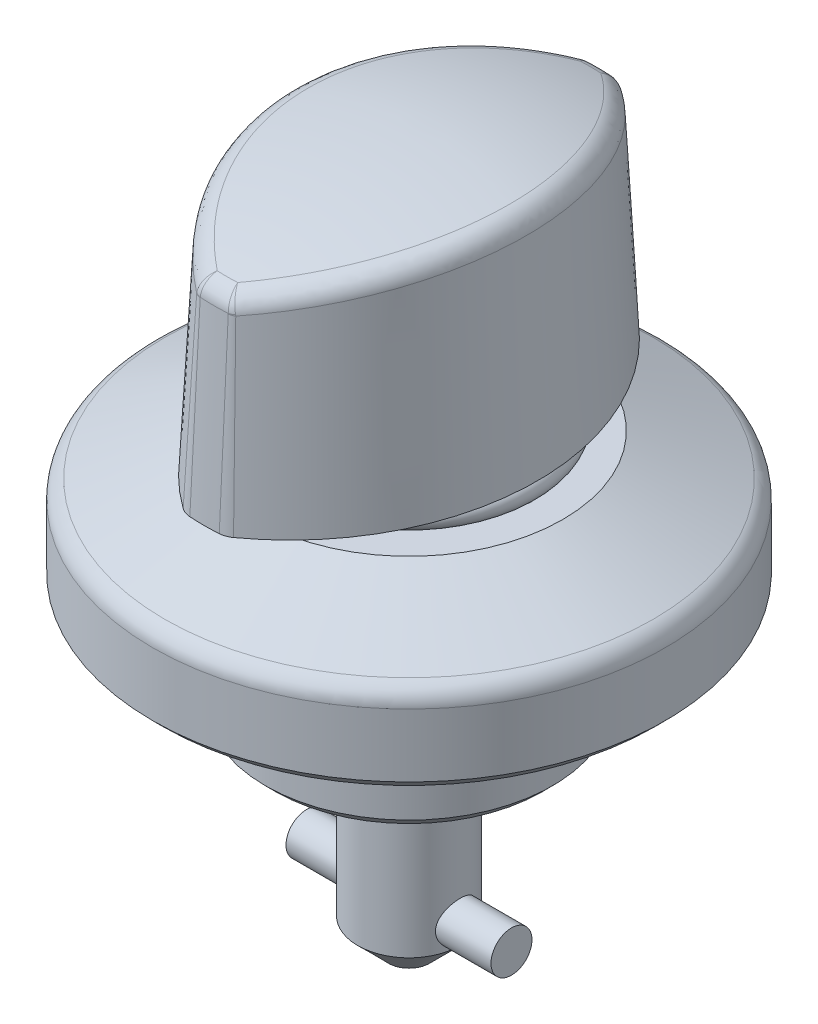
ISO-10303-21;
HEADER;
FILE_DESCRIPTION(('STEP AP214'),'2;1');
FILE_NAME('part.step','',(''),(''),'','','');
FILE_SCHEMA(('AUTOMOTIVE_DESIGN { 1 0 10303 214 1 1 1 1 }'));
ENDSEC;
DATA;
#1=APPLICATION_CONTEXT('core data for automotive mechanical design processes');
#2=APPLICATION_PROTOCOL_DEFINITION('international standard','automotive_design',2000,#1);
#3=PRODUCT_CONTEXT('',#1,'mechanical');
#4=PRODUCT('Part','Part','',(#3));
#5=PRODUCT_RELATED_PRODUCT_CATEGORY('part','',(#4));
#6=PRODUCT_DEFINITION_FORMATION('','',#4);
#7=PRODUCT_DEFINITION_CONTEXT('part definition',#1,'design');
#8=PRODUCT_DEFINITION('design','',#6,#7);
#9=PRODUCT_DEFINITION_SHAPE('','',#8);
#10=(LENGTH_UNIT() NAMED_UNIT(*) SI_UNIT(.MILLI.,.METRE.));
#11=(NAMED_UNIT(*) PLANE_ANGLE_UNIT() SI_UNIT($,.RADIAN.));
#12=(NAMED_UNIT(*) SI_UNIT($,.STERADIAN.) SOLID_ANGLE_UNIT());
#13=UNCERTAINTY_MEASURE_WITH_UNIT(LENGTH_MEASURE(1.E-05),#10,'distance_accuracy_value','');
#14=(GEOMETRIC_REPRESENTATION_CONTEXT(3) GLOBAL_UNCERTAINTY_ASSIGNED_CONTEXT((#13)) GLOBAL_UNIT_ASSIGNED_CONTEXT((#10,
#11,#12)) REPRESENTATION_CONTEXT('',''));
#15=CARTESIAN_POINT('',(0.,0.,0.));
#16=DIRECTION('',(0.,0.,1.));
#17=DIRECTION('',(1.,0.,0.));
#18=AXIS2_PLACEMENT_3D('',#15,#16,#17);
#19=CARTESIAN_POINT('',(0.,-10.,0.));
#20=DIRECTION('',(0.,-1.,0.));
#21=DIRECTION('',(0.,0.,-1.));
#22=AXIS2_PLACEMENT_3D('',#19,#20,#21);
#23=PLANE('',#22);
#24=CARTESIAN_POINT('',(0.,-10.,0.));
#25=DIRECTION('',(0.,-1.,0.));
#26=DIRECTION('',(0.,0.,-1.));
#27=AXIS2_PLACEMENT_3D('',#24,#25,#26);
#28=CIRCLE('',#27,1.);
#29=CARTESIAN_POINT('',(0.,-10.,-1.));
#30=VERTEX_POINT('',#29);
#31=EDGE_CURVE('P0_E41',#30,#30,#28,.T.);
#32=ORIENTED_EDGE('',*,*,#31,.T.);
#33=EDGE_LOOP('',(#32));
#34=FACE_BOUND('',#33,.T.);
#35=ADVANCED_FACE('P0_F16',(#34),#23,.T.);
#36=CARTESIAN_POINT('',(0.,-10.,0.));
#37=DIRECTION('',(0.,1.,0.));
#38=DIRECTION('',(0.,0.,1.));
#39=AXIS2_PLACEMENT_3D('',#36,#37,#38);
#40=CONICAL_SURFACE('',#39,1.,0.78539816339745);
#41=CARTESIAN_POINT('',(0.,-8.50000000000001,0.));
#42=DIRECTION('',(0.,-1.,0.));
#43=DIRECTION('',(0.,0.,-1.));
#44=AXIS2_PLACEMENT_3D('',#41,#42,#43);
#45=CIRCLE('',#44,2.5);
#46=CARTESIAN_POINT('',(2.50000000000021,-8.50000000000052,0.));
#47=VERTEX_POINT('',#46);
#48=CARTESIAN_POINT('',(-2.5,-8.50000000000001,0.));
#49=VERTEX_POINT('',#48);
#50=EDGE_CURVE('P0_E34',#47,#49,#45,.T.);
#51=ORIENTED_EDGE('',*,*,#50,.T.);
#52=EDGE_CURVE('P0_E40',#49,#47,#45,.T.);
#53=ORIENTED_EDGE('',*,*,#52,.T.);
#54=EDGE_LOOP('',(#51,#53));
#55=FACE_BOUND('',#54,.T.);
#56=ORIENTED_EDGE('',*,*,#31,.F.);
#57=EDGE_LOOP('',(#56));
#58=FACE_BOUND('',#57,.T.);
#59=ADVANCED_FACE('P0_F38',(#55,#58),#40,.T.);
#60=CARTESIAN_POINT('',(0.,-10.,0.));
#61=DIRECTION('',(0.,-1.,0.));
#62=DIRECTION('',(0.,0.,-1.));
#63=AXIS2_PLACEMENT_3D('',#60,#61,#62);
#64=CYLINDRICAL_SURFACE('',#63,2.5);
#65=CARTESIAN_POINT('',(0.,0.,0.));
#66=DIRECTION('',(0.,-1.,0.));
#67=DIRECTION('',(0.,0.,-1.));
#68=AXIS2_PLACEMENT_3D('',#65,#66,#67);
#69=CIRCLE('',#68,2.5);
#70=CARTESIAN_POINT('',(0.,0.,-2.5));
#71=VERTEX_POINT('',#70);
#72=EDGE_CURVE('P0_E45',#71,#71,#69,.T.);
#73=ORIENTED_EDGE('',*,*,#72,.T.);
#74=EDGE_LOOP('',(#73));
#75=FACE_BOUND('',#74,.T.);
#76=ORIENTED_EDGE('',*,*,#50,.F.);
#77=CARTESIAN_POINT('',(2.29128784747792,-7.50000000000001,1.));
#78=CARTESIAN_POINT('',(2.29129325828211,-7.55356974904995,0.999994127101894));
#79=CARTESIAN_POINT('',(2.29319301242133,-7.60721526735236,0.995669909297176));
#80=CARTESIAN_POINT('',(2.30055457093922,-7.71296741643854,0.978534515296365));
#81=CARTESIAN_POINT('',(2.30602547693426,-7.76506975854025,0.965701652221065));
#82=CARTESIAN_POINT('',(2.31980227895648,-7.86602647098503,0.932117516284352));
#83=CARTESIAN_POINT('',(2.32809748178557,-7.91489227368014,0.911396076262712));
#84=CARTESIAN_POINT('',(2.3465733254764,-8.00844252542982,0.862710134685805));
#85=CARTESIAN_POINT('',(2.35675355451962,-8.05312788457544,0.83474721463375));
#86=CARTESIAN_POINT('',(2.37850432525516,-8.13963020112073,0.77066098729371));
#87=CARTESIAN_POINT('',(2.39011958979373,-8.18117821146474,0.734189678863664));
#88=CARTESIAN_POINT('',(2.41306228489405,-8.25776449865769,0.654854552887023));
#89=CARTESIAN_POINT('',(2.42438961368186,-8.29280050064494,0.611988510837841));
#90=CARTESIAN_POINT('',(2.44601703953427,-8.35670319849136,0.519003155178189));
#91=CARTESIAN_POINT('',(2.45625901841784,-8.38527215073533,0.468664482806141));
#92=CARTESIAN_POINT('',(2.47401963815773,-8.43342178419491,0.36341266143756));
#93=CARTESIAN_POINT('',(2.48153938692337,-8.45300612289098,0.308501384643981));
#94=CARTESIAN_POINT('',(2.49269162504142,-8.48167074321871,0.198483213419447));
#95=CARTESIAN_POINT('',(2.49649468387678,-8.49121365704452,0.143514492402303));
#96=CARTESIAN_POINT('',(2.50040155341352,-8.50101424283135,0.0326331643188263));
#97=CARTESIAN_POINT('',(2.50050674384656,-8.50127537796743,-0.0232790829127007));
#98=CARTESIAN_POINT('',(2.49710981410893,-8.49275861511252,-0.131116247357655));
#99=CARTESIAN_POINT('',(2.49380998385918,-8.48448761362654,-0.183088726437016));
#100=CARTESIAN_POINT('',(2.48424645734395,-8.46000356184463,-0.284836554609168));
#101=CARTESIAN_POINT('',(2.47798254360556,-8.44378992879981,-0.334611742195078));
#102=CARTESIAN_POINT('',(2.4629841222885,-8.40368175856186,-0.431448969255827));
#103=CARTESIAN_POINT('',(2.454213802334,-8.37967514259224,-0.478458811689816));
#104=CARTESIAN_POINT('',(2.43507292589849,-8.3247674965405,-0.567904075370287));
#105=CARTESIAN_POINT('',(2.42470182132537,-8.2938641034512,-0.610337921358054));
#106=CARTESIAN_POINT('',(2.40260818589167,-8.22367543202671,-0.692384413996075));
#107=CARTESIAN_POINT('',(2.3908416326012,-8.18397305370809,-0.73162892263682));
#108=CARTESIAN_POINT('',(2.36780830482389,-8.09850471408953,-0.803053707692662));
#109=CARTESIAN_POINT('',(2.35654169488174,-8.05273677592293,-0.835231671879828));
#110=CARTESIAN_POINT('',(2.33548448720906,-7.95479048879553,-0.892452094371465));
#111=CARTESIAN_POINT('',(2.3257445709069,-7.9024675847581,-0.917267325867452));
#112=CARTESIAN_POINT('',(2.30943795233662,-7.793892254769,-0.957588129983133));
#113=CARTESIAN_POINT('',(2.3028691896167,-7.73764240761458,-0.973099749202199));
#114=CARTESIAN_POINT('',(2.29414879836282,-7.62648211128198,-0.993477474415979));
#115=CARTESIAN_POINT('',(2.29175183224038,-7.57169977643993,-0.998936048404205));
#116=CARTESIAN_POINT('',(2.29094748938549,-7.46196139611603,-1.00078066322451));
#117=CARTESIAN_POINT('',(2.29253890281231,-7.40700540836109,-0.997169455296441));
#118=CARTESIAN_POINT('',(2.29928022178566,-7.30177053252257,-0.981516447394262));
#119=CARTESIAN_POINT('',(2.30422228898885,-7.25140353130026,-0.969966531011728));
#120=CARTESIAN_POINT('',(2.31685025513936,-7.153355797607,-0.939402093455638));
#121=CARTESIAN_POINT('',(2.32453676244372,-7.10567566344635,-0.920385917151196));
#122=CARTESIAN_POINT('',(2.34216890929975,-7.01219882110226,-0.874567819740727));
#123=CARTESIAN_POINT('',(2.35219352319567,-6.96655690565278,-0.847481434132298));
#124=CARTESIAN_POINT('',(2.37325192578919,-6.88025850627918,-0.786582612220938));
#125=CARTESIAN_POINT('',(2.38428612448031,-6.83960406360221,-0.752767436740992));
#126=CARTESIAN_POINT('',(2.40710457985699,-6.7613132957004,-0.676422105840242));
#127=CARTESIAN_POINT('',(2.41888403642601,-6.72412171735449,-0.63343271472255));
#128=CARTESIAN_POINT('',(2.44109897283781,-6.65741146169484,-0.541541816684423));
#129=CARTESIAN_POINT('',(2.4515343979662,-6.62789309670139,-0.492640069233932));
#130=CARTESIAN_POINT('',(2.46991857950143,-6.57747618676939,-0.390139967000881));
#131=CARTESIAN_POINT('',(2.47786793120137,-6.55657557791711,-0.336542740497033));
#132=CARTESIAN_POINT('',(2.49036356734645,-6.52422557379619,-0.226196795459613));
#133=CARTESIAN_POINT('',(2.49491169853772,-6.51277104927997,-0.169449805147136));
#134=CARTESIAN_POINT('',(2.49989504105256,-6.50024764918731,-0.0584082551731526));
#135=CARTESIAN_POINT('',(2.50057923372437,-6.49854993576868,-0.00419524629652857));
#136=CARTESIAN_POINT('',(2.49843021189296,-6.50392773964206,0.103716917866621));
#137=CARTESIAN_POINT('',(2.49559752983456,-6.51100192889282,0.15741614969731));
#138=CARTESIAN_POINT('',(2.48685756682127,-6.53327339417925,0.261085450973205));
#139=CARTESIAN_POINT('',(2.48104740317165,-6.54821447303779,0.311119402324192));
#140=CARTESIAN_POINT('',(2.46697473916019,-6.58552640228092,0.407961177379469));
#141=CARTESIAN_POINT('',(2.45871178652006,-6.60789862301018,0.454768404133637));
#142=CARTESIAN_POINT('',(2.44009047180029,-6.66055159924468,0.546101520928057));
#143=CARTESIAN_POINT('',(2.42965564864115,-6.69113814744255,0.590435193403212));
#144=CARTESIAN_POINT('',(2.40794701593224,-6.75889425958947,0.673527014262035));
#145=CARTESIAN_POINT('',(2.3966728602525,-6.79606654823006,0.712282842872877));
#146=CARTESIAN_POINT('',(2.37368881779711,-6.87865761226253,0.785600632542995));
#147=CARTESIAN_POINT('',(2.36199516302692,-6.92444443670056,0.819754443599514));
#148=CARTESIAN_POINT('',(2.3402483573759,-7.02147106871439,0.879923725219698));
#149=CARTESIAN_POINT('',(2.33019539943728,-7.07271151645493,0.905938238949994));
#150=CARTESIAN_POINT('',(2.31379432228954,-7.17451860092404,0.946995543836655));
#151=CARTESIAN_POINT('',(2.30719459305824,-7.22473261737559,0.962813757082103));
#152=CARTESIAN_POINT('',(2.29723001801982,-7.32724270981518,0.986358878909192));
#153=CARTESIAN_POINT('',(2.29385616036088,-7.37953255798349,0.994108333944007));
#154=CARTESIAN_POINT('',(2.29162229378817,-7.45468878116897,0.999232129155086));
#155=CARTESIAN_POINT('',(2.29128555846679,-7.47733761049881,1.00000248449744));
#156=CARTESIAN_POINT('',(2.29128784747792,-7.50000000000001,1.));
#157=B_SPLINE_CURVE_WITH_KNOTS('',3,(#77,#78,#79,#80,#81,#82,#83,#84,#85,#86,#87,#88,#89,#90,
#91,#92,#93,#94,#95,#96,#97,#98,#99,#100,#101,#102,#103,#104,#105,#106,#107,#108,#109,#110,#111,
#112,#113,#114,#115,#116,#117,#118,#119,#120,#121,#122,#123,#124,#125,#126,#127,#128,#129,#130,
#131,#132,#133,#134,#135,#136,#137,#138,#139,#140,#141,#142,#143,#144,#145,#146,#147,#148,#149,
#150,#151,#152,#153,#154,#155,#156),.UNSPECIFIED.,.T.,.F.,(4,2,2,2,2,2,2,2,2,2,2,2,2,2,2,2,2,2,
2,2,2,2,2,2,2,2,2,2,2,2,2,2,2,2,2,2,2,2,2,4),(0.,0.160638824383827,0.321688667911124,
0.482135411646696,0.642547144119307,0.811278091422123,0.980067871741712,1.15551334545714,
1.3308873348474,1.49777091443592,1.66459222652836,1.82204322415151,1.9795057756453,
2.13934150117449,2.29923207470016,2.46962022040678,2.64006403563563,2.81532229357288,
2.99046652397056,3.15491073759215,3.31930507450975,3.47433624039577,3.62940179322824,
3.79075577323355,3.95217557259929,4.12551867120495,4.29886882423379,4.47217743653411,
4.64539187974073,4.80730519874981,4.96919400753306,5.12610997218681,5.28305488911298,
5.44693525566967,5.61088358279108,5.78498126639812,5.95909940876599,6.11758330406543,
6.27562315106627,6.34358052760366),.UNSPECIFIED.);
#158=EDGE_CURVE('P0_E11',#47,#47,#157,.T.);
#159=ORIENTED_EDGE('',*,*,#158,.F.);
#160=ORIENTED_EDGE('',*,*,#52,.F.);
#161=CARTESIAN_POINT('',(-2.29128784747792,-7.50000000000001,1.));
#162=CARTESIAN_POINT('',(-2.29129325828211,-7.44643025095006,0.999994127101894));
#163=CARTESIAN_POINT('',(-2.29319301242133,-7.39278473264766,0.995669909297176));
#164=CARTESIAN_POINT('',(-2.30055457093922,-7.28703258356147,0.978534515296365));
#165=CARTESIAN_POINT('',(-2.30602547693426,-7.23493024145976,0.965701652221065));
#166=CARTESIAN_POINT('',(-2.31980227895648,-7.13397352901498,0.932117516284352));
#167=CARTESIAN_POINT('',(-2.32809748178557,-7.08510772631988,0.911396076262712));
#168=CARTESIAN_POINT('',(-2.3465733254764,-6.9915574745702,0.862710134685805));
#169=CARTESIAN_POINT('',(-2.35675355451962,-6.94687211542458,0.83474721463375));
#170=CARTESIAN_POINT('',(-2.37850432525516,-6.86036979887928,0.77066098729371));
#171=CARTESIAN_POINT('',(-2.39011958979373,-6.81882178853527,0.734189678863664));
#172=CARTESIAN_POINT('',(-2.41306228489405,-6.74223550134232,0.654854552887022));
#173=CARTESIAN_POINT('',(-2.42438961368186,-6.70719949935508,0.61198851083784));
#174=CARTESIAN_POINT('',(-2.44601703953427,-6.64329680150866,0.519003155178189));
#175=CARTESIAN_POINT('',(-2.45625901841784,-6.61472784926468,0.468664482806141));
#176=CARTESIAN_POINT('',(-2.47401963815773,-6.5665782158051,0.36341266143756));
#177=CARTESIAN_POINT('',(-2.48153938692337,-6.54699387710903,0.308501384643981));
#178=CARTESIAN_POINT('',(-2.49269162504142,-6.51832925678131,0.198483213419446));
#179=CARTESIAN_POINT('',(-2.49649468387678,-6.5087863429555,0.143514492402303));
#180=CARTESIAN_POINT('',(-2.50040155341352,-6.49898575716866,0.0326331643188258));
#181=CARTESIAN_POINT('',(-2.50050674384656,-6.49872462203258,-0.0232790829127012));
#182=CARTESIAN_POINT('',(-2.49710981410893,-6.5072413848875,-0.131116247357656));
#183=CARTESIAN_POINT('',(-2.49380998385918,-6.51551238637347,-0.183088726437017));
#184=CARTESIAN_POINT('',(-2.48424645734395,-6.53999643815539,-0.284836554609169));
#185=CARTESIAN_POINT('',(-2.47798254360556,-6.5562100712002,-0.334611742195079));
#186=CARTESIAN_POINT('',(-2.4629841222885,-6.59631824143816,-0.431448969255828));
#187=CARTESIAN_POINT('',(-2.454213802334,-6.62032485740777,-0.478458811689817));
#188=CARTESIAN_POINT('',(-2.43507292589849,-6.67523250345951,-0.567904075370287));
#189=CARTESIAN_POINT('',(-2.42470182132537,-6.70613589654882,-0.610337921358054));
#190=CARTESIAN_POINT('',(-2.40260818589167,-6.7763245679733,-0.692384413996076));
#191=CARTESIAN_POINT('',(-2.3908416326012,-6.81602694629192,-0.731628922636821));
#192=CARTESIAN_POINT('',(-2.36780830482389,-6.90149528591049,-0.803053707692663));
#193=CARTESIAN_POINT('',(-2.35654169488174,-6.94726322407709,-0.835231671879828));
#194=CARTESIAN_POINT('',(-2.33548448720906,-7.04520951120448,-0.892452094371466));
#195=CARTESIAN_POINT('',(-2.3257445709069,-7.09753241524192,-0.917267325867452));
#196=CARTESIAN_POINT('',(-2.30943795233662,-7.20610774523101,-0.957588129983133));
#197=CARTESIAN_POINT('',(-2.3028691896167,-7.26235759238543,-0.973099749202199));
#198=CARTESIAN_POINT('',(-2.29414879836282,-7.37351788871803,-0.993477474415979));
#199=CARTESIAN_POINT('',(-2.29175183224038,-7.42830022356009,-0.998936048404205));
#200=CARTESIAN_POINT('',(-2.29094748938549,-7.53803860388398,-1.00078066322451));
#201=CARTESIAN_POINT('',(-2.29253890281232,-7.59299459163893,-0.997169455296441));
#202=CARTESIAN_POINT('',(-2.29928022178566,-7.69822946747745,-0.981516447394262));
#203=CARTESIAN_POINT('',(-2.30422228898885,-7.74859646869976,-0.969966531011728));
#204=CARTESIAN_POINT('',(-2.31685025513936,-7.84664420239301,-0.939402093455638));
#205=CARTESIAN_POINT('',(-2.32453676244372,-7.89432433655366,-0.920385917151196));
#206=CARTESIAN_POINT('',(-2.34216890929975,-7.98780117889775,-0.874567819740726));
#207=CARTESIAN_POINT('',(-2.35219352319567,-8.03344309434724,-0.847481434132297));
#208=CARTESIAN_POINT('',(-2.37325192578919,-8.11974149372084,-0.786582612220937));
#209=CARTESIAN_POINT('',(-2.38428612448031,-8.1603959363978,-0.752767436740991));
#210=CARTESIAN_POINT('',(-2.40710457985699,-8.23868670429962,-0.676422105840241));
#211=CARTESIAN_POINT('',(-2.41888403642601,-8.27587828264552,-0.633432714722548));
#212=CARTESIAN_POINT('',(-2.44109897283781,-8.34258853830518,-0.54154181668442));
#213=CARTESIAN_POINT('',(-2.4515343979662,-8.37210690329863,-0.492640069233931));
#214=CARTESIAN_POINT('',(-2.46991857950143,-8.42252381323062,-0.39013996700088));
#215=CARTESIAN_POINT('',(-2.47786793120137,-8.4434244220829,-0.336542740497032));
#216=CARTESIAN_POINT('',(-2.49036356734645,-8.47577442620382,-0.226196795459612));
#217=CARTESIAN_POINT('',(-2.49491169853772,-8.48722895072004,-0.169449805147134));
#218=CARTESIAN_POINT('',(-2.49989504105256,-8.4997523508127,-0.0584082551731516));
#219=CARTESIAN_POINT('',(-2.50057923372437,-8.50145006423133,-0.00419524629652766));
#220=CARTESIAN_POINT('',(-2.49843021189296,-8.49607226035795,0.103716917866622));
#221=CARTESIAN_POINT('',(-2.49559752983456,-8.4889980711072,0.157416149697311));
#222=CARTESIAN_POINT('',(-2.48685756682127,-8.46672660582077,0.261085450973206));
#223=CARTESIAN_POINT('',(-2.48104740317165,-8.45178552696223,0.311119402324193));
#224=CARTESIAN_POINT('',(-2.46697473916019,-8.41447359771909,0.40796117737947));
#225=CARTESIAN_POINT('',(-2.45871178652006,-8.39210137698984,0.454768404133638));
#226=CARTESIAN_POINT('',(-2.44009047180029,-8.33944840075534,0.546101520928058));
#227=CARTESIAN_POINT('',(-2.42965564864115,-8.30886185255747,0.590435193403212));
#228=CARTESIAN_POINT('',(-2.40794701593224,-8.24110574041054,0.673527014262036));
#229=CARTESIAN_POINT('',(-2.3966728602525,-8.20393345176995,0.712282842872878));
#230=CARTESIAN_POINT('',(-2.37368881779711,-8.12134238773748,0.785600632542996));
#231=CARTESIAN_POINT('',(-2.36199516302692,-8.07555556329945,0.819754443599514));
#232=CARTESIAN_POINT('',(-2.3402483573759,-7.97852893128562,0.879923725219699));
#233=CARTESIAN_POINT('',(-2.33019539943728,-7.92728848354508,0.905938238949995));
#234=CARTESIAN_POINT('',(-2.31379432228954,-7.82548139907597,0.946995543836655));
#235=CARTESIAN_POINT('',(-2.30719459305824,-7.77526738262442,0.962813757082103));
#236=CARTESIAN_POINT('',(-2.29723001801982,-7.67275729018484,0.986358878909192));
#237=CARTESIAN_POINT('',(-2.29385616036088,-7.62046744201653,0.994108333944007));
#238=CARTESIAN_POINT('',(-2.29162229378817,-7.54531121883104,0.999232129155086));
#239=CARTESIAN_POINT('',(-2.29128555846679,-7.52266238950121,1.00000248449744));
#240=CARTESIAN_POINT('',(-2.29128784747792,-7.50000000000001,1.));
#241=B_SPLINE_CURVE_WITH_KNOTS('',3,(#161,#162,#163,#164,#165,#166,#167,#168,#169,#170,#171,
#172,#173,#174,#175,#176,#177,#178,#179,#180,#181,#182,#183,#184,#185,#186,#187,#188,#189,#190,
#191,#192,#193,#194,#195,#196,#197,#198,#199,#200,#201,#202,#203,#204,#205,#206,#207,#208,#209,
#210,#211,#212,#213,#214,#215,#216,#217,#218,#219,#220,#221,#222,#223,#224,#225,#226,#227,#228,
#229,#230,#231,#232,#233,#234,#235,#236,#237,#238,#239,#240),.UNSPECIFIED.,.T.,.F.,(4,2,2,2,2,2,
2,2,2,2,2,2,2,2,2,2,2,2,2,2,2,2,2,2,2,2,2,2,2,2,2,2,2,2,2,2,2,2,2,4),(0.,0.160638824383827,
0.321688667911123,0.482135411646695,0.642547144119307,0.811278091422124,0.980067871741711,
1.15551334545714,1.3308873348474,1.49777091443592,1.66459222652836,1.82204322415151,
1.9795057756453,2.13934150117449,2.29923207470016,2.46962022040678,2.64006403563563,
2.81532229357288,2.99046652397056,3.15491073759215,3.31930507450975,3.47433624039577,
3.62940179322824,3.79075577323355,3.9521755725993,4.12551867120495,4.29886882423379,
4.47217743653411,4.64539187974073,4.80730519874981,4.96919400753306,5.12610997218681,
5.28305488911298,5.44693525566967,5.61088358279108,5.78498126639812,5.95909940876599,
6.11758330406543,6.27562315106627,6.34358052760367),.UNSPECIFIED.);
#242=EDGE_CURVE('P0_E27',#49,#49,#241,.T.);
#243=ORIENTED_EDGE('',*,*,#242,.F.);
#244=EDGE_LOOP('',(#76,#159,#160,#243));
#245=FACE_BOUND('',#244,.T.);
#246=ADVANCED_FACE('P0_F43',(#75,#245),#64,.T.);
#247=CARTESIAN_POINT('',(2.5,0.,0.));
#248=DIRECTION('',(0.,1.,0.));
#249=DIRECTION('',(0.,0.,1.));
#250=AXIS2_PLACEMENT_3D('',#247,#248,#249);
#251=PLANE('',#250);
#252=CARTESIAN_POINT('',(0.,0.,0.));
#253=DIRECTION('',(0.,-1.,0.));
#254=DIRECTION('',(0.,0.,-1.));
#255=AXIS2_PLACEMENT_3D('',#252,#253,#254);
#256=CIRCLE('',#255,2.);
#257=CARTESIAN_POINT('',(0.,0.,-2.));
#258=VERTEX_POINT('',#257);
#259=EDGE_CURVE('P0_E47',#258,#258,#256,.T.);
#260=ORIENTED_EDGE('',*,*,#259,.T.);
#261=EDGE_LOOP('',(#260));
#262=FACE_BOUND('',#261,.T.);
#263=ORIENTED_EDGE('',*,*,#72,.F.);
#264=EDGE_LOOP('',(#263));
#265=FACE_BOUND('',#264,.T.);
#266=ADVANCED_FACE('P0_F79',(#262,#265),#251,.T.);
#267=CARTESIAN_POINT('',(0.,-10.,0.));
#268=DIRECTION('',(0.,-1.,0.));
#269=DIRECTION('',(0.,0.,-1.));
#270=AXIS2_PLACEMENT_3D('',#267,#268,#269);
#271=CYLINDRICAL_SURFACE('',#270,2.);
#272=CARTESIAN_POINT('',(0.,17.5,0.));
#273=DIRECTION('',(0.,-1.,0.));
#274=DIRECTION('',(0.,0.,-1.));
#275=AXIS2_PLACEMENT_3D('',#272,#273,#274);
#276=CIRCLE('',#275,2.);
#277=CARTESIAN_POINT('',(0.,17.5,-2.));
#278=VERTEX_POINT('',#277);
#279=EDGE_CURVE('P0_E155',#278,#278,#276,.T.);
#280=ORIENTED_EDGE('',*,*,#279,.T.);
#281=EDGE_LOOP('',(#280));
#282=FACE_BOUND('',#281,.T.);
#283=ORIENTED_EDGE('',*,*,#259,.F.);
#284=EDGE_LOOP('',(#283));
#285=FACE_BOUND('',#284,.T.);
#286=ADVANCED_FACE('P0_F76',(#282,#285),#271,.T.);
#287=CARTESIAN_POINT('',(0.,17.5,0.));
#288=DIRECTION('',(0.,-1.,0.));
#289=DIRECTION('',(0.,0.,-1.));
#290=AXIS2_PLACEMENT_3D('',#287,#288,#289);
#291=CONICAL_SURFACE('',#290,2.,0.785398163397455);
#292=CARTESIAN_POINT('',(0.,18.,0.));
#293=DIRECTION('',(0.,-1.,0.));
#294=DIRECTION('',(0.,0.,-1.));
#295=AXIS2_PLACEMENT_3D('',#292,#293,#294);
#296=CIRCLE('',#295,1.5);
#297=CARTESIAN_POINT('',(0.,18.,-1.5));
#298=VERTEX_POINT('',#297);
#299=EDGE_CURVE('P0_E150',#298,#298,#296,.T.);
#300=ORIENTED_EDGE('',*,*,#299,.T.);
#301=EDGE_LOOP('',(#300));
#302=FACE_BOUND('',#301,.T.);
#303=ORIENTED_EDGE('',*,*,#279,.F.);
#304=EDGE_LOOP('',(#303));
#305=FACE_BOUND('',#304,.T.);
#306=ADVANCED_FACE('P0_F72',(#302,#305),#291,.T.);
#307=CARTESIAN_POINT('',(1.5,18.,0.));
#308=DIRECTION('',(0.,1.,0.));
#309=DIRECTION('',(0.,0.,1.));
#310=AXIS2_PLACEMENT_3D('',#307,#308,#309);
#311=PLANE('',#310);
#312=ORIENTED_EDGE('',*,*,#299,.F.);
#313=EDGE_LOOP('',(#312));
#314=FACE_BOUND('',#313,.T.);
#315=ADVANCED_FACE('P0_F68',(#314),#311,.T.);
#316=CARTESIAN_POINT('',(-5.,-7.50000000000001,0.));
#317=DIRECTION('',(-1.,0.,0.));
#318=DIRECTION('',(0.,0.,1.));
#319=AXIS2_PLACEMENT_3D('',#316,#317,#318);
#320=PLANE('',#319);
#321=CARTESIAN_POINT('',(-5.,-7.50000000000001,0.));
#322=DIRECTION('',(-1.,0.,0.));
#323=DIRECTION('',(0.,0.,1.));
#324=AXIS2_PLACEMENT_3D('',#321,#322,#323);
#325=CIRCLE('',#324,1.);
#326=CARTESIAN_POINT('',(-5.,-7.50000000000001,1.));
#327=VERTEX_POINT('',#326);
#328=EDGE_CURVE('P0_E147',#327,#327,#325,.T.);
#329=ORIENTED_EDGE('',*,*,#328,.T.);
#330=EDGE_LOOP('',(#329));
#331=FACE_BOUND('',#330,.T.);
#332=ADVANCED_FACE('P0_F62',(#331),#320,.T.);
#333=CARTESIAN_POINT('',(-5.26029262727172,-7.50000000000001,0.));
#334=DIRECTION('',(-1.,0.,0.));
#335=DIRECTION('',(0.,0.,1.));
#336=AXIS2_PLACEMENT_3D('',#333,#334,#335);
#337=CYLINDRICAL_SURFACE('',#336,1.);
#338=ORIENTED_EDGE('',*,*,#242,.T.);
#339=EDGE_LOOP('',(#338));
#340=FACE_BOUND('',#339,.T.);
#341=ORIENTED_EDGE('',*,*,#328,.F.);
#342=EDGE_LOOP('',(#341));
#343=FACE_BOUND('',#342,.T.);
#344=ADVANCED_FACE('P0_F56',(#340,#343),#337,.T.);
#345=ORIENTED_EDGE('',*,*,#158,.T.);
#346=EDGE_LOOP('',(#345));
#347=FACE_BOUND('',#346,.T.);
#348=CARTESIAN_POINT('',(5.,-7.50000000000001,0.));
#349=DIRECTION('',(-1.,0.,0.));
#350=DIRECTION('',(0.,0.,1.));
#351=AXIS2_PLACEMENT_3D('',#348,#349,#350);
#352=CIRCLE('',#351,1.);
#353=CARTESIAN_POINT('',(5.,-7.50000000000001,1.));
#354=VERTEX_POINT('',#353);
#355=EDGE_CURVE('P0_E145',#354,#354,#352,.T.);
#356=ORIENTED_EDGE('',*,*,#355,.T.);
#357=EDGE_LOOP('',(#356));
#358=FACE_BOUND('',#357,.T.);
#359=ADVANCED_FACE('P0_F61',(#347,#358),#337,.T.);
#360=CARTESIAN_POINT('',(5.,-8.50000000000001,0.));
#361=DIRECTION('',(1.,0.,0.));
#362=DIRECTION('',(0.,0.,-1.));
#363=AXIS2_PLACEMENT_3D('',#360,#361,#362);
#364=PLANE('',#363);
#365=ORIENTED_EDGE('',*,*,#355,.F.);
#366=EDGE_LOOP('',(#365));
#367=FACE_BOUND('',#366,.T.);
#368=ADVANCED_FACE('P0_F64',(#367),#364,.T.);
#369=CLOSED_SHELL('',(#35,#59,#246,#266,#286,#306,#315,#332,#344,#359,#368));
#370=MANIFOLD_SOLID_BREP('P0_B1',#369);
#371=CARTESIAN_POINT('',(10.,13.,0.));
#372=DIRECTION('',(0.,-1.,0.));
#373=DIRECTION('',(0.,0.,-1.));
#374=AXIS2_PLACEMENT_3D('',#371,#372,#373);
#375=PLANE('',#374);
#376=CARTESIAN_POINT('',(0.,13.,0.));
#377=DIRECTION('',(0.,-1.,0.));
#378=DIRECTION('',(0.,0.,-1.));
#379=AXIS2_PLACEMENT_3D('',#376,#377,#378);
#380=CIRCLE('',#379,2.);
#381=CARTESIAN_POINT('',(0.,13.,-2.));
#382=VERTEX_POINT('',#381);
#383=EDGE_CURVE('P1_E678',#382,#382,#380,.T.);
#384=ORIENTED_EDGE('',*,*,#383,.F.);
#385=EDGE_LOOP('',(#384));
#386=FACE_BOUND('',#385,.T.);
#387=CARTESIAN_POINT('',(-5.80357142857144,13.,0.));
#388=DIRECTION('',(0.,-1.,0.));
#389=DIRECTION('',(0.,0.,1.));
#390=AXIS2_PLACEMENT_3D('',#387,#388,#389);
#391=CIRCLE('',#390,12.0535714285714);
#392=CARTESIAN_POINT('',(1.22965080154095,13.,-9.78889009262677));
#393=VERTEX_POINT('',#392);
#394=CARTESIAN_POINT('',(1.22965080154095,13.,9.78889009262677));
#395=VERTEX_POINT('',#394);
#396=EDGE_CURVE('P1_E758',#393,#395,#391,.T.);
#397=ORIENTED_EDGE('',*,*,#396,.T.);
#398=CARTESIAN_POINT('',(0.646153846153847,13.,8.97677476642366));
#399=DIRECTION('',(0.,-1.,0.));
#400=DIRECTION('',(0.,0.,-1.));
#401=AXIS2_PLACEMENT_3D('',#398,#399,#400);
#402=CIRCLE('',#401,1.);
#403=CARTESIAN_POINT('',(0.717948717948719,13.,9.97419418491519));
#404=VERTEX_POINT('',#403);
#405=EDGE_CURVE('P1_E76',#395,#404,#402,.T.);
#406=ORIENTED_EDGE('',*,*,#405,.T.);
#407=CARTESIAN_POINT('',(0.,13.,0.));
#408=DIRECTION('',(0.,-1.,0.));
#409=DIRECTION('',(0.,0.,-1.));
#410=AXIS2_PLACEMENT_3D('',#407,#408,#409);
#411=CIRCLE('',#410,10.);
#412=CARTESIAN_POINT('',(-0.717948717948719,13.,9.97419418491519));
#413=VERTEX_POINT('',#412);
#414=EDGE_CURVE('P1_E691',#404,#413,#411,.T.);
#415=ORIENTED_EDGE('',*,*,#414,.T.);
#416=CARTESIAN_POINT('',(-0.646153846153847,13.,8.97677476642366));
#417=DIRECTION('',(0.,-1.,0.));
#418=DIRECTION('',(0.,0.,-1.));
#419=AXIS2_PLACEMENT_3D('',#416,#417,#418);
#420=CIRCLE('',#419,1.);
#421=CARTESIAN_POINT('',(-1.22965080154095,13.,9.78889009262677));
#422=VERTEX_POINT('',#421);
#423=EDGE_CURVE('P1_E686',#413,#422,#420,.T.);
#424=ORIENTED_EDGE('',*,*,#423,.T.);
#425=CARTESIAN_POINT('',(5.80357142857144,13.,0.));
#426=DIRECTION('',(0.,-1.,0.));
#427=DIRECTION('',(0.,0.,-1.));
#428=AXIS2_PLACEMENT_3D('',#425,#426,#427);
#429=CIRCLE('',#428,12.0535714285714);
#430=CARTESIAN_POINT('',(-1.22965080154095,13.,-9.78889009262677));
#431=VERTEX_POINT('',#430);
#432=EDGE_CURVE('P1_E697',#422,#431,#429,.T.);
#433=ORIENTED_EDGE('',*,*,#432,.T.);
#434=CARTESIAN_POINT('',(-0.646153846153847,13.,-8.97677476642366));
#435=DIRECTION('',(0.,-1.,0.));
#436=DIRECTION('',(0.,0.,-1.));
#437=AXIS2_PLACEMENT_3D('',#434,#435,#436);
#438=CIRCLE('',#437,1.);
#439=CARTESIAN_POINT('',(-0.717948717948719,13.,-9.97419418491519));
#440=VERTEX_POINT('',#439);
#441=EDGE_CURVE('P1_E705',#431,#440,#438,.T.);
#442=ORIENTED_EDGE('',*,*,#441,.T.);
#443=CARTESIAN_POINT('',(0.717948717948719,13.,-9.97419418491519));
#444=VERTEX_POINT('',#443);
#445=EDGE_CURVE('P1_E603',#440,#444,#411,.T.);
#446=ORIENTED_EDGE('',*,*,#445,.T.);
#447=CARTESIAN_POINT('',(0.646153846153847,13.,-8.97677476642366));
#448=DIRECTION('',(0.,-1.,0.));
#449=DIRECTION('',(0.,0.,-1.));
#450=AXIS2_PLACEMENT_3D('',#447,#448,#449);
#451=CIRCLE('',#450,1.);
#452=EDGE_CURVE('P1_E689',#444,#393,#451,.T.);
#453=ORIENTED_EDGE('',*,*,#452,.T.);
#454=EDGE_LOOP('',(#397,#406,#415,#424,#433,#442,#446,#453));
#455=FACE_BOUND('',#454,.T.);
#456=ADVANCED_FACE('P1_F16',(#386,#455),#375,.T.);
#457=CARTESIAN_POINT('',(0.,-1.49999999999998,0.));
#458=DIRECTION('',(0.,-1.,0.));
#459=DIRECTION('',(1.,0.,0.));
#460=AXIS2_PLACEMENT_3D('',#457,#458,#459);
#461=SPHERICAL_SURFACE('',#460,26.);
#462=CARTESIAN_POINT('',(-2.63853182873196,21.1793535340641,11.1857520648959));
#463=CARTESIAN_POINT('',(-2.80005711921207,21.8066536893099,11.1972899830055));
#464=CARTESIAN_POINT('',(-3.02683917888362,22.032098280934,10.6338419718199));
#465=CARTESIAN_POINT('',(-2.31827094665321,21.2563128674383,11.0909770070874));
#466=CARTESIAN_POINT('',(-2.47824417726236,21.8890817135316,11.1065173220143));
#467=CARTESIAN_POINT('',(-2.72247797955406,22.1121359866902,10.5433962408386));
#468=CARTESIAN_POINT('',(-2.00171769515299,21.3319649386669,10.982296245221));
#469=CARTESIAN_POINT('',(-2.1605598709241,21.9700008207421,11.001899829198));
#470=CARTESIAN_POINT('',(-2.42167016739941,22.1908141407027,10.439745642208));
#471=CARTESIAN_POINT('',(-1.37828463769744,21.4802150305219,10.73782658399));
#472=CARTESIAN_POINT('',(-1.5340786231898,22.1287720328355,10.7653199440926));
#473=CARTESIAN_POINT('',(-1.82930082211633,22.3449942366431,10.2067108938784));
#474=CARTESIAN_POINT('',(-1.07140624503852,21.5528126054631,10.6020337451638));
#475=CARTESIAN_POINT('',(-1.22535539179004,22.2066016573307,10.6332421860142));
#476=CARTESIAN_POINT('',(-1.53774063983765,22.4204957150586,10.0773230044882));
#477=CARTESIAN_POINT('',(-0.469623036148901,21.694503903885,10.304045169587));
#478=CARTESIAN_POINT('',(-0.619155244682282,22.3586972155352,10.3423199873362));
#479=CARTESIAN_POINT('',(-0.966045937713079,22.5678546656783,9.79349178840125));
#480=CARTESIAN_POINT('',(-0.174720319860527,21.7635970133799,10.1418448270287));
#481=CARTESIAN_POINT('',(-0.321772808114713,22.4329360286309,10.1833728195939));
#482=CARTESIAN_POINT('',(-0.685913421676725,22.6397114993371,9.63904409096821));
#483=CARTESIAN_POINT('',(0.400757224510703,21.8978328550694,9.79204482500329));
#484=CARTESIAN_POINT('',(0.259331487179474,22.5773570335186,9.83957694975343));
#485=CARTESIAN_POINT('',(-0.139303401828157,22.7793167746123,9.30605338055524));
#486=CARTESIAN_POINT('',(0.681333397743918,21.9629759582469,9.60444755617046));
#487=CARTESIAN_POINT('',(0.542944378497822,22.6475093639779,9.65464992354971));
#488=CARTESIAN_POINT('',(0.127175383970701,22.8470656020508,9.12751263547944));
#489=CARTESIAN_POINT('',(1.21459777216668,22.0862828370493,9.21334616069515));
#490=CARTESIAN_POINT('',(1.08267282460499,22.7804612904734,9.26819901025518));
#491=CARTESIAN_POINT('',(0.633607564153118,22.9753047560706,8.75537156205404));
#492=CARTESIAN_POINT('',(1.46796088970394,22.144624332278,9.01083071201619));
#493=CARTESIAN_POINT('',(1.3393727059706,22.8434263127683,9.06760273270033));
#494=CARTESIAN_POINT('',(0.874203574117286,23.035979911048,8.56270887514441));
#495=CARTESIAN_POINT('',(1.95769251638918,22.2569890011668,8.58468443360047));
#496=CARTESIAN_POINT('',(1.83620195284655,22.9648477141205,8.64462535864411));
#497=CARTESIAN_POINT('',(1.33922588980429,23.1528391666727,8.15736312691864));
#498=CARTESIAN_POINT('',(2.19405537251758,22.3110107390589,8.36104663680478));
#499=CARTESIAN_POINT('',(2.07620442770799,23.0232712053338,8.42220551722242));
#500=CARTESIAN_POINT('',(1.56364681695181,23.2090217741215,7.94467345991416));
#501=CARTESIAN_POINT('',(2.64766029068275,22.414346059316,7.89432622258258));
#502=CARTESIAN_POINT('',(2.53738665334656,23.1351643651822,7.95717701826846));
#503=CARTESIAN_POINT('',(1.99430732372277,23.3164905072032,7.50086297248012));
#504=CARTESIAN_POINT('',(2.86491953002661,22.4636638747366,7.65126145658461));
#505=CARTESIAN_POINT('',(2.75845641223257,23.1886063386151,7.71457718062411));
#506=CARTESIAN_POINT('',(2.20056323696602,23.3677810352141,7.26975907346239));
#507=CARTESIAN_POINT('',(3.27891496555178,22.5573670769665,7.14699652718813));
#508=CARTESIAN_POINT('',(3.18024100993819,23.2902676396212,7.21044887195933));
#509=CARTESIAN_POINT('',(2.59356962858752,23.465232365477,6.79036416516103));
#510=CARTESIAN_POINT('',(3.47564382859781,22.6017507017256,6.88578993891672));
#511=CARTESIAN_POINT('',(3.38081783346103,23.3384525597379,6.94892929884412));
#512=CARTESIAN_POINT('',(2.78031313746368,23.5113913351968,6.54206706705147));
#513=CARTESIAN_POINT('',(3.84706540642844,22.6853322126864,6.34682386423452));
#514=CARTESIAN_POINT('',(3.75996017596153,23.4292975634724,6.40851919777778));
#515=CARTESIAN_POINT('',(3.13286524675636,23.5983161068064,6.02978806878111));
#516=CARTESIAN_POINT('',(4.0217375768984,22.7245252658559,6.06904929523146));
#517=CARTESIAN_POINT('',(3.93837538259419,23.4719206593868,6.12965401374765));
#518=CARTESIAN_POINT('',(3.29865432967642,23.639076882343,5.76579187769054));
#519=CARTESIAN_POINT('',(4.3474407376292,22.7974466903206,5.49898768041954));
#520=CARTESIAN_POINT('',(4.27143579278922,23.5513106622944,5.55659895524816));
#521=CARTESIAN_POINT('',(3.60778059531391,23.7149151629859,5.22405078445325));
#522=CARTESIAN_POINT('',(4.49846288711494,22.8311730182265,5.20669526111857));
#523=CARTESIAN_POINT('',(4.42594869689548,23.5880454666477,5.26246913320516));
#524=CARTESIAN_POINT('',(3.75110938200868,23.7499905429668,4.94630079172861));
#525=CARTESIAN_POINT('',(4.77547824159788,22.8929240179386,4.60983547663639));
#526=CARTESIAN_POINT('',(4.70966436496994,23.6553729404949,4.66116141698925));
#527=CARTESIAN_POINT('',(4.01400384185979,23.8142115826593,4.37917399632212));
#528=CARTESIAN_POINT('',(4.90147605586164,22.9209497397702,4.30527038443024));
#529=CARTESIAN_POINT('',(4.83875953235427,23.6859397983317,4.35407496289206));
#530=CARTESIAN_POINT('',(4.13357389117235,23.8433583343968,4.08979934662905));
#531=CARTESIAN_POINT('',(5.12742898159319,22.9711367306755,3.68592339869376));
#532=CARTESIAN_POINT('',(5.07048610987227,23.7407275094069,3.72898039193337));
#533=CARTESIAN_POINT('',(4.34799393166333,23.8955528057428,3.50137339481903));
#534=CARTESIAN_POINT('',(5.22737462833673,22.9932958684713,3.37113783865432));
#535=CARTESIAN_POINT('',(5.17301082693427,23.7649229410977,3.41107920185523));
#536=CARTESIAN_POINT('',(4.44283493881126,23.9185983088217,3.20231862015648));
#537=CARTESIAN_POINT('',(5.39847717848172,23.0311919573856,2.7404663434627));
#538=CARTESIAN_POINT('',(5.34867128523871,23.8063341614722,2.77365238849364));
#539=CARTESIAN_POINT('',(4.60519530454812,23.9580102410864,2.60318687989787));
#540=CARTESIAN_POINT('',(5.47019191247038,23.0470534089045,2.42474079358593));
#541=CARTESIAN_POINT('',(5.42230516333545,23.8236683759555,2.45441243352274));
#542=CARTESIAN_POINT('',(4.67324407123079,23.9745061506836,2.30326180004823));
#543=CARTESIAN_POINT('',(5.58716814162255,23.0729089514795,1.78801357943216));
#544=CARTESIAN_POINT('',(5.54249310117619,23.8519433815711,1.81019508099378));
#545=CARTESIAN_POINT('',(4.78423924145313,24.0013959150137,1.69841509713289));
#546=CARTESIAN_POINT('',(5.63241993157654,23.0829008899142,1.46701002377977));
#547=CARTESIAN_POINT('',(5.58898528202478,23.8628695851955,1.48534950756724));
#548=CARTESIAN_POINT('',(4.82717643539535,24.0117875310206,1.39349168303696));
#549=CARTESIAN_POINT('',(5.69602134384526,23.0969409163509,0.822377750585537));
#550=CARTESIAN_POINT('',(5.65436538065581,23.8782305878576,0.832712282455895));
#551=CARTESIAN_POINT('',(4.88752437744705,24.0263891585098,0.781159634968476));
#552=CARTESIAN_POINT('',(5.71438641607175,23.1009924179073,0.498750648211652));
#553=CARTESIAN_POINT('',(5.6732404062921,23.8826623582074,0.505064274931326));
#554=CARTESIAN_POINT('',(4.90494978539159,24.0306027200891,0.473752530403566));
#555=CARTESIAN_POINT('',(5.72410700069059,23.1031371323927,-0.149053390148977));
#556=CARTESIAN_POINT('',(5.683234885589,23.8850093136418,-0.150956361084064));
#557=CARTESIAN_POINT('',(4.91417303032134,24.032833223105,-0.141582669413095));
#558=CARTESIAN_POINT('',(5.71545261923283,23.1012281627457,-0.473230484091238));
#559=CARTESIAN_POINT('',(5.6743397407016,23.8829210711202,-0.479183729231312));
#560=CARTESIAN_POINT('',(4.90596147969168,24.0308478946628,-0.449510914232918));
#561=CARTESIAN_POINT('',(5.67151066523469,23.0915306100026,-1.11491762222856));
#562=CARTESIAN_POINT('',(5.62916386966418,23.8723099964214,-1.12893120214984));
#563=CARTESIAN_POINT('',(4.86426755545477,24.0207624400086,-1.05904031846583));
#564=CARTESIAN_POINT('',(5.63661267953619,23.0838280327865,-1.43245601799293));
#565=CARTESIAN_POINT('',(5.59330319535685,23.8638858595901,-1.45033900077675));
#566=CARTESIAN_POINT('',(4.83115484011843,24.0127517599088,-1.36066832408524));
#567=CARTESIAN_POINT('',(5.54091487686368,23.0626877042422,-2.06348838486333));
#568=CARTESIAN_POINT('',(5.49495634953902,23.8407625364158,-2.08897746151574));
#569=CARTESIAN_POINT('',(4.74035111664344,23.9907658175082,-1.96009491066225));
#570=CARTESIAN_POINT('',(5.48010555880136,23.0492478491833,-2.3769808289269));
#571=CARTESIAN_POINT('',(5.43250201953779,23.8260708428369,-2.40607504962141));
#572=CARTESIAN_POINT('',(4.68265109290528,23.976788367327,-2.25789204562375));
#573=CARTESIAN_POINT('',(5.33310033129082,23.0167174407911,-2.99753624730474));
#574=CARTESIAN_POINT('',(5.28152778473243,23.7905112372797,-3.03356457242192));
#575=CARTESIAN_POINT('',(4.54315920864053,23.9429567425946,-2.84739758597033));
#576=CARTESIAN_POINT('',(5.24690833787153,22.9976277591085,-3.30460020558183));
#577=CARTESIAN_POINT('',(5.19307417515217,23.7696589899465,-3.34383645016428));
#578=CARTESIAN_POINT('',(4.46137106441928,23.9231034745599,-3.13910692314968));
#579=CARTESIAN_POINT('',(5.04980836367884,22.953905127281,-3.91031344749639));
#580=CARTESIAN_POINT('',(4.99084125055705,23.721906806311,-3.95556239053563));
#581=CARTESIAN_POINT('',(4.27433589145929,23.8776319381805,-3.71455673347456));
#582=CARTESIAN_POINT('',(4.9388915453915,22.9292701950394,-4.20895967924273));
#583=CARTESIAN_POINT('',(4.87713327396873,23.6950237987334,-4.25690666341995));
#584=CARTESIAN_POINT('',(4.16908047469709,23.8520116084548,-3.99829431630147));
#585=CARTESIAN_POINT('',(4.69288996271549,22.8745266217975,-4.79655551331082));
#586=CARTESIAN_POINT('',(4.62502386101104,23.6353014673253,-4.84938963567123));
#587=CARTESIAN_POINT('',(3.9356265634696,23.79507829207,-4.55658787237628));
#588=CARTESIAN_POINT('',(4.55773340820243,22.8444017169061,-5.08547319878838));
#589=CARTESIAN_POINT('',(4.48664449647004,23.6024672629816,-5.14040665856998));
#590=CARTESIAN_POINT('',(3.80735991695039,23.7637483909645,-4.83111361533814));
#591=CARTESIAN_POINT('',(4.26456475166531,22.7789078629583,-5.6507114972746));
#592=CARTESIAN_POINT('',(4.18662030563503,23.5311115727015,-5.70923711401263));
#593=CARTESIAN_POINT('',(3.52912396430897,23.6956347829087,-5.36823214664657));
#594=CARTESIAN_POINT('',(4.10655215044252,22.7435387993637,-5.92703183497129));
#595=CARTESIAN_POINT('',(4.02508275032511,23.4926159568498,-5.98698022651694));
#596=CARTESIAN_POINT('',(3.37915418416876,23.6588509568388,-5.63082467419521));
#597=CARTESIAN_POINT('',(3.76905160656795,22.6677949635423,-6.46503020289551));
#598=CARTESIAN_POINT('',(3.6802473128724,23.4102180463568,-6.52715354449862));
#599=CARTESIAN_POINT('',(3.05881629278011,23.5800773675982,-6.14213659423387));
#600=CARTESIAN_POINT('',(3.58958116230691,22.6274242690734,-6.72671991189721));
#601=CARTESIAN_POINT('',(3.49708265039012,23.3663483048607,-6.7895469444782));
#602=CARTESIAN_POINT('',(2.88846480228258,23.5380918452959,-6.3908670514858));
#603=CARTESIAN_POINT('',(3.21051059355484,22.5419029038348,-7.23394590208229));
#604=CARTESIAN_POINT('',(3.11046717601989,23.2734704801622,-7.29747171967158));
#605=CARTESIAN_POINT('',(2.52863474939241,23.4491496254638,-6.87302086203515));
#606=CARTESIAN_POINT('',(3.01091467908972,22.4967532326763,-7.47948554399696));
#607=CARTESIAN_POINT('',(2.90713909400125,23.224492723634,-7.54298029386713));
#608=CARTESIAN_POINT('',(2.33916018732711,23.4021939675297,-7.10644739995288));
#609=CARTESIAN_POINT('',(2.52436847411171,22.3863339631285,-8.03076159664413));
#610=CARTESIAN_POINT('',(2.41213199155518,23.1048570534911,-8.09305701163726));
#611=CARTESIAN_POINT('',(1.8772578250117,23.2873579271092,-7.6305868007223));
#612=CARTESIAN_POINT('',(2.23025377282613,22.3193255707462,-8.3297928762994));
#613=CARTESIAN_POINT('',(2.11325647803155,23.0323370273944,-8.39093129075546));
#614=CARTESIAN_POINT('',(1.59801954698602,23.2176691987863,-7.91494475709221));
#615=CARTESIAN_POINT('',(1.61281607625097,22.1779590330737,-8.89362134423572));
#616=CARTESIAN_POINT('',(1.48647092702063,22.8794845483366,-8.95121360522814));
#617=CARTESIAN_POINT('',(1.01175782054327,23.0706479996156,-8.45120475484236));
#618=CARTESIAN_POINT('',(1.28949026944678,22.1036001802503,-9.15841523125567));
#619=CARTESIAN_POINT('',(1.15882098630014,22.7992189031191,-9.2136726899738));
#620=CARTESIAN_POINT('',(0.704731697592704,22.9933147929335,-8.70310366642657));
#621=CARTESIAN_POINT('',(0.681811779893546,21.9630866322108,-9.6040999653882));
#622=CARTESIAN_POINT('',(0.543427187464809,22.6476283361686,-9.65430703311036));
#623=CARTESIAN_POINT('',(0.127629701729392,22.8471807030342,-9.12718187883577));
#624=CARTESIAN_POINT('',(0.401779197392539,21.8980701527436,-9.79136270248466));
#625=CARTESIAN_POINT('',(0.26036254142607,22.5776120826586,-9.83890570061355));
#626=CARTESIAN_POINT('',(-0.138332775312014,22.779563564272,-9.30540418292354));
#627=CARTESIAN_POINT('',(-0.172537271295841,21.7641073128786,-10.1405784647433));
#628=CARTESIAN_POINT('',(-0.31957247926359,22.4334840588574,-10.182131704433));
#629=CARTESIAN_POINT('',(-0.683839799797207,22.640242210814,-9.63783843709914));
#630=CARTESIAN_POINT('',(-0.466820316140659,21.6951611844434,-10.3025329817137));
#631=CARTESIAN_POINT('',(-0.616332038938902,22.3594026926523,-10.3408406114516));
#632=CARTESIAN_POINT('',(-0.963383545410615,22.5685382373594,-9.79205180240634));
#633=CARTESIAN_POINT('',(-1.06843944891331,21.5535137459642,-10.6006879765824));
#634=CARTESIAN_POINT('',(-1.22236742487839,22.2073541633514,-10.6319311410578));
#635=CARTESIAN_POINT('',(-1.53492198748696,22.4212249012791,-10.0760408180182));
#636=CARTESIAN_POINT('',(-1.37581814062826,21.4807999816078,-10.7367950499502));
#637=CARTESIAN_POINT('',(-1.53159607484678,22.1293994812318,-10.7643180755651));
#638=CARTESIAN_POINT('',(-1.82695733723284,22.3456025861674,-10.2057278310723));
#639=CARTESIAN_POINT('',(-2.00039885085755,21.3322801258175,-10.9818431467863));
#640=CARTESIAN_POINT('',(-2.15923327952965,21.9703387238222,-11.0014626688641));
#641=CARTESIAN_POINT('',(-2.42041692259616,22.19114193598,-10.4393135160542));
#642=CARTESIAN_POINT('',(-2.31760284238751,21.2564734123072,-11.0907786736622));
#643=CARTESIAN_POINT('',(-2.47757129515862,21.8892540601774,-11.106326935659));
#644=CARTESIAN_POINT('',(-2.7218430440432,22.1123029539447,-10.5432069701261));
#645=CARTESIAN_POINT('',(-2.63853182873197,21.1793535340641,-11.1857520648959));
#646=CARTESIAN_POINT('',(-2.80005711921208,21.8066536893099,-11.1972899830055));
#647=CARTESIAN_POINT('',(-3.02683917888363,22.032098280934,-10.6338419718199));
#648=(BOUNDED_SURFACE() B_SPLINE_SURFACE(3,2,((#462,#463,#464),(#465,#466,#467),(#468,#469,
#470),(#471,#472,#473),(#474,#475,#476),(#477,#478,#479),(#480,#481,#482),(#483,#484,#485),
(#486,#487,#488),(#489,#490,#491),(#492,#493,#494),(#495,#496,#497),(#498,#499,#500),(#501,#502,
#503),(#504,#505,#506),(#507,#508,#509),(#510,#511,#512),(#513,#514,#515),(#516,#517,#518),
(#519,#520,#521),(#522,#523,#524),(#525,#526,#527),(#528,#529,#530),(#531,#532,#533),(#534,#535,
#536),(#537,#538,#539),(#540,#541,#542),(#543,#544,#545),(#546,#547,#548),(#549,#550,#551),
(#552,#553,#554),(#555,#556,#557),(#558,#559,#560),(#561,#562,#563),(#564,#565,#566),(#567,#568,
#569),(#570,#571,#572),(#573,#574,#575),(#576,#577,#578),(#579,#580,#581),(#582,#583,#584),
(#585,#586,#587),(#588,#589,#590),(#591,#592,#593),(#594,#595,#596),(#597,#598,#599),(#600,#601,
#602),(#603,#604,#605),(#606,#607,#608),(#609,#610,#611),(#612,#613,#614),(#615,#616,#617),
(#618,#619,#620),(#621,#622,#623),(#624,#625,#626),(#627,#628,#629),(#630,#631,#632),(#633,#634,
#635),(#636,#637,#638),(#639,#640,#641),(#642,#643,#644),(#645,#646,#647)),.UNSPECIFIED.,.F.,
.F.,.F.) B_SPLINE_SURFACE_WITH_KNOTS((4,2,2,2,2,2,2,2,2,2,2,2,2,2,2,2,2,2,2,2,2,2,2,2,2,2,2,2,2,
2,4),(3,3),(0.,0.944305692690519,1.88874869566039,2.83335659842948,3.77787564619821,
4.68303366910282,5.58849130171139,6.49312627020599,7.39808326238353,8.30387703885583,
9.21000861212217,10.1159731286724,11.0222663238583,11.9096252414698,12.7973093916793,
13.6844832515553,14.5719820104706,15.44655968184,16.3214583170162,17.1962220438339,
18.0712989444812,18.9490116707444,19.8267435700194,20.7037645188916,21.5806023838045,
22.7453343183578,23.9101784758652,24.8529690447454,25.7957040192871,26.7417834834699,
27.688054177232),(0.,1.),
.UNSPECIFIED.) GEOMETRIC_REPRESENTATION_ITEM() RATIONAL_B_SPLINE_SURFACE(((1.,0.839261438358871,
1.),(1.,0.837352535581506,1.),(1.,0.835457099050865,1.),(1.,0.831708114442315,1.),(1.,
0.829854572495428,1.),(1.,0.826204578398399,1.),(1.,0.824408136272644,1.),(1.,0.820888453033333,
1.),(1.,0.819165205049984,1.),(1.,0.815877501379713,1.),(1.,0.814309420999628,1.),(1.,
0.811268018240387,1.),(1.,0.809794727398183,1.),(1.,0.806958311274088,1.),(1.,0.805595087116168,
1.),(1.,0.802989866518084,1.),(1.,0.801747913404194,1.),(1.,0.799397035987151,1.),(1.,
0.798288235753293,1.),(1.,0.796216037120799,1.),(1.,0.795252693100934,1.),(1.,0.793482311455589,
1.),(1.,0.792675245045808,1.),(1.,0.791225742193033,1.),(1.,0.790583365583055,1.),(1.,
0.78948242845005,1.),(1.,0.789020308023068,1.),(1.,0.788266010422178,1.),(1.,0.787973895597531,
1.),(1.,0.787563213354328,1.),(1.,0.78744454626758,1.),(1.,0.787381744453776,1.),(1.,
0.787437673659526,1.),(1.,0.787721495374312,1.),(1.,0.787946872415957,1.),(1.,0.788564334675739,
1.),(1.,0.788956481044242,1.),(1.,0.789903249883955,1.),(1.,0.790457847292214,1.),(1.,
0.791723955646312,1.),(1.,0.792435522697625,1.),(1.,0.794010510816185,1.),(1.,0.794874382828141,
1.),(1.,0.796743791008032,1.),(1.,0.797749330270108,1.),(1.,0.799891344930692,1.),(1.,
0.801027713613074,1.),(1.,0.803420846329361,1.),(1.,0.804677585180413,1.),(1.,0.807731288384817,
1.),(1.,0.809570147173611,1.),(1.,0.813412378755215,1.),(1.,0.815415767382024,1.),(1.,
0.819162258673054,1.),(1.,0.820882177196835,1.),(1.,0.824394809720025,1.),(1.,0.826187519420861,
1.),(1.,0.829836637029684,1.),(1.,0.831693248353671,1.),(1.,0.83544920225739,1.),(1.,
0.837348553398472,1.),(1.,0.839261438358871,1.))) REPRESENTATION_ITEM('') SURFACE());
#649=CARTESIAN_POINT('',(-3.02683917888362,22.032098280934,10.6338419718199));
#650=CARTESIAN_POINT('',(-2.72247797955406,22.1121359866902,10.5433962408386));
#651=CARTESIAN_POINT('',(-2.42167016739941,22.1908141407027,10.439745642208));
#652=CARTESIAN_POINT('',(-1.82930082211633,22.3449942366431,10.2067108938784));
#653=CARTESIAN_POINT('',(-1.53774063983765,22.4204957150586,10.0773230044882));
#654=CARTESIAN_POINT('',(-0.966045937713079,22.5678546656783,9.79349178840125));
#655=CARTESIAN_POINT('',(-0.685913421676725,22.6397114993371,9.63904409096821));
#656=CARTESIAN_POINT('',(-0.139303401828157,22.7793167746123,9.30605338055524));
#657=CARTESIAN_POINT('',(0.127175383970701,22.8470656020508,9.12751263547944));
#658=CARTESIAN_POINT('',(0.633607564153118,22.9753047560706,8.75537156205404));
#659=CARTESIAN_POINT('',(0.874203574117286,23.035979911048,8.56270887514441));
#660=CARTESIAN_POINT('',(1.33922588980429,23.1528391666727,8.15736312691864));
#661=CARTESIAN_POINT('',(1.56364681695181,23.2090217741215,7.94467345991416));
#662=CARTESIAN_POINT('',(1.99430732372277,23.3164905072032,7.50086297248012));
#663=CARTESIAN_POINT('',(2.20056323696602,23.3677810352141,7.26975907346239));
#664=CARTESIAN_POINT('',(2.59356962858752,23.465232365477,6.79036416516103));
#665=CARTESIAN_POINT('',(2.78031313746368,23.5113913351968,6.54206706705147));
#666=CARTESIAN_POINT('',(3.13286524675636,23.5983161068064,6.02978806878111));
#667=CARTESIAN_POINT('',(3.29865432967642,23.639076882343,5.76579187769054));
#668=CARTESIAN_POINT('',(3.60778059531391,23.7149151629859,5.22405078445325));
#669=CARTESIAN_POINT('',(3.75110938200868,23.7499905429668,4.94630079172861));
#670=CARTESIAN_POINT('',(4.01400384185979,23.8142115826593,4.37917399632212));
#671=CARTESIAN_POINT('',(4.13357389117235,23.8433583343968,4.08979934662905));
#672=CARTESIAN_POINT('',(4.34799393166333,23.8955528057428,3.50137339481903));
#673=CARTESIAN_POINT('',(4.44283493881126,23.9185983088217,3.20231862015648));
#674=CARTESIAN_POINT('',(4.60519530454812,23.9580102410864,2.60318687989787));
#675=CARTESIAN_POINT('',(4.67324407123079,23.9745061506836,2.30326180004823));
#676=CARTESIAN_POINT('',(4.78423924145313,24.0013959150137,1.69841509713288));
#677=CARTESIAN_POINT('',(4.82717643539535,24.0117875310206,1.39349168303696));
#678=CARTESIAN_POINT('',(4.88752437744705,24.0263891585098,0.781159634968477));
#679=CARTESIAN_POINT('',(4.90494978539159,24.0306027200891,0.473752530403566));
#680=CARTESIAN_POINT('',(4.91417303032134,24.032833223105,-0.141582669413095));
#681=CARTESIAN_POINT('',(4.90596147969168,24.0308478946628,-0.449510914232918));
#682=CARTESIAN_POINT('',(4.86426755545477,24.0207624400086,-1.05904031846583));
#683=CARTESIAN_POINT('',(4.83115484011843,24.0127517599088,-1.36066832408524));
#684=CARTESIAN_POINT('',(4.74035111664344,23.9907658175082,-1.96009491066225));
#685=CARTESIAN_POINT('',(4.68265109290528,23.976788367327,-2.25789204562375));
#686=CARTESIAN_POINT('',(4.54315920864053,23.9429567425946,-2.84739758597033));
#687=CARTESIAN_POINT('',(4.46137106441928,23.9231034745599,-3.13910692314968));
#688=CARTESIAN_POINT('',(4.27433589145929,23.8776319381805,-3.71455673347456));
#689=CARTESIAN_POINT('',(4.16908047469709,23.8520116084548,-3.99829431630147));
#690=CARTESIAN_POINT('',(3.9356265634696,23.79507829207,-4.55658787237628));
#691=CARTESIAN_POINT('',(3.80735991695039,23.7637483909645,-4.83111361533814));
#692=CARTESIAN_POINT('',(3.52912396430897,23.6956347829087,-5.36823214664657));
#693=CARTESIAN_POINT('',(3.37915418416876,23.6588509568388,-5.63082467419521));
#694=CARTESIAN_POINT('',(3.05881629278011,23.5800773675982,-6.14213659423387));
#695=CARTESIAN_POINT('',(2.88846480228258,23.5380918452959,-6.3908670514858));
#696=CARTESIAN_POINT('',(2.52863474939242,23.4491496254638,-6.87302086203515));
#697=CARTESIAN_POINT('',(2.33916018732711,23.4021939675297,-7.10644739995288));
#698=CARTESIAN_POINT('',(1.87725782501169,23.2873579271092,-7.6305868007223));
#699=CARTESIAN_POINT('',(1.59801954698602,23.2176691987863,-7.91494475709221));
#700=CARTESIAN_POINT('',(1.01175782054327,23.0706479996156,-8.45120475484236));
#701=CARTESIAN_POINT('',(0.704731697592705,22.9933147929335,-8.70310366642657));
#702=CARTESIAN_POINT('',(0.127629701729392,22.8471807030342,-9.12718187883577));
#703=CARTESIAN_POINT('',(-0.138332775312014,22.779563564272,-9.30540418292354));
#704=CARTESIAN_POINT('',(-0.683839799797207,22.640242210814,-9.63783843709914));
#705=CARTESIAN_POINT('',(-0.963383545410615,22.5685382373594,-9.79205180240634));
#706=CARTESIAN_POINT('',(-1.53492198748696,22.4212249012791,-10.0760408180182));
#707=CARTESIAN_POINT('',(-1.82695733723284,22.3456025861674,-10.2057278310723));
#708=CARTESIAN_POINT('',(-2.42041692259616,22.19114193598,-10.4393135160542));
#709=CARTESIAN_POINT('',(-2.7218430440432,22.1123029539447,-10.5432069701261));
#710=CARTESIAN_POINT('',(-3.02683917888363,22.032098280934,-10.6338419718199));
#711=B_SPLINE_CURVE_WITH_KNOTS('',3,(#649,#650,#651,#652,#653,#654,#655,#656,#657,#658,#659,
#660,#661,#662,#663,#664,#665,#666,#667,#668,#669,#670,#671,#672,#673,#674,#675,#676,#677,#678,
#679,#680,#681,#682,#683,#684,#685,#686,#687,#688,#689,#690,#691,#692,#693,#694,#695,#696,#697,
#698,#699,#700,#701,#702,#703,#704,#705,#706,#707,#708,#709,#710),.UNSPECIFIED.,.F.,.F.,(4,2,2,
2,2,2,2,2,2,2,2,2,2,2,2,2,2,2,2,2,2,2,2,2,2,2,2,2,2,2,4),(0.,0.944305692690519,1.88874869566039,
2.83335659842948,3.77787564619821,4.68303366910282,5.58849130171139,6.49312627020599,
7.39808326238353,8.30387703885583,9.21000861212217,10.1159731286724,11.0222663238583,
11.9096252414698,12.7973093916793,13.6844832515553,14.5719820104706,15.44655968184,
16.3214583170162,17.1962220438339,18.0712989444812,18.9490116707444,19.8267435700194,
20.7037645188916,21.5806023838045,22.7453343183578,23.9101784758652,24.8529690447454,
25.7957040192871,26.7417834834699,27.688054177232),.UNSPECIFIED.);
#712=CARTESIAN_POINT('',(0.497903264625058,22.9409246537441,8.8539987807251));
#713=VERTEX_POINT('',#712);
#714=CARTESIAN_POINT('',(0.497903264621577,22.9409246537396,-8.85399878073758));
#715=VERTEX_POINT('',#714);
#716=EDGE_CURVE('P1_E283',#713,#715,#711,.T.);
#717=ORIENTED_EDGE('',*,*,#716,.T.);
#718=CARTESIAN_POINT('',(0.,22.9409246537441,0.));
#719=DIRECTION('',(0.,-1.,0.));
#720=DIRECTION('',(0.,0.,-1.));
#721=AXIS2_PLACEMENT_3D('',#718,#719,#720);
#722=CIRCLE('',#721,8.86798748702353);
#723=CARTESIAN_POINT('',(-0.497903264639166,22.9409246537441,-8.85399878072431));
#724=VERTEX_POINT('',#723);
#725=EDGE_CURVE('P1_E274',#715,#724,#722,.F.);
#726=ORIENTED_EDGE('',*,*,#725,.T.);
#727=CARTESIAN_POINT('',(2.63853182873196,21.1793535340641,-11.1857520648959));
#728=CARTESIAN_POINT('',(2.80005711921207,21.8066536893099,-11.1972899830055));
#729=CARTESIAN_POINT('',(3.02683917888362,22.032098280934,-10.6338419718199));
#730=CARTESIAN_POINT('',(2.31827094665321,21.2563128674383,-11.0909770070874));
#731=CARTESIAN_POINT('',(2.47824417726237,21.8890817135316,-11.1065173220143));
#732=CARTESIAN_POINT('',(2.72247797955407,22.1121359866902,-10.5433962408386));
#733=CARTESIAN_POINT('',(2.00171769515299,21.3319649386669,-10.982296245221));
#734=CARTESIAN_POINT('',(2.1605598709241,21.9700008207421,-11.001899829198));
#735=CARTESIAN_POINT('',(2.42167016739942,22.1908141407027,-10.439745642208));
#736=CARTESIAN_POINT('',(1.37828463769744,21.4802150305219,-10.73782658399));
#737=CARTESIAN_POINT('',(1.5340786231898,22.1287720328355,-10.7653199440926));
#738=CARTESIAN_POINT('',(1.82930082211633,22.3449942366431,-10.2067108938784));
#739=CARTESIAN_POINT('',(1.07140624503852,21.5528126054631,-10.6020337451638));
#740=CARTESIAN_POINT('',(1.22535539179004,22.2066016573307,-10.6332421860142));
#741=CARTESIAN_POINT('',(1.53774063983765,22.4204957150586,-10.0773230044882));
#742=CARTESIAN_POINT('',(0.4696230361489,21.694503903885,-10.304045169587));
#743=CARTESIAN_POINT('',(0.61915524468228,22.3586972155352,-10.3423199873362));
#744=CARTESIAN_POINT('',(0.966045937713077,22.5678546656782,-9.79349178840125));
#745=CARTESIAN_POINT('',(0.174720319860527,21.7635970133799,-10.1418448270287));
#746=CARTESIAN_POINT('',(0.321772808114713,22.4329360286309,-10.1833728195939));
#747=CARTESIAN_POINT('',(0.685913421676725,22.6397114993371,-9.63904409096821));
#748=CARTESIAN_POINT('',(-0.400757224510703,21.8978328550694,-9.79204482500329));
#749=CARTESIAN_POINT('',(-0.259331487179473,22.5773570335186,-9.83957694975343));
#750=CARTESIAN_POINT('',(0.139303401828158,22.7793167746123,-9.30605338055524));
#751=CARTESIAN_POINT('',(-0.681333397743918,21.9629759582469,-9.60444755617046));
#752=CARTESIAN_POINT('',(-0.542944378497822,22.6475093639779,-9.65464992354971));
#753=CARTESIAN_POINT('',(-0.127175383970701,22.8470656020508,-9.12751263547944));
#754=CARTESIAN_POINT('',(-1.21459777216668,22.0862828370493,-9.21334616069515));
#755=CARTESIAN_POINT('',(-1.08267282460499,22.7804612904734,-9.26819901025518));
#756=CARTESIAN_POINT('',(-0.633607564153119,22.9753047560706,-8.75537156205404));
#757=CARTESIAN_POINT('',(-1.46796088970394,22.144624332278,-9.01083071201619));
#758=CARTESIAN_POINT('',(-1.3393727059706,22.8434263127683,-9.06760273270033));
#759=CARTESIAN_POINT('',(-0.874203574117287,23.035979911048,-8.56270887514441));
#760=CARTESIAN_POINT('',(-1.95769251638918,22.2569890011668,-8.58468443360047));
#761=CARTESIAN_POINT('',(-1.83620195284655,22.9648477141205,-8.64462535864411));
#762=CARTESIAN_POINT('',(-1.33922588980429,23.1528391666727,-8.15736312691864));
#763=CARTESIAN_POINT('',(-2.19405537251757,22.3110107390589,-8.36104663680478));
#764=CARTESIAN_POINT('',(-2.07620442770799,23.0232712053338,-8.42220551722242));
#765=CARTESIAN_POINT('',(-1.56364681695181,23.2090217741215,-7.94467345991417));
#766=CARTESIAN_POINT('',(-2.64766029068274,22.414346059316,-7.89432622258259));
#767=CARTESIAN_POINT('',(-2.53738665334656,23.1351643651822,-7.95717701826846));
#768=CARTESIAN_POINT('',(-1.99430732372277,23.3164905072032,-7.50086297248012));
#769=CARTESIAN_POINT('',(-2.86491953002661,22.4636638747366,-7.65126145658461));
#770=CARTESIAN_POINT('',(-2.75845641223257,23.1886063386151,-7.71457718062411));
#771=CARTESIAN_POINT('',(-2.20056323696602,23.3677810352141,-7.26975907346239));
#772=CARTESIAN_POINT('',(-3.27891496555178,22.5573670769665,-7.14699652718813));
#773=CARTESIAN_POINT('',(-3.18024100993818,23.2902676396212,-7.21044887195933));
#774=CARTESIAN_POINT('',(-2.59356962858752,23.465232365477,-6.79036416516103));
#775=CARTESIAN_POINT('',(-3.47564382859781,22.6017507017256,-6.88578993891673));
#776=CARTESIAN_POINT('',(-3.38081783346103,23.3384525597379,-6.94892929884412));
#777=CARTESIAN_POINT('',(-2.78031313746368,23.5113913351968,-6.54206706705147));
#778=CARTESIAN_POINT('',(-3.84706540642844,22.6853322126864,-6.34682386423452));
#779=CARTESIAN_POINT('',(-3.75996017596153,23.4292975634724,-6.40851919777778));
#780=CARTESIAN_POINT('',(-3.13286524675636,23.5983161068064,-6.02978806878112));
#781=CARTESIAN_POINT('',(-4.0217375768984,22.7245252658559,-6.06904929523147));
#782=CARTESIAN_POINT('',(-3.93837538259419,23.4719206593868,-6.12965401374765));
#783=CARTESIAN_POINT('',(-3.29865432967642,23.639076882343,-5.76579187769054));
#784=CARTESIAN_POINT('',(-4.3474407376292,22.7974466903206,-5.49898768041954));
#785=CARTESIAN_POINT('',(-4.27143579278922,23.5513106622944,-5.55659895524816));
#786=CARTESIAN_POINT('',(-3.60778059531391,23.7149151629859,-5.22405078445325));
#787=CARTESIAN_POINT('',(-4.49846288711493,22.8311730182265,-5.20669526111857));
#788=CARTESIAN_POINT('',(-4.42594869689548,23.5880454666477,-5.26246913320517));
#789=CARTESIAN_POINT('',(-3.75110938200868,23.7499905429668,-4.94630079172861));
#790=CARTESIAN_POINT('',(-4.77547824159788,22.8929240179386,-4.60983547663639));
#791=CARTESIAN_POINT('',(-4.70966436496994,23.6553729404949,-4.66116141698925));
#792=CARTESIAN_POINT('',(-4.01400384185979,23.8142115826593,-4.37917399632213));
#793=CARTESIAN_POINT('',(-4.90147605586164,22.9209497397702,-4.30527038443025));
#794=CARTESIAN_POINT('',(-4.83875953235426,23.6859397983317,-4.35407496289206));
#795=CARTESIAN_POINT('',(-4.13357389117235,23.8433583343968,-4.08979934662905));
#796=CARTESIAN_POINT('',(-5.12742898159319,22.9711367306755,-3.68592339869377));
#797=CARTESIAN_POINT('',(-5.07048610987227,23.7407275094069,-3.72898039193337));
#798=CARTESIAN_POINT('',(-4.34799393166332,23.8955528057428,-3.50137339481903));
#799=CARTESIAN_POINT('',(-5.22737462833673,22.9932958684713,-3.37113783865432));
#800=CARTESIAN_POINT('',(-5.17301082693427,23.7649229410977,-3.41107920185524));
#801=CARTESIAN_POINT('',(-4.44283493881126,23.9185983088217,-3.20231862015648));
#802=CARTESIAN_POINT('',(-5.39847717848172,23.0311919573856,-2.74046634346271));
#803=CARTESIAN_POINT('',(-5.3486712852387,23.8063341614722,-2.77365238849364));
#804=CARTESIAN_POINT('',(-4.60519530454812,23.9580102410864,-2.60318687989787));
#805=CARTESIAN_POINT('',(-5.47019191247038,23.0470534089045,-2.42474079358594));
#806=CARTESIAN_POINT('',(-5.42230516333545,23.8236683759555,-2.45441243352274));
#807=CARTESIAN_POINT('',(-4.67324407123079,23.9745061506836,-2.30326180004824));
#808=CARTESIAN_POINT('',(-5.58716814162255,23.0729089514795,-1.78801357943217));
#809=CARTESIAN_POINT('',(-5.54249310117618,23.8519433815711,-1.81019508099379));
#810=CARTESIAN_POINT('',(-4.78423924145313,24.0013959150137,-1.69841509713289));
#811=CARTESIAN_POINT('',(-5.63241993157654,23.0829008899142,-1.46701002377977));
#812=CARTESIAN_POINT('',(-5.58898528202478,23.8628695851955,-1.48534950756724));
#813=CARTESIAN_POINT('',(-4.82717643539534,24.0117875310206,-1.39349168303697));
#814=CARTESIAN_POINT('',(-5.69602134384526,23.0969409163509,-0.822377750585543));
#815=CARTESIAN_POINT('',(-5.65436538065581,23.8782305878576,-0.832712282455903));
#816=CARTESIAN_POINT('',(-4.88752437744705,24.0263891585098,-0.781159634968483));
#817=CARTESIAN_POINT('',(-5.71438641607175,23.1009924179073,-0.498750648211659));
#818=CARTESIAN_POINT('',(-5.6732404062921,23.8826623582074,-0.505064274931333));
#819=CARTESIAN_POINT('',(-4.90494978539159,24.0306027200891,-0.473752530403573));
#820=CARTESIAN_POINT('',(-5.72410700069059,23.1031371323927,0.14905339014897));
#821=CARTESIAN_POINT('',(-5.683234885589,23.8850093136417,0.150956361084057));
#822=CARTESIAN_POINT('',(-4.91417303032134,24.032833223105,0.141582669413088));
#823=CARTESIAN_POINT('',(-5.71545261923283,23.1012281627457,0.473230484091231));
#824=CARTESIAN_POINT('',(-5.67433974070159,23.8829210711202,0.479183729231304));
#825=CARTESIAN_POINT('',(-4.90596147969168,24.0308478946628,0.44951091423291));
#826=CARTESIAN_POINT('',(-5.67151066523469,23.0915306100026,1.11491762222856));
#827=CARTESIAN_POINT('',(-5.62916386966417,23.8723099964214,1.12893120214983));
#828=CARTESIAN_POINT('',(-4.86426755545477,24.0207624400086,1.05904031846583));
#829=CARTESIAN_POINT('',(-5.63661267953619,23.0838280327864,1.43245601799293));
#830=CARTESIAN_POINT('',(-5.59330319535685,23.8638858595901,1.45033900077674));
#831=CARTESIAN_POINT('',(-4.83115484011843,24.0127517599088,1.36066832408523));
#832=CARTESIAN_POINT('',(-5.54091487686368,23.0626877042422,2.06348838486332));
#833=CARTESIAN_POINT('',(-5.49495634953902,23.8407625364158,2.08897746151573));
#834=CARTESIAN_POINT('',(-4.74035111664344,23.9907658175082,1.96009491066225));
#835=CARTESIAN_POINT('',(-5.48010555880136,23.0492478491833,2.37698082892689));
#836=CARTESIAN_POINT('',(-5.43250201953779,23.8260708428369,2.4060750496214));
#837=CARTESIAN_POINT('',(-4.68265109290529,23.976788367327,2.25789204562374));
#838=CARTESIAN_POINT('',(-5.33310033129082,23.0167174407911,2.99753624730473));
#839=CARTESIAN_POINT('',(-5.28152778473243,23.7905112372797,3.03356457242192));
#840=CARTESIAN_POINT('',(-4.54315920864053,23.9429567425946,2.84739758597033));
#841=CARTESIAN_POINT('',(-5.24690833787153,22.9976277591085,3.30460020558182));
#842=CARTESIAN_POINT('',(-5.19307417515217,23.7696589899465,3.34383645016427));
#843=CARTESIAN_POINT('',(-4.46137106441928,23.9231034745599,3.13910692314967));
#844=CARTESIAN_POINT('',(-5.04980836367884,22.953905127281,3.91031344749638));
#845=CARTESIAN_POINT('',(-4.99084125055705,23.721906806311,3.95556239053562));
#846=CARTESIAN_POINT('',(-4.27433589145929,23.8776319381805,3.71455673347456));
#847=CARTESIAN_POINT('',(-4.9388915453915,22.9292701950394,4.20895967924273));
#848=CARTESIAN_POINT('',(-4.87713327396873,23.6950237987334,4.25690666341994));
#849=CARTESIAN_POINT('',(-4.16908047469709,23.8520116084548,3.99829431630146));
#850=CARTESIAN_POINT('',(-4.6928899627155,22.8745266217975,4.79655551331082));
#851=CARTESIAN_POINT('',(-4.62502386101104,23.6353014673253,4.84938963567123));
#852=CARTESIAN_POINT('',(-3.93562656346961,23.79507829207,4.55658787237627));
#853=CARTESIAN_POINT('',(-4.55773340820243,22.8444017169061,5.08547319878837));
#854=CARTESIAN_POINT('',(-4.48664449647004,23.6024672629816,5.14040665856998));
#855=CARTESIAN_POINT('',(-3.8073599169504,23.7637483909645,4.83111361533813));
#856=CARTESIAN_POINT('',(-4.26456475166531,22.7789078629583,5.65071149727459));
#857=CARTESIAN_POINT('',(-4.18662030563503,23.5311115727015,5.70923711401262));
#858=CARTESIAN_POINT('',(-3.52912396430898,23.6956347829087,5.36823214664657));
#859=CARTESIAN_POINT('',(-4.10655215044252,22.7435387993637,5.92703183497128));
#860=CARTESIAN_POINT('',(-4.02508275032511,23.4926159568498,5.98698022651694));
#861=CARTESIAN_POINT('',(-3.37915418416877,23.6588509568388,5.63082467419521));
#862=CARTESIAN_POINT('',(-3.76905160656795,22.6677949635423,6.4650302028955));
#863=CARTESIAN_POINT('',(-3.6802473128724,23.4102180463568,6.52715354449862));
#864=CARTESIAN_POINT('',(-3.05881629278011,23.5800773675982,6.14213659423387));
#865=CARTESIAN_POINT('',(-3.58958116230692,22.6274242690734,6.72671991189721));
#866=CARTESIAN_POINT('',(-3.49708265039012,23.3663483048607,6.78954694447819));
#867=CARTESIAN_POINT('',(-2.88846480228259,23.5380918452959,6.3908670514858));
#868=CARTESIAN_POINT('',(-3.21051059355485,22.5419029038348,7.23394590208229));
#869=CARTESIAN_POINT('',(-3.1104671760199,23.2734704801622,7.29747171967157));
#870=CARTESIAN_POINT('',(-2.52863474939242,23.4491496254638,6.87302086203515));
#871=CARTESIAN_POINT('',(-3.01091467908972,22.4967532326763,7.47948554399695));
#872=CARTESIAN_POINT('',(-2.90713909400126,23.2244927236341,7.54298029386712));
#873=CARTESIAN_POINT('',(-2.33916018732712,23.4021939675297,7.10644739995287));
#874=CARTESIAN_POINT('',(-2.52436847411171,22.3863339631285,8.03076159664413));
#875=CARTESIAN_POINT('',(-2.41213199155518,23.1048570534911,8.09305701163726));
#876=CARTESIAN_POINT('',(-1.8772578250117,23.2873579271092,7.63058680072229));
#877=CARTESIAN_POINT('',(-2.23025377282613,22.3193255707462,8.32979287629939));
#878=CARTESIAN_POINT('',(-2.11325647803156,23.0323370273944,8.39093129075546));
#879=CARTESIAN_POINT('',(-1.59801954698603,23.2176691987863,7.91494475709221));
#880=CARTESIAN_POINT('',(-1.61281607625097,22.1779590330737,8.89362134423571));
#881=CARTESIAN_POINT('',(-1.48647092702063,22.8794845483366,8.95121360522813));
#882=CARTESIAN_POINT('',(-1.01175782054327,23.0706479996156,8.45120475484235));
#883=CARTESIAN_POINT('',(-1.28949026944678,22.1036001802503,9.15841523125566));
#884=CARTESIAN_POINT('',(-1.15882098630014,22.7992189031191,9.2136726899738));
#885=CARTESIAN_POINT('',(-0.704731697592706,22.9933147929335,8.70310366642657));
#886=CARTESIAN_POINT('',(-0.681811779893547,21.9630866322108,9.6040999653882));
#887=CARTESIAN_POINT('',(-0.54342718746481,22.6476283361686,9.65430703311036));
#888=CARTESIAN_POINT('',(-0.127629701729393,22.8471807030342,9.12718187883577));
#889=CARTESIAN_POINT('',(-0.401779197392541,21.8980701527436,9.79136270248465));
#890=CARTESIAN_POINT('',(-0.260362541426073,22.5776120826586,9.83890570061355));
#891=CARTESIAN_POINT('',(0.138332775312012,22.779563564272,9.30540418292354));
#892=CARTESIAN_POINT('',(0.172537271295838,21.7641073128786,10.1405784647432));
#893=CARTESIAN_POINT('',(0.319572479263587,22.4334840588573,10.182131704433));
#894=CARTESIAN_POINT('',(0.683839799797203,22.640242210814,9.63783843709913));
#895=CARTESIAN_POINT('',(0.466820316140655,21.6951611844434,10.3025329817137));
#896=CARTESIAN_POINT('',(0.616332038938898,22.3594026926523,10.3408406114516));
#897=CARTESIAN_POINT('',(0.963383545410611,22.5685382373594,9.79205180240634));
#898=CARTESIAN_POINT('',(1.0684394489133,21.5535137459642,10.6006879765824));
#899=CARTESIAN_POINT('',(1.22236742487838,22.2073541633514,10.6319311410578));
#900=CARTESIAN_POINT('',(1.53492198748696,22.4212249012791,10.0760408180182));
#901=CARTESIAN_POINT('',(1.37581814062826,21.4807999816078,10.7367950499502));
#902=CARTESIAN_POINT('',(1.53159607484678,22.1293994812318,10.7643180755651));
#903=CARTESIAN_POINT('',(1.82695733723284,22.3456025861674,10.2057278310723));
#904=CARTESIAN_POINT('',(2.00039885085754,21.3322801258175,10.9818431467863));
#905=CARTESIAN_POINT('',(2.15923327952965,21.9703387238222,11.0014626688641));
#906=CARTESIAN_POINT('',(2.42041692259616,22.19114193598,10.4393135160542));
#907=CARTESIAN_POINT('',(2.3176028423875,21.2564734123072,11.0907786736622));
#908=CARTESIAN_POINT('',(2.47757129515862,21.8892540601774,11.106326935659));
#909=CARTESIAN_POINT('',(2.7218430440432,22.1123029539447,10.5432069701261));
#910=CARTESIAN_POINT('',(2.63853182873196,21.1793535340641,11.1857520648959));
#911=CARTESIAN_POINT('',(2.80005711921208,21.8066536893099,11.1972899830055));
#912=CARTESIAN_POINT('',(3.02683917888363,22.032098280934,10.6338419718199));
#913=(BOUNDED_SURFACE() B_SPLINE_SURFACE(3,2,((#727,#728,#729),(#730,#731,#732),(#733,#734,
#735),(#736,#737,#738),(#739,#740,#741),(#742,#743,#744),(#745,#746,#747),(#748,#749,#750),
(#751,#752,#753),(#754,#755,#756),(#757,#758,#759),(#760,#761,#762),(#763,#764,#765),(#766,#767,
#768),(#769,#770,#771),(#772,#773,#774),(#775,#776,#777),(#778,#779,#780),(#781,#782,#783),
(#784,#785,#786),(#787,#788,#789),(#790,#791,#792),(#793,#794,#795),(#796,#797,#798),(#799,#800,
#801),(#802,#803,#804),(#805,#806,#807),(#808,#809,#810),(#811,#812,#813),(#814,#815,#816),
(#817,#818,#819),(#820,#821,#822),(#823,#824,#825),(#826,#827,#828),(#829,#830,#831),(#832,#833,
#834),(#835,#836,#837),(#838,#839,#840),(#841,#842,#843),(#844,#845,#846),(#847,#848,#849),
(#850,#851,#852),(#853,#854,#855),(#856,#857,#858),(#859,#860,#861),(#862,#863,#864),(#865,#866,
#867),(#868,#869,#870),(#871,#872,#873),(#874,#875,#876),(#877,#878,#879),(#880,#881,#882),
(#883,#884,#885),(#886,#887,#888),(#889,#890,#891),(#892,#893,#894),(#895,#896,#897),(#898,#899,
#900),(#901,#902,#903),(#904,#905,#906),(#907,#908,#909),(#910,#911,#912)),.UNSPECIFIED.,.F.,
.F.,.F.) B_SPLINE_SURFACE_WITH_KNOTS((4,2,2,2,2,2,2,2,2,2,2,2,2,2,2,2,2,2,2,2,2,2,2,2,2,2,2,2,2,
2,4),(3,3),(0.,0.944305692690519,1.88874869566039,2.83335659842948,3.77787564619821,
4.68303366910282,5.58849130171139,6.49312627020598,7.39808326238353,8.30387703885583,
9.21000861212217,10.1159731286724,11.0222663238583,11.9096252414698,12.7973093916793,
13.6844832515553,14.5719820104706,15.4465596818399,16.3214583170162,17.1962220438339,
18.0712989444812,18.9490116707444,19.8267435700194,20.7037645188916,21.5806023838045,
22.7453343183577,23.9101784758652,24.8529690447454,25.7957040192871,26.7417834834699,
27.688054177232),(0.,1.),
.UNSPECIFIED.) GEOMETRIC_REPRESENTATION_ITEM() RATIONAL_B_SPLINE_SURFACE(((1.,0.839261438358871,
1.),(1.,0.837352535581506,1.),(1.,0.835457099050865,1.),(1.,0.831708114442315,1.),(1.,
0.829854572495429,1.),(1.,0.8262045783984,1.),(1.,0.824408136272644,1.),(1.,0.820888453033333,
1.),(1.,0.819165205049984,1.),(1.,0.815877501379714,1.),(1.,0.814309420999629,1.),(1.,
0.811268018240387,1.),(1.,0.809794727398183,1.),(1.,0.806958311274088,1.),(1.,0.805595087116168,
1.),(1.,0.802989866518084,1.),(1.,0.801747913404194,1.),(1.,0.799397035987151,1.),(1.,
0.798288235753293,1.),(1.,0.796216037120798,1.),(1.,0.795252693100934,1.),(1.,0.793482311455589,
1.),(1.,0.792675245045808,1.),(1.,0.791225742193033,1.),(1.,0.790583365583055,1.),(1.,
0.78948242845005,1.),(1.,0.789020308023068,1.),(1.,0.788266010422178,1.),(1.,0.787973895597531,
1.),(1.,0.787563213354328,1.),(1.,0.78744454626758,1.),(1.,0.787381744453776,1.),(1.,
0.787437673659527,1.),(1.,0.787721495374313,1.),(1.,0.787946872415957,1.),(1.,0.788564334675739,
1.),(1.,0.788956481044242,1.),(1.,0.789903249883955,1.),(1.,0.790457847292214,1.),(1.,
0.791723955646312,1.),(1.,0.792435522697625,1.),(1.,0.794010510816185,1.),(1.,0.794874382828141,
1.),(1.,0.796743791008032,1.),(1.,0.797749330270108,1.),(1.,0.799891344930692,1.),(1.,
0.801027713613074,1.),(1.,0.803420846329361,1.),(1.,0.804677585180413,1.),(1.,0.807731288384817,
1.),(1.,0.809570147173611,1.),(1.,0.813412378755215,1.),(1.,0.815415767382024,1.),(1.,
0.819162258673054,1.),(1.,0.820882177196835,1.),(1.,0.824394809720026,1.),(1.,0.826187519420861,
1.),(1.,0.829836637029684,1.),(1.,0.831693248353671,1.),(1.,0.83544920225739,1.),(1.,
0.837348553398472,1.),(1.,0.839261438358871,1.))) REPRESENTATION_ITEM('') SURFACE());
#914=CARTESIAN_POINT('',(3.02683917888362,22.032098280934,-10.6338419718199));
#915=CARTESIAN_POINT('',(2.72247797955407,22.1121359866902,-10.5433962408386));
#916=CARTESIAN_POINT('',(2.42167016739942,22.1908141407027,-10.439745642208));
#917=CARTESIAN_POINT('',(1.82930082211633,22.3449942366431,-10.2067108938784));
#918=CARTESIAN_POINT('',(1.53774063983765,22.4204957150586,-10.0773230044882));
#919=CARTESIAN_POINT('',(0.966045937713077,22.5678546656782,-9.79349178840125));
#920=CARTESIAN_POINT('',(0.685913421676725,22.6397114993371,-9.63904409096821));
#921=CARTESIAN_POINT('',(0.139303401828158,22.7793167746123,-9.30605338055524));
#922=CARTESIAN_POINT('',(-0.127175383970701,22.8470656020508,-9.12751263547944));
#923=CARTESIAN_POINT('',(-0.633607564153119,22.9753047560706,-8.75537156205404));
#924=CARTESIAN_POINT('',(-0.874203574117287,23.035979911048,-8.56270887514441));
#925=CARTESIAN_POINT('',(-1.33922588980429,23.1528391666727,-8.15736312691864));
#926=CARTESIAN_POINT('',(-1.56364681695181,23.2090217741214,-7.94467345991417));
#927=CARTESIAN_POINT('',(-1.99430732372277,23.3164905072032,-7.50086297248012));
#928=CARTESIAN_POINT('',(-2.20056323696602,23.3677810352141,-7.26975907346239));
#929=CARTESIAN_POINT('',(-2.59356962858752,23.465232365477,-6.79036416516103));
#930=CARTESIAN_POINT('',(-2.78031313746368,23.5113913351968,-6.54206706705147));
#931=CARTESIAN_POINT('',(-3.13286524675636,23.5983161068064,-6.02978806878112));
#932=CARTESIAN_POINT('',(-3.29865432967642,23.639076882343,-5.76579187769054));
#933=CARTESIAN_POINT('',(-3.60778059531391,23.7149151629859,-5.22405078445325));
#934=CARTESIAN_POINT('',(-3.75110938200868,23.7499905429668,-4.94630079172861));
#935=CARTESIAN_POINT('',(-4.01400384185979,23.8142115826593,-4.37917399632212));
#936=CARTESIAN_POINT('',(-4.13357389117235,23.8433583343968,-4.08979934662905));
#937=CARTESIAN_POINT('',(-4.34799393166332,23.8955528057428,-3.50137339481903));
#938=CARTESIAN_POINT('',(-4.44283493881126,23.9185983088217,-3.20231862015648));
#939=CARTESIAN_POINT('',(-4.60519530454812,23.9580102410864,-2.60318687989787));
#940=CARTESIAN_POINT('',(-4.67324407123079,23.9745061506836,-2.30326180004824));
#941=CARTESIAN_POINT('',(-4.78423924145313,24.0013959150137,-1.69841509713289));
#942=CARTESIAN_POINT('',(-4.82717643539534,24.0117875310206,-1.39349168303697));
#943=CARTESIAN_POINT('',(-4.88752437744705,24.0263891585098,-0.781159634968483));
#944=CARTESIAN_POINT('',(-4.90494978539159,24.0306027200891,-0.473752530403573));
#945=CARTESIAN_POINT('',(-4.91417303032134,24.032833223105,0.141582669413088));
#946=CARTESIAN_POINT('',(-4.90596147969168,24.0308478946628,0.44951091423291));
#947=CARTESIAN_POINT('',(-4.86426755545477,24.0207624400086,1.05904031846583));
#948=CARTESIAN_POINT('',(-4.83115484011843,24.0127517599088,1.36066832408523));
#949=CARTESIAN_POINT('',(-4.74035111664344,23.9907658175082,1.96009491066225));
#950=CARTESIAN_POINT('',(-4.68265109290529,23.976788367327,2.25789204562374));
#951=CARTESIAN_POINT('',(-4.54315920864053,23.9429567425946,2.84739758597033));
#952=CARTESIAN_POINT('',(-4.46137106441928,23.9231034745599,3.13910692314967));
#953=CARTESIAN_POINT('',(-4.27433589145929,23.8776319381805,3.71455673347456));
#954=CARTESIAN_POINT('',(-4.16908047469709,23.8520116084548,3.99829431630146));
#955=CARTESIAN_POINT('',(-3.93562656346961,23.79507829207,4.55658787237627));
#956=CARTESIAN_POINT('',(-3.8073599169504,23.7637483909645,4.83111361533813));
#957=CARTESIAN_POINT('',(-3.52912396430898,23.6956347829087,5.36823214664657));
#958=CARTESIAN_POINT('',(-3.37915418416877,23.6588509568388,5.63082467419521));
#959=CARTESIAN_POINT('',(-3.05881629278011,23.5800773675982,6.14213659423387));
#960=CARTESIAN_POINT('',(-2.88846480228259,23.5380918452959,6.3908670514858));
#961=CARTESIAN_POINT('',(-2.52863474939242,23.4491496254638,6.87302086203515));
#962=CARTESIAN_POINT('',(-2.33916018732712,23.4021939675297,7.10644739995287));
#963=CARTESIAN_POINT('',(-1.8772578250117,23.2873579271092,7.63058680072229));
#964=CARTESIAN_POINT('',(-1.59801954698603,23.2176691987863,7.91494475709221));
#965=CARTESIAN_POINT('',(-1.01175782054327,23.0706479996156,8.45120475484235));
#966=CARTESIAN_POINT('',(-0.704731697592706,22.9933147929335,8.70310366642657));
#967=CARTESIAN_POINT('',(-0.127629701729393,22.8471807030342,9.12718187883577));
#968=CARTESIAN_POINT('',(0.138332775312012,22.779563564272,9.30540418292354));
#969=CARTESIAN_POINT('',(0.683839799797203,22.640242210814,9.63783843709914));
#970=CARTESIAN_POINT('',(0.963383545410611,22.5685382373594,9.79205180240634));
#971=CARTESIAN_POINT('',(1.53492198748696,22.4212249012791,10.0760408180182));
#972=CARTESIAN_POINT('',(1.82695733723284,22.3456025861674,10.2057278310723));
#973=CARTESIAN_POINT('',(2.42041692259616,22.19114193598,10.4393135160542));
#974=CARTESIAN_POINT('',(2.7218430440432,22.1123029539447,10.5432069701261));
#975=CARTESIAN_POINT('',(3.02683917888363,22.032098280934,10.6338419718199));
#976=B_SPLINE_CURVE_WITH_KNOTS('',3,(#914,#915,#916,#917,#918,#919,#920,#921,#922,#923,#924,
#925,#926,#927,#928,#929,#930,#931,#932,#933,#934,#935,#936,#937,#938,#939,#940,#941,#942,#943,
#944,#945,#946,#947,#948,#949,#950,#951,#952,#953,#954,#955,#956,#957,#958,#959,#960,#961,#962,
#963,#964,#965,#966,#967,#968,#969,#970,#971,#972,#973,#974,#975),.UNSPECIFIED.,.F.,.F.,(4,2,2,
2,2,2,2,2,2,2,2,2,2,2,2,2,2,2,2,2,2,2,2,2,2,2,2,2,2,2,4),(0.,0.944305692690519,1.88874869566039,
2.83335659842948,3.77787564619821,4.68303366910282,5.58849130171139,6.49312627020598,
7.39808326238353,8.30387703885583,9.21000861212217,10.1159731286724,11.0222663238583,
11.9096252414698,12.7973093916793,13.6844832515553,14.5719820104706,15.4465596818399,
16.3214583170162,17.1962220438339,18.0712989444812,18.9490116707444,19.8267435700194,
20.7037645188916,21.5806023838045,22.7453343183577,23.9101784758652,24.8529690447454,
25.7957040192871,26.7417834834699,27.688054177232),.UNSPECIFIED.);
#977=CARTESIAN_POINT('',(-0.497903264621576,22.9409246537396,8.85399878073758));
#978=VERTEX_POINT('',#977);
#979=EDGE_CURVE('P1_E286',#724,#978,#976,.T.);
#980=ORIENTED_EDGE('',*,*,#979,.T.);
#981=CARTESIAN_POINT('',(0.,22.9409246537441,0.));
#982=DIRECTION('',(0.,-1.,0.));
#983=DIRECTION('',(0.,0.,-1.));
#984=AXIS2_PLACEMENT_3D('',#981,#982,#983);
#985=CIRCLE('',#984,8.86798748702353);
#986=EDGE_CURVE('P1_E288',#978,#713,#985,.F.);
#987=ORIENTED_EDGE('',*,*,#986,.T.);
#988=EDGE_LOOP('',(#717,#726,#980,#987));
#989=FACE_BOUND('',#988,.T.);
#990=ADVANCED_FACE('P1_F297',(#989),#461,.T.);
#991=CARTESIAN_POINT('',(0.,13.,0.));
#992=DIRECTION('',(0.,-1.,0.));
#993=DIRECTION('',(0.,0.,-1.));
#994=AXIS2_PLACEMENT_3D('',#991,#992,#993);
#995=CONICAL_SURFACE('',#994,10.,0.0523598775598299);
#996=DIRECTION('',(0.00375745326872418,-0.998629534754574,0.0522008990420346));
#997=VECTOR('',#996,1.);
#998=CARTESIAN_POINT('',(0.717948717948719,13.,9.97419418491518));
#999=LINE('',#998,#997);
#1000=CARTESIAN_POINT('',(0.683987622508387,22.0259413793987,9.50238533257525));
#1001=VERTEX_POINT('',#1000);
#1002=EDGE_CURVE('P1_E146',#404,#1001,#999,.F.);
#1003=ORIENTED_EDGE('',*,*,#1002,.T.);
#1004=CARTESIAN_POINT('',(0.682314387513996,22.0532250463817,9.50107206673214));
#1005=CARTESIAN_POINT('',(0.683398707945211,22.0441911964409,9.50146886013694));
#1006=CARTESIAN_POINT('',(0.683953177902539,22.0350973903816,9.50190672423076));
#1007=CARTESIAN_POINT('',(0.683987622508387,22.0259413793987,9.50238533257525));
#1008=B_SPLINE_CURVE_WITH_KNOTS('',3,(#1004,#1005,#1006,#1007),.UNSPECIFIED.,.F.,.F.,(4,4),(0.,
1.),.UNSPECIFIED.);
#1009=CARTESIAN_POINT('',(0.682314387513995,22.0532250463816,9.50107206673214));
#1010=VERTEX_POINT('',#1009);
#1011=EDGE_CURVE('P1_E139',#1001,#1010,#1008,.F.);
#1012=ORIENTED_EDGE('',*,*,#1011,.T.);
#1013=CARTESIAN_POINT('',(0.,22.0532250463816,0.));
#1014=DIRECTION('',(0.,1.,0.));
#1015=DIRECTION('',(0.,0.,1.));
#1016=AXIS2_PLACEMENT_3D('',#1013,#1014,#1015);
#1017=CIRCLE('',#1016,9.52554057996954);
#1018=CARTESIAN_POINT('',(-0.682314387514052,22.0532250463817,9.50107206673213));
#1019=VERTEX_POINT('',#1018);
#1020=EDGE_CURVE('P1_E143',#1010,#1019,#1017,.F.);
#1021=ORIENTED_EDGE('',*,*,#1020,.T.);
#1022=CARTESIAN_POINT('',(-0.683987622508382,22.0259413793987,9.50238533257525));
#1023=CARTESIAN_POINT('',(-0.683953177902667,22.0350973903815,9.50190672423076));
#1024=CARTESIAN_POINT('',(-0.683398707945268,22.0441911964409,9.50146886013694));
#1025=CARTESIAN_POINT('',(-0.682314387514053,22.0532250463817,9.50107206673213));
#1026=B_SPLINE_CURVE_WITH_KNOTS('',3,(#1022,#1023,#1024,#1025),.UNSPECIFIED.,.F.,.F.,(4,4),(0.,
1.),.UNSPECIFIED.);
#1027=CARTESIAN_POINT('',(-0.683987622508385,22.0259413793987,9.50238533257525));
#1028=VERTEX_POINT('',#1027);
#1029=EDGE_CURVE('P1_E161',#1019,#1028,#1026,.F.);
#1030=ORIENTED_EDGE('',*,*,#1029,.T.);
#1031=DIRECTION('',(-0.00375745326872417,-0.998629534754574,0.0522008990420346));
#1032=VECTOR('',#1031,1.);
#1033=CARTESIAN_POINT('',(-0.717948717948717,13.,9.97419418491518));
#1034=LINE('',#1033,#1032);
#1035=EDGE_CURVE('P1_E676',#1028,#413,#1034,.T.);
#1036=ORIENTED_EDGE('',*,*,#1035,.T.);
#1037=ORIENTED_EDGE('',*,*,#414,.F.);
#1038=EDGE_LOOP('',(#1003,#1012,#1021,#1030,#1036,#1037));
#1039=FACE_BOUND('',#1038,.T.);
#1040=ADVANCED_FACE('P1_F142',(#1039),#995,.T.);
#1041=CARTESIAN_POINT('',(0.,13.,0.));
#1042=DIRECTION('',(0.,-1.,0.));
#1043=DIRECTION('',(0.,0.,-1.));
#1044=AXIS2_PLACEMENT_3D('',#1041,#1042,#1043);
#1045=CONICAL_SURFACE('',#1044,10.,0.0523598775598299);
#1046=CARTESIAN_POINT('',(0.,22.0532250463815,0.));
#1047=DIRECTION('',(0.,1.,0.));
#1048=DIRECTION('',(0.,0.,1.));
#1049=AXIS2_PLACEMENT_3D('',#1046,#1047,#1048);
#1050=CIRCLE('',#1049,9.52554057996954);
#1051=CARTESIAN_POINT('',(-0.682314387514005,22.0532250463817,-9.50107206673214));
#1052=VERTEX_POINT('',#1051);
#1053=CARTESIAN_POINT('',(0.682314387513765,22.0532250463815,-9.50107206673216));
#1054=VERTEX_POINT('',#1053);
#1055=EDGE_CURVE('P1_E410',#1052,#1054,#1050,.F.);
#1056=ORIENTED_EDGE('',*,*,#1055,.T.);
#1057=CARTESIAN_POINT('',(0.683987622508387,22.0259413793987,-9.50238533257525));
#1058=CARTESIAN_POINT('',(0.683953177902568,22.0350973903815,-9.50190672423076));
#1059=CARTESIAN_POINT('',(0.683398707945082,22.0441911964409,-9.50146886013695));
#1060=CARTESIAN_POINT('',(0.682314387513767,22.0532250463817,-9.50107206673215));
#1061=B_SPLINE_CURVE_WITH_KNOTS('',3,(#1057,#1058,#1059,#1060),.UNSPECIFIED.,.F.,.F.,(4,4),(0.,
1.),.UNSPECIFIED.);
#1062=CARTESIAN_POINT('',(0.683987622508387,22.0259413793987,-9.50238533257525));
#1063=VERTEX_POINT('',#1062);
#1064=EDGE_CURVE('P1_E564',#1054,#1063,#1061,.F.);
#1065=ORIENTED_EDGE('',*,*,#1064,.T.);
#1066=DIRECTION('',(0.00375745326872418,-0.998629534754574,-0.0522008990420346));
#1067=VECTOR('',#1066,1.);
#1068=CARTESIAN_POINT('',(0.717948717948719,13.,-9.97419418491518));
#1069=LINE('',#1068,#1067);
#1070=EDGE_CURVE('P1_E604',#1063,#444,#1069,.T.);
#1071=ORIENTED_EDGE('',*,*,#1070,.T.);
#1072=ORIENTED_EDGE('',*,*,#445,.F.);
#1073=DIRECTION('',(-0.00375745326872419,-0.998629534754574,-0.0522008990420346));
#1074=VECTOR('',#1073,1.);
#1075=CARTESIAN_POINT('',(-0.71794871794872,13.,-9.97419418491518));
#1076=LINE('',#1075,#1074);
#1077=CARTESIAN_POINT('',(-0.683987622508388,22.0259413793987,-9.50238533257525));
#1078=VERTEX_POINT('',#1077);
#1079=EDGE_CURVE('P1_E596',#440,#1078,#1076,.F.);
#1080=ORIENTED_EDGE('',*,*,#1079,.T.);
#1081=CARTESIAN_POINT('',(-0.682314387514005,22.0532250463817,-9.50107206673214));
#1082=CARTESIAN_POINT('',(-0.683398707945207,22.0441911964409,-9.50146886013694));
#1083=CARTESIAN_POINT('',(-0.683953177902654,22.0350973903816,-9.50190672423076));
#1084=CARTESIAN_POINT('',(-0.683987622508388,22.0259413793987,-9.50238533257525));
#1085=B_SPLINE_CURVE_WITH_KNOTS('',3,(#1081,#1082,#1083,#1084),.UNSPECIFIED.,.F.,.F.,(4,4),(0.,
1.),.UNSPECIFIED.);
#1086=EDGE_CURVE('P1_E575',#1078,#1052,#1085,.F.);
#1087=ORIENTED_EDGE('',*,*,#1086,.T.);
#1088=EDGE_LOOP('',(#1056,#1065,#1071,#1072,#1080,#1087));
#1089=FACE_BOUND('',#1088,.T.);
#1090=ADVANCED_FACE('P1_F303',(#1089),#1045,.T.);
#1091=CARTESIAN_POINT('',(0.,13.,0.));
#1092=DIRECTION('',(0.,-1.,0.));
#1093=DIRECTION('',(0.,0.,-1.));
#1094=AXIS2_PLACEMENT_3D('',#1091,#1092,#1093);
#1095=CYLINDRICAL_SURFACE('',#1094,2.);
#1096=ORIENTED_EDGE('',*,*,#383,.T.);
#1097=EDGE_LOOP('',(#1096));
#1098=FACE_BOUND('',#1097,.T.);
#1099=CARTESIAN_POINT('',(0.,17.5,0.));
#1100=DIRECTION('',(0.,-1.,0.));
#1101=DIRECTION('',(0.,0.,-1.));
#1102=AXIS2_PLACEMENT_3D('',#1099,#1100,#1101);
#1103=CIRCLE('',#1102,2.);
#1104=CARTESIAN_POINT('',(0.,17.5,-2.));
#1105=VERTEX_POINT('',#1104);
#1106=EDGE_CURVE('P1_E695',#1105,#1105,#1103,.T.);
#1107=ORIENTED_EDGE('',*,*,#1106,.F.);
#1108=EDGE_LOOP('',(#1107));
#1109=FACE_BOUND('',#1108,.T.);
#1110=ADVANCED_FACE('P1_F739',(#1098,#1109),#1095,.F.);
#1111=CARTESIAN_POINT('',(0.,18.,0.));
#1112=DIRECTION('',(0.,-1.,0.));
#1113=DIRECTION('',(0.,0.,-1.));
#1114=AXIS2_PLACEMENT_3D('',#1111,#1112,#1113);
#1115=CONICAL_SURFACE('',#1114,1.5,0.78539816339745);
#1116=ORIENTED_EDGE('',*,*,#1106,.T.);
#1117=EDGE_LOOP('',(#1116));
#1118=FACE_BOUND('',#1117,.T.);
#1119=CARTESIAN_POINT('',(0.,18.,0.));
#1120=DIRECTION('',(0.,-1.,0.));
#1121=DIRECTION('',(0.,0.,-1.));
#1122=AXIS2_PLACEMENT_3D('',#1119,#1120,#1121);
#1123=CIRCLE('',#1122,1.5);
#1124=CARTESIAN_POINT('',(0.,18.,-1.5));
#1125=VERTEX_POINT('',#1124);
#1126=EDGE_CURVE('P1_E692',#1125,#1125,#1123,.T.);
#1127=ORIENTED_EDGE('',*,*,#1126,.F.);
#1128=EDGE_LOOP('',(#1127));
#1129=FACE_BOUND('',#1128,.T.);
#1130=ADVANCED_FACE('P1_F742',(#1118,#1129),#1115,.F.);
#1131=CARTESIAN_POINT('',(1.5,18.,0.));
#1132=DIRECTION('',(0.,-1.,0.));
#1133=DIRECTION('',(0.,0.,-1.));
#1134=AXIS2_PLACEMENT_3D('',#1131,#1132,#1133);
#1135=PLANE('',#1134);
#1136=ORIENTED_EDGE('',*,*,#1126,.T.);
#1137=EDGE_LOOP('',(#1136));
#1138=FACE_BOUND('',#1137,.T.);
#1139=ADVANCED_FACE('P1_F745',(#1138),#1135,.T.);
#1140=CARTESIAN_POINT('',(-5.80357142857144,13.,0.));
#1141=DIRECTION('',(0.,-1.,0.));
#1142=DIRECTION('',(0.,0.,1.));
#1143=AXIS2_PLACEMENT_3D('',#1140,#1141,#1142);
#1144=CONICAL_SURFACE('',#1143,12.0535714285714,0.0523598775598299);
#1145=DIRECTION('',(0.0305378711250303,-0.998629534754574,-0.0425028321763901));
#1146=VECTOR('',#1145,1.);
#1147=CARTESIAN_POINT('',(1.22965080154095,13.,-9.78889009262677));
#1148=LINE('',#1147,#1146);
#1149=CARTESIAN_POINT('',(0.953639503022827,22.0259413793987,-9.40473555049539));
#1150=VERTEX_POINT('',#1149);
#1151=EDGE_CURVE('P1_E619',#393,#1150,#1148,.F.);
#1152=ORIENTED_EDGE('',*,*,#1151,.T.);
#1153=CARTESIAN_POINT('',(-2.63853182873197,21.1793535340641,-11.1857520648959));
#1154=CARTESIAN_POINT('',(-2.31760284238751,21.2564734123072,-11.0907786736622));
#1155=CARTESIAN_POINT('',(-2.00039885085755,21.3322801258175,-10.9818431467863));
#1156=CARTESIAN_POINT('',(-1.37581814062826,21.4807999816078,-10.7367950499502));
#1157=CARTESIAN_POINT('',(-1.06843944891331,21.5535137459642,-10.6006879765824));
#1158=CARTESIAN_POINT('',(-0.466820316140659,21.6951611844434,-10.3025329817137));
#1159=CARTESIAN_POINT('',(-0.172537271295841,21.7641073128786,-10.1405784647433));
#1160=CARTESIAN_POINT('',(0.401779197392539,21.8980701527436,-9.79136270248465));
#1161=CARTESIAN_POINT('',(0.681811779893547,21.9630866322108,-9.6040999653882));
#1162=CARTESIAN_POINT('',(1.28949026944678,22.1036001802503,-9.15841523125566));
#1163=CARTESIAN_POINT('',(1.61281607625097,22.1779590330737,-8.89362134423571));
#1164=CARTESIAN_POINT('',(2.23025377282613,22.3193255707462,-8.3297928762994));
#1165=CARTESIAN_POINT('',(2.52436847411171,22.3863339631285,-8.03076159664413));
#1166=CARTESIAN_POINT('',(3.01091467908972,22.4967532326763,-7.47948554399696));
#1167=CARTESIAN_POINT('',(3.21051059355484,22.5419029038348,-7.23394590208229));
#1168=CARTESIAN_POINT('',(3.58958116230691,22.6274242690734,-6.72671991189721));
#1169=CARTESIAN_POINT('',(3.76905160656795,22.6677949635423,-6.46503020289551));
#1170=CARTESIAN_POINT('',(4.10655215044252,22.7435387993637,-5.92703183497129));
#1171=CARTESIAN_POINT('',(4.26456475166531,22.7789078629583,-5.6507114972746));
#1172=CARTESIAN_POINT('',(4.55773340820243,22.8444017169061,-5.08547319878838));
#1173=CARTESIAN_POINT('',(4.69288996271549,22.8745266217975,-4.79655551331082));
#1174=CARTESIAN_POINT('',(4.9388915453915,22.9292701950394,-4.20895967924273));
#1175=CARTESIAN_POINT('',(5.04980836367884,22.953905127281,-3.91031344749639));
#1176=CARTESIAN_POINT('',(5.24690833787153,22.9976277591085,-3.30460020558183));
#1177=CARTESIAN_POINT('',(5.33310033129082,23.0167174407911,-2.99753624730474));
#1178=CARTESIAN_POINT('',(5.48010555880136,23.0492478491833,-2.37698082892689));
#1179=CARTESIAN_POINT('',(5.54091487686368,23.0626877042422,-2.06348838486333));
#1180=CARTESIAN_POINT('',(5.63661267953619,23.0838280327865,-1.43245601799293));
#1181=CARTESIAN_POINT('',(5.67151066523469,23.0915306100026,-1.11491762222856));
#1182=CARTESIAN_POINT('',(5.71545261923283,23.1012281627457,-0.473230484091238));
#1183=CARTESIAN_POINT('',(5.72410700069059,23.1031371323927,-0.149053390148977));
#1184=CARTESIAN_POINT('',(5.71438641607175,23.1009924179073,0.498750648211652));
#1185=CARTESIAN_POINT('',(5.69602134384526,23.0969409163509,0.822377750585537));
#1186=CARTESIAN_POINT('',(5.63241993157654,23.0829008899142,1.46701002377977));
#1187=CARTESIAN_POINT('',(5.58716814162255,23.0729089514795,1.78801357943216));
#1188=CARTESIAN_POINT('',(5.47019191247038,23.0470534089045,2.42474079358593));
#1189=CARTESIAN_POINT('',(5.39847717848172,23.0311919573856,2.7404663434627));
#1190=CARTESIAN_POINT('',(5.22737462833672,22.9932958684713,3.37113783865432));
#1191=CARTESIAN_POINT('',(5.12742898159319,22.9711367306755,3.68592339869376));
#1192=CARTESIAN_POINT('',(4.90147605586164,22.9209497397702,4.30527038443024));
#1193=CARTESIAN_POINT('',(4.77547824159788,22.8929240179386,4.60983547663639));
#1194=CARTESIAN_POINT('',(4.49846288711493,22.8311730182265,5.20669526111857));
#1195=CARTESIAN_POINT('',(4.3474407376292,22.7974466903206,5.49898768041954));
#1196=CARTESIAN_POINT('',(4.0217375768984,22.7245252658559,6.06904929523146));
#1197=CARTESIAN_POINT('',(3.84706540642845,22.6853322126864,6.34682386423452));
#1198=CARTESIAN_POINT('',(3.47564382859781,22.6017507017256,6.88578993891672));
#1199=CARTESIAN_POINT('',(3.27891496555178,22.5573670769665,7.14699652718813));
#1200=CARTESIAN_POINT('',(2.86491953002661,22.4636638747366,7.65126145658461));
#1201=CARTESIAN_POINT('',(2.64766029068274,22.414346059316,7.89432622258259));
#1202=CARTESIAN_POINT('',(2.19405537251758,22.3110107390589,8.36104663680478));
#1203=CARTESIAN_POINT('',(1.95769251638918,22.2569890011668,8.58468443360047));
#1204=CARTESIAN_POINT('',(1.46796088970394,22.144624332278,9.01083071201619));
#1205=CARTESIAN_POINT('',(1.21459777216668,22.0862828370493,9.21334616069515));
#1206=CARTESIAN_POINT('',(0.681333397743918,21.9629759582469,9.60444755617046));
#1207=CARTESIAN_POINT('',(0.400757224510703,21.8978328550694,9.79204482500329));
#1208=CARTESIAN_POINT('',(-0.174720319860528,21.7635970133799,10.1418448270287));
#1209=CARTESIAN_POINT('',(-0.469623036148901,21.694503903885,10.304045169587));
#1210=CARTESIAN_POINT('',(-1.07140624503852,21.5528126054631,10.6020337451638));
#1211=CARTESIAN_POINT('',(-1.37828463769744,21.4802150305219,10.73782658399));
#1212=CARTESIAN_POINT('',(-2.00171769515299,21.3319649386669,10.982296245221));
#1213=CARTESIAN_POINT('',(-2.31827094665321,21.2563128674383,11.0909770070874));
#1214=CARTESIAN_POINT('',(-2.63853182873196,21.1793535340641,11.1857520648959));
#1215=B_SPLINE_CURVE_WITH_KNOTS('',3,(#1153,#1154,#1155,#1156,#1157,#1158,#1159,#1160,#1161,
#1162,#1163,#1164,#1165,#1166,#1167,#1168,#1169,#1170,#1171,#1172,#1173,#1174,#1175,#1176,#1177,
#1178,#1179,#1180,#1181,#1182,#1183,#1184,#1185,#1186,#1187,#1188,#1189,#1190,#1191,#1192,#1193,
#1194,#1195,#1196,#1197,#1198,#1199,#1200,#1201,#1202,#1203,#1204,#1205,#1206,#1207,#1208,#1209,
#1210,#1211,#1212,#1213,#1214),.UNSPECIFIED.,.F.,.F.,(4,2,2,2,2,2,2,2,2,2,2,2,2,2,2,2,2,2,2,2,2,
2,2,2,2,2,2,2,2,2,4),(0.,0.94627069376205,1.8923501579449,2.83508513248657,3.77787570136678,
4.94271985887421,6.10745179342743,6.98428965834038,7.86131060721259,8.73904250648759,
9.6167552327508,10.4918321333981,11.3665958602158,12.241494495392,13.1160721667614,
14.0035709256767,14.8907447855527,15.7784289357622,16.6657878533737,17.5720810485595,
18.4780455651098,19.3841771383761,20.2899709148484,21.194927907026,22.0995628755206,
23.0050205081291,23.9101785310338,24.8546975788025,25.7993054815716,26.7437484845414,
27.688054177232),.UNSPECIFIED.);
#1216=CARTESIAN_POINT('',(0.953639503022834,22.0259413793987,9.40473555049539));
#1217=VERTEX_POINT('',#1216);
#1218=EDGE_CURVE('P1_E282',#1150,#1217,#1215,.T.);
#1219=ORIENTED_EDGE('',*,*,#1218,.T.);
#1220=DIRECTION('',(0.0305378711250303,-0.998629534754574,0.04250283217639));
#1221=VECTOR('',#1220,1.);
#1222=CARTESIAN_POINT('',(1.22965080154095,13.,9.78889009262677));
#1223=LINE('',#1222,#1221);
#1224=EDGE_CURVE('P1_E623',#1217,#395,#1223,.T.);
#1225=ORIENTED_EDGE('',*,*,#1224,.T.);
#1226=ORIENTED_EDGE('',*,*,#396,.F.);
#1227=EDGE_LOOP('',(#1152,#1219,#1225,#1226));
#1228=FACE_BOUND('',#1227,.T.);
#1229=ADVANCED_FACE('P1_F646',(#1228),#1144,.T.);
#1230=CARTESIAN_POINT('',(5.80357142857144,13.,0.));
#1231=DIRECTION('',(0.,-1.,0.));
#1232=DIRECTION('',(0.,0.,-1.));
#1233=AXIS2_PLACEMENT_3D('',#1230,#1231,#1232);
#1234=CONICAL_SURFACE('',#1233,12.0535714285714,0.0523598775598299);
#1235=DIRECTION('',(-0.0305378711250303,-0.998629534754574,0.0425028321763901));
#1236=VECTOR('',#1235,1.);
#1237=CARTESIAN_POINT('',(-1.22965080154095,13.,9.78889009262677));
#1238=LINE('',#1237,#1236);
#1239=CARTESIAN_POINT('',(-0.953639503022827,22.0259413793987,9.40473555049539));
#1240=VERTEX_POINT('',#1239);
#1241=EDGE_CURVE('P1_E605',#422,#1240,#1238,.F.);
#1242=ORIENTED_EDGE('',*,*,#1241,.T.);
#1243=CARTESIAN_POINT('',(2.63853182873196,21.1793535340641,11.1857520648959));
#1244=CARTESIAN_POINT('',(2.3176028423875,21.2564734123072,11.0907786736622));
#1245=CARTESIAN_POINT('',(2.00039885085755,21.3322801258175,10.9818431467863));
#1246=CARTESIAN_POINT('',(1.37581814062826,21.4807999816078,10.7367950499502));
#1247=CARTESIAN_POINT('',(1.0684394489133,21.5535137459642,10.6006879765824));
#1248=CARTESIAN_POINT('',(0.466820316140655,21.6951611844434,10.3025329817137));
#1249=CARTESIAN_POINT('',(0.172537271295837,21.7641073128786,10.1405784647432));
#1250=CARTESIAN_POINT('',(-0.401779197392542,21.8980701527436,9.79136270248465));
#1251=CARTESIAN_POINT('',(-0.681811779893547,21.9630866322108,9.6040999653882));
#1252=CARTESIAN_POINT('',(-1.28949026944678,22.1036001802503,9.15841523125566));
#1253=CARTESIAN_POINT('',(-1.61281607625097,22.1779590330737,8.89362134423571));
#1254=CARTESIAN_POINT('',(-2.23025377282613,22.3193255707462,8.32979287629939));
#1255=CARTESIAN_POINT('',(-2.52436847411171,22.3863339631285,8.03076159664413));
#1256=CARTESIAN_POINT('',(-3.01091467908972,22.4967532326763,7.47948554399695));
#1257=CARTESIAN_POINT('',(-3.21051059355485,22.5419029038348,7.23394590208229));
#1258=CARTESIAN_POINT('',(-3.58958116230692,22.6274242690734,6.72671991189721));
#1259=CARTESIAN_POINT('',(-3.76905160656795,22.6677949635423,6.4650302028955));
#1260=CARTESIAN_POINT('',(-4.10655215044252,22.7435387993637,5.92703183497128));
#1261=CARTESIAN_POINT('',(-4.26456475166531,22.7789078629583,5.65071149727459));
#1262=CARTESIAN_POINT('',(-4.55773340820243,22.8444017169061,5.08547319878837));
#1263=CARTESIAN_POINT('',(-4.6928899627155,22.8745266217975,4.79655551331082));
#1264=CARTESIAN_POINT('',(-4.9388915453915,22.9292701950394,4.20895967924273));
#1265=CARTESIAN_POINT('',(-5.04980836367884,22.953905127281,3.91031344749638));
#1266=CARTESIAN_POINT('',(-5.24690833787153,22.9976277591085,3.30460020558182));
#1267=CARTESIAN_POINT('',(-5.33310033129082,23.0167174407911,2.99753624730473));
#1268=CARTESIAN_POINT('',(-5.48010555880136,23.0492478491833,2.37698082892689));
#1269=CARTESIAN_POINT('',(-5.54091487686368,23.0626877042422,2.06348838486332));
#1270=CARTESIAN_POINT('',(-5.63661267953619,23.0838280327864,1.43245601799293));
#1271=CARTESIAN_POINT('',(-5.67151066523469,23.0915306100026,1.11491762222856));
#1272=CARTESIAN_POINT('',(-5.71545261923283,23.1012281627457,0.473230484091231));
#1273=CARTESIAN_POINT('',(-5.72410700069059,23.1031371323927,0.14905339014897));
#1274=CARTESIAN_POINT('',(-5.71438641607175,23.1009924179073,-0.498750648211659));
#1275=CARTESIAN_POINT('',(-5.69602134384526,23.0969409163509,-0.822377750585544));
#1276=CARTESIAN_POINT('',(-5.63241993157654,23.0829008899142,-1.46701002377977));
#1277=CARTESIAN_POINT('',(-5.58716814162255,23.0729089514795,-1.78801357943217));
#1278=CARTESIAN_POINT('',(-5.47019191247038,23.0470534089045,-2.42474079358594));
#1279=CARTESIAN_POINT('',(-5.39847717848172,23.0311919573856,-2.74046634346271));
#1280=CARTESIAN_POINT('',(-5.22737462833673,22.9932958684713,-3.37113783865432));
#1281=CARTESIAN_POINT('',(-5.12742898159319,22.9711367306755,-3.68592339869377));
#1282=CARTESIAN_POINT('',(-4.90147605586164,22.9209497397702,-4.30527038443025));
#1283=CARTESIAN_POINT('',(-4.77547824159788,22.8929240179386,-4.60983547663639));
#1284=CARTESIAN_POINT('',(-4.49846288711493,22.8311730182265,-5.20669526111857));
#1285=CARTESIAN_POINT('',(-4.3474407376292,22.7974466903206,-5.49898768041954));
#1286=CARTESIAN_POINT('',(-4.0217375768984,22.7245252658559,-6.06904929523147));
#1287=CARTESIAN_POINT('',(-3.84706540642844,22.6853322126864,-6.34682386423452));
#1288=CARTESIAN_POINT('',(-3.47564382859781,22.6017507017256,-6.88578993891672));
#1289=CARTESIAN_POINT('',(-3.27891496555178,22.5573670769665,-7.14699652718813));
#1290=CARTESIAN_POINT('',(-2.86491953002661,22.4636638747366,-7.65126145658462));
#1291=CARTESIAN_POINT('',(-2.64766029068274,22.414346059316,-7.89432622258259));
#1292=CARTESIAN_POINT('',(-2.19405537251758,22.3110107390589,-8.36104663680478));
#1293=CARTESIAN_POINT('',(-1.95769251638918,22.2569890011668,-8.58468443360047));
#1294=CARTESIAN_POINT('',(-1.46796088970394,22.144624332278,-9.01083071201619));
#1295=CARTESIAN_POINT('',(-1.21459777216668,22.0862828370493,-9.21334616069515));
#1296=CARTESIAN_POINT('',(-0.681333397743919,21.9629759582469,-9.60444755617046));
#1297=CARTESIAN_POINT('',(-0.400757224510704,21.8978328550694,-9.79204482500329));
#1298=CARTESIAN_POINT('',(0.174720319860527,21.7635970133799,-10.1418448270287));
#1299=CARTESIAN_POINT('',(0.4696230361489,21.694503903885,-10.304045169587));
#1300=CARTESIAN_POINT('',(1.07140624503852,21.5528126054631,-10.6020337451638));
#1301=CARTESIAN_POINT('',(1.37828463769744,21.4802150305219,-10.73782658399));
#1302=CARTESIAN_POINT('',(2.00171769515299,21.3319649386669,-10.982296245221));
#1303=CARTESIAN_POINT('',(2.31827094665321,21.2563128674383,-11.0909770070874));
#1304=CARTESIAN_POINT('',(2.63853182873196,21.1793535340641,-11.1857520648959));
#1305=B_SPLINE_CURVE_WITH_KNOTS('',3,(#1243,#1244,#1245,#1246,#1247,#1248,#1249,#1250,#1251,
#1252,#1253,#1254,#1255,#1256,#1257,#1258,#1259,#1260,#1261,#1262,#1263,#1264,#1265,#1266,#1267,
#1268,#1269,#1270,#1271,#1272,#1273,#1274,#1275,#1276,#1277,#1278,#1279,#1280,#1281,#1282,#1283,
#1284,#1285,#1286,#1287,#1288,#1289,#1290,#1291,#1292,#1293,#1294,#1295,#1296,#1297,#1298,#1299,
#1300,#1301,#1302,#1303,#1304),.UNSPECIFIED.,.F.,.F.,(4,2,2,2,2,2,2,2,2,2,2,2,2,2,2,2,2,2,2,2,2,
2,2,2,2,2,2,2,2,2,4),(0.,0.946270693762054,1.89235015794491,2.83508513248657,3.77787570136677,
4.94271985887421,6.10745179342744,6.98428965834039,7.86131060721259,8.7390425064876,
9.61675523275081,10.4918321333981,11.3665958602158,12.241494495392,13.1160721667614,
14.0035709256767,14.8907447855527,15.7784289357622,16.6657878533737,17.5720810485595,
18.4780455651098,19.3841771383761,20.2899709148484,21.194927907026,22.0995628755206,
23.0050205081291,23.9101785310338,24.8546975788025,25.7993054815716,26.7437484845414,
27.688054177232),.UNSPECIFIED.);
#1306=CARTESIAN_POINT('',(-0.953639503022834,22.0259413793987,-9.40473555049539));
#1307=VERTEX_POINT('',#1306);
#1308=EDGE_CURVE('P1_E32',#1240,#1307,#1305,.T.);
#1309=ORIENTED_EDGE('',*,*,#1308,.T.);
#1310=DIRECTION('',(-0.0305378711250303,-0.998629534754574,-0.04250283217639));
#1311=VECTOR('',#1310,1.);
#1312=CARTESIAN_POINT('',(-1.22965080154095,13.,-9.78889009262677));
#1313=LINE('',#1312,#1311);
#1314=EDGE_CURVE('P1_E597',#1307,#431,#1313,.T.);
#1315=ORIENTED_EDGE('',*,*,#1314,.T.);
#1316=ORIENTED_EDGE('',*,*,#432,.F.);
#1317=EDGE_LOOP('',(#1242,#1309,#1315,#1316));
#1318=FACE_BOUND('',#1317,.T.);
#1319=ADVANCED_FACE('P1_F324',(#1318),#1234,.T.);
#1320=CARTESIAN_POINT('',(0.646153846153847,13.,8.97677476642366));
#1321=DIRECTION('',(0.,-1.,0.));
#1322=DIRECTION('',(0.,0.,-1.));
#1323=AXIS2_PLACEMENT_3D('',#1320,#1321,#1322);
#1324=CONICAL_SURFACE('',#1323,1.,0.0523598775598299);
#1325=ORIENTED_EDGE('',*,*,#1224,.F.);
#1326=CARTESIAN_POINT('',(0.683987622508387,22.0259413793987,9.50238533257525));
#1327=CARTESIAN_POINT('',(0.780722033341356,22.0273748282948,9.49534701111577));
#1328=CARTESIAN_POINT('',(0.874828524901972,22.027374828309,9.46126796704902));
#1329=CARTESIAN_POINT('',(0.953639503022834,22.0259413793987,9.40473555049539));
#1330=B_SPLINE_CURVE_WITH_KNOTS('',3,(#1326,#1327,#1328,#1329),.UNSPECIFIED.,.F.,.F.,(4,4),(0.,
1.),.UNSPECIFIED.);
#1331=EDGE_CURVE('P1_E251',#1217,#1001,#1330,.F.);
#1332=ORIENTED_EDGE('',*,*,#1331,.T.);
#1333=ORIENTED_EDGE('',*,*,#1002,.F.);
#1334=ORIENTED_EDGE('',*,*,#405,.F.);
#1335=EDGE_LOOP('',(#1325,#1332,#1333,#1334));
#1336=FACE_BOUND('',#1335,.T.);
#1337=ADVANCED_FACE('P1_F722',(#1336),#1324,.T.);
#1338=CARTESIAN_POINT('',(-0.646153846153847,13.,8.97677476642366));
#1339=DIRECTION('',(0.,-1.,0.));
#1340=DIRECTION('',(0.,0.,-1.));
#1341=AXIS2_PLACEMENT_3D('',#1338,#1339,#1340);
#1342=CONICAL_SURFACE('',#1341,1.,0.0523598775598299);
#1343=ORIENTED_EDGE('',*,*,#1035,.F.);
#1344=CARTESIAN_POINT('',(-0.953639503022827,22.0259413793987,9.40473555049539));
#1345=CARTESIAN_POINT('',(-0.874828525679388,22.0273748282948,9.46126796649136));
#1346=CARTESIAN_POINT('',(-0.780722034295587,22.027374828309,9.49534701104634));
#1347=CARTESIAN_POINT('',(-0.683987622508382,22.0259413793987,9.50238533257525));
#1348=B_SPLINE_CURVE_WITH_KNOTS('',3,(#1344,#1345,#1346,#1347),.UNSPECIFIED.,.F.,.F.,(4,4),(0.,
1.),.UNSPECIFIED.);
#1349=EDGE_CURVE('P1_E150',#1028,#1240,#1348,.F.);
#1350=ORIENTED_EDGE('',*,*,#1349,.T.);
#1351=ORIENTED_EDGE('',*,*,#1241,.F.);
#1352=ORIENTED_EDGE('',*,*,#423,.F.);
#1353=EDGE_LOOP('',(#1343,#1350,#1351,#1352));
#1354=FACE_BOUND('',#1353,.T.);
#1355=ADVANCED_FACE('P1_F645',(#1354),#1342,.T.);
#1356=CARTESIAN_POINT('',(0.646153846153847,13.,-8.97677476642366));
#1357=DIRECTION('',(0.,-1.,0.));
#1358=DIRECTION('',(0.,0.,-1.));
#1359=AXIS2_PLACEMENT_3D('',#1356,#1357,#1358);
#1360=CONICAL_SURFACE('',#1359,1.,0.0523598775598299);
#1361=ORIENTED_EDGE('',*,*,#1070,.F.);
#1362=CARTESIAN_POINT('',(0.953639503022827,22.0259413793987,-9.40473555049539));
#1363=CARTESIAN_POINT('',(0.874828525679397,22.0273748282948,-9.46126796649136));
#1364=CARTESIAN_POINT('',(0.780722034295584,22.027374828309,-9.49534701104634));
#1365=CARTESIAN_POINT('',(0.683987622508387,22.0259413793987,-9.50238533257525));
#1366=B_SPLINE_CURVE_WITH_KNOTS('',3,(#1362,#1363,#1364,#1365),.UNSPECIFIED.,.F.,.F.,(4,4),(0.,
1.),.UNSPECIFIED.);
#1367=EDGE_CURVE('P1_E289',#1063,#1150,#1366,.F.);
#1368=ORIENTED_EDGE('',*,*,#1367,.T.);
#1369=ORIENTED_EDGE('',*,*,#1151,.F.);
#1370=ORIENTED_EDGE('',*,*,#452,.F.);
#1371=EDGE_LOOP('',(#1361,#1368,#1369,#1370));
#1372=FACE_BOUND('',#1371,.T.);
#1373=ADVANCED_FACE('P1_F637',(#1372),#1360,.T.);
#1374=CARTESIAN_POINT('',(-0.646153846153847,13.,-8.97677476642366));
#1375=DIRECTION('',(0.,-1.,0.));
#1376=DIRECTION('',(0.,0.,-1.));
#1377=AXIS2_PLACEMENT_3D('',#1374,#1375,#1376);
#1378=CONICAL_SURFACE('',#1377,1.,0.0523598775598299);
#1379=ORIENTED_EDGE('',*,*,#1314,.F.);
#1380=CARTESIAN_POINT('',(-0.683987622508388,22.0259413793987,-9.50238533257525));
#1381=CARTESIAN_POINT('',(-0.78072203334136,22.0273748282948,-9.49534701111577));
#1382=CARTESIAN_POINT('',(-0.874828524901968,22.027374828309,-9.46126796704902));
#1383=CARTESIAN_POINT('',(-0.953639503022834,22.0259413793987,-9.40473555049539));
#1384=B_SPLINE_CURVE_WITH_KNOTS('',3,(#1380,#1381,#1382,#1383),.UNSPECIFIED.,.F.,.F.,(4,4),(0.,
1.),.UNSPECIFIED.);
#1385=EDGE_CURVE('P1_E11',#1307,#1078,#1384,.F.);
#1386=ORIENTED_EDGE('',*,*,#1385,.T.);
#1387=ORIENTED_EDGE('',*,*,#1079,.F.);
#1388=ORIENTED_EDGE('',*,*,#441,.F.);
#1389=EDGE_LOOP('',(#1379,#1386,#1387,#1388));
#1390=FACE_BOUND('',#1389,.T.);
#1391=ADVANCED_FACE('P1_F594',(#1390),#1378,.T.);
#1392=CARTESIAN_POINT('',(0.,22.0008890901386,0.));
#1393=DIRECTION('',(0.,-1.,0.));
#1394=DIRECTION('',(0.,0.,-1.));
#1395=AXIS2_PLACEMENT_3D('',#1392,#1393,#1394);
#1396=TOROIDAL_SURFACE('',#1395,8.52691104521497,1.);
#1397=CARTESIAN_POINT('',(-0.682314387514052,22.0532250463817,9.50107206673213));
#1398=CARTESIAN_POINT('',(-0.676366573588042,22.1542874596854,9.49618910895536));
#1399=CARTESIAN_POINT('',(-0.667099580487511,22.2521966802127,9.47624771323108));
#1400=CARTESIAN_POINT('',(-0.643080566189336,22.4377328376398,9.40954095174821));
#1401=CARTESIAN_POINT('',(-0.628414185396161,22.5249720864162,9.36307616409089));
#1402=CARTESIAN_POINT('',(-0.59539912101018,22.6797724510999,9.24832396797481));
#1403=CARTESIAN_POINT('',(-0.576958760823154,22.7482854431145,9.17969066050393));
#1404=CARTESIAN_POINT('',(-0.53831602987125,22.8624201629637,9.02694616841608));
#1405=CARTESIAN_POINT('',(-0.51803027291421,22.9084372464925,8.94254645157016));
#1406=CARTESIAN_POINT('',(-0.497903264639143,22.9409246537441,8.85399878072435));
#1407=B_SPLINE_CURVE_WITH_KNOTS('',3,(#1397,#1398,#1399,#1400,#1401,#1402,#1403,#1404,#1405,
#1406),.UNSPECIFIED.,.F.,.F.,(4,2,2,2,4),(0.,0.254952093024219,0.505538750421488,
0.753552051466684,1.),.UNSPECIFIED.);
#1408=EDGE_CURVE('P1_E159',#1019,#978,#1407,.T.);
#1409=ORIENTED_EDGE('',*,*,#1408,.F.);
#1410=ORIENTED_EDGE('',*,*,#1020,.F.);
#1411=CARTESIAN_POINT('',(0.497903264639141,22.9409246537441,8.85399878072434));
#1412=CARTESIAN_POINT('',(0.518030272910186,22.9084372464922,8.942546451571));
#1413=CARTESIAN_POINT('',(0.538316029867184,22.8624201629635,9.02694616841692));
#1414=CARTESIAN_POINT('',(0.57695876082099,22.7482854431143,9.17969066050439));
#1415=CARTESIAN_POINT('',(0.595399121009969,22.6797724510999,9.24832396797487));
#1416=CARTESIAN_POINT('',(0.62841418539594,22.5249720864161,9.36307616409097));
#1417=CARTESIAN_POINT('',(0.643080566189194,22.4377328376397,9.40954095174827));
#1418=CARTESIAN_POINT('',(0.66709958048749,22.2521966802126,9.4762477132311));
#1419=CARTESIAN_POINT('',(0.676366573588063,22.1542874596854,9.49618910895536));
#1420=CARTESIAN_POINT('',(0.682314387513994,22.0532250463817,9.50107206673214));
#1421=B_SPLINE_CURVE_WITH_KNOTS('',3,(#1411,#1412,#1413,#1414,#1415,#1416,#1417,#1418,#1419,
#1420),.UNSPECIFIED.,.F.,.F.,(4,2,2,2,4),(0.,0.246447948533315,0.494461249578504,
0.745047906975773,1.),.UNSPECIFIED.);
#1422=EDGE_CURVE('P1_E156',#713,#1010,#1421,.T.);
#1423=ORIENTED_EDGE('',*,*,#1422,.F.);
#1424=ORIENTED_EDGE('',*,*,#986,.F.);
#1425=EDGE_LOOP('',(#1409,#1410,#1423,#1424));
#1426=FACE_BOUND('',#1425,.T.);
#1427=ADVANCED_FACE('P1_F18',(#1426),#1396,.T.);
#1428=CARTESIAN_POINT('',(-0.682314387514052,22.0532250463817,9.50107206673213));
#1429=CARTESIAN_POINT('',(-0.776475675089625,22.0649287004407,9.49369498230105));
#1430=CARTESIAN_POINT('',(-0.868005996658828,22.0751674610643,9.46028902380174));
#1431=CARTESIAN_POINT('',(-0.945200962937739,22.0826320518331,9.40512594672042));
#1432=CARTESIAN_POINT('',(-0.676366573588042,22.1542874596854,9.49618910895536));
#1433=CARTESIAN_POINT('',(-0.765478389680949,22.1677499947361,9.4879961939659));
#1434=CARTESIAN_POINT('',(-0.852440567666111,22.1774709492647,9.45626414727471));
#1435=CARTESIAN_POINT('',(-0.926738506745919,22.1822872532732,9.40482971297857));
#1436=CARTESIAN_POINT('',(-0.667099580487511,22.2521966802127,9.47624771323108));
#1437=CARTESIAN_POINT('',(-0.749978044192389,22.2669394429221,9.46661419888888));
#1438=CARTESIAN_POINT('',(-0.830932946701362,22.2759883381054,9.43708358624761));
#1439=CARTESIAN_POINT('',(-0.901762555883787,22.2784299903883,9.39064603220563));
#1440=CARTESIAN_POINT('',(-0.643080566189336,22.4377328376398,9.40954095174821));
#1441=CARTESIAN_POINT('',(-0.712290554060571,22.4522092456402,9.39788684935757));
#1442=CARTESIAN_POINT('',(-0.778975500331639,22.4596585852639,9.37357792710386));
#1443=CARTESIAN_POINT('',(-0.840860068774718,22.4598235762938,9.3374448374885));
#1444=CARTESIAN_POINT('',(-0.628414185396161,22.5249720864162,9.36307616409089));
#1445=CARTESIAN_POINT('',(-0.68929958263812,22.5379952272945,9.35086210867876));
#1446=CARTESIAN_POINT('',(-0.749381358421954,22.5447028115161,9.32896982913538));
#1447=CARTESIAN_POINT('',(-0.805136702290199,22.5446999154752,9.2986849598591));
#1448=CARTESIAN_POINT('',(-0.59539912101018,22.6797724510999,9.24832396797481));
#1449=CARTESIAN_POINT('',(-0.640362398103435,22.6892330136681,9.23661300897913));
#1450=CARTESIAN_POINT('',(-0.683612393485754,22.6940547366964,9.22087047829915));
#1451=CARTESIAN_POINT('',(-0.726481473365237,22.6943881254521,9.20060855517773));
#1452=CARTESIAN_POINT('',(-0.576958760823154,22.7482854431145,9.17969066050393));
#1453=CARTESIAN_POINT('',(-0.612750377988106,22.7553648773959,9.16918122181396));
#1454=CARTESIAN_POINT('',(-0.6484210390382,22.759339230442,9.15620371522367));
#1455=CARTESIAN_POINT('',(-0.683217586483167,22.760125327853,9.14103285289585));
#1456=CARTESIAN_POINT('',(-0.53831602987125,22.8624201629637,9.02694616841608));
#1457=CARTESIAN_POINT('',(-0.556629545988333,22.8653479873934,9.02055065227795));
#1458=CARTESIAN_POINT('',(-0.574427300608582,22.8673281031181,9.01408372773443));
#1459=CARTESIAN_POINT('',(-0.592750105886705,22.8684766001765,9.00716674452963));
#1460=CARTESIAN_POINT('',(-0.51803027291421,22.9084372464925,8.94254645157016));
#1461=CARTESIAN_POINT('',(-0.527081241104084,22.9094520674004,8.93923612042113));
#1462=CARTESIAN_POINT('',(-0.536279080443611,22.9104753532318,8.93589416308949));
#1463=CARTESIAN_POINT('',(-0.545347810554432,22.9114731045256,8.93262995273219));
#1464=CARTESIAN_POINT('',(-0.497903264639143,22.9409246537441,8.85399878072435));
#1465=CARTESIAN_POINT('',(-0.497903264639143,22.9409246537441,8.85399878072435));
#1466=CARTESIAN_POINT('',(-0.497903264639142,22.9409246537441,8.85399878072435));
#1467=CARTESIAN_POINT('',(-0.497903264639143,22.9409246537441,8.85399878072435));
#1468=B_SPLINE_SURFACE_WITH_KNOTS('',3,3,((#1428,#1429,#1430,#1431),(#1432,#1433,#1434,#1435),
(#1436,#1437,#1438,#1439),(#1440,#1441,#1442,#1443),(#1444,#1445,#1446,#1447),(#1448,#1449,
#1450,#1451),(#1452,#1453,#1454,#1455),(#1456,#1457,#1458,#1459),(#1460,#1461,#1462,#1463),
(#1464,#1465,#1466,#1467)),.UNSPECIFIED.,.F.,.F.,.F.,(4,2,2,2,4),(4,4),(0.,0.254952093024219,
0.505538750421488,0.753552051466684,1.),(0.,1.),.UNSPECIFIED.);
#1469=CARTESIAN_POINT('',(-0.682314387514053,22.0532250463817,9.50107206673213));
#1470=CARTESIAN_POINT('',(-0.776475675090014,22.0649287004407,9.49369498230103));
#1471=CARTESIAN_POINT('',(-0.868005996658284,22.0751674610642,9.4602890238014));
#1472=CARTESIAN_POINT('',(-0.945200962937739,22.0826320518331,9.40512594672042));
#1473=B_SPLINE_CURVE_WITH_KNOTS('',3,(#1469,#1470,#1471,#1472),.UNSPECIFIED.,.F.,.F.,(4,4),(0.,
1.),.UNSPECIFIED.);
#1474=CARTESIAN_POINT('',(-0.945200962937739,22.0826320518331,9.40512594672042));
#1475=VERTEX_POINT('',#1474);
#1476=EDGE_CURVE('P1_E66',#1019,#1475,#1473,.T.);
#1477=CARTESIAN_POINT('',(-0.497903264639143,22.9409246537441,8.85399878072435));
#1478=CARTESIAN_POINT('',(-0.545347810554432,22.9114731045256,8.93262995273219));
#1479=CARTESIAN_POINT('',(-0.592750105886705,22.8684766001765,9.00716674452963));
#1480=CARTESIAN_POINT('',(-0.683217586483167,22.760125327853,9.14103285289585));
#1481=CARTESIAN_POINT('',(-0.726481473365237,22.6943881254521,9.20060855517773));
#1482=CARTESIAN_POINT('',(-0.805136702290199,22.5446999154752,9.2986849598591));
#1483=CARTESIAN_POINT('',(-0.840860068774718,22.4598235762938,9.3374448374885));
#1484=CARTESIAN_POINT('',(-0.901762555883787,22.2784299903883,9.39064603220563));
#1485=CARTESIAN_POINT('',(-0.926738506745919,22.1822872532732,9.40482971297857));
#1486=CARTESIAN_POINT('',(-0.945200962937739,22.0826320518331,9.40512594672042));
#1487=B_SPLINE_CURVE_WITH_KNOTS('',3,(#1477,#1478,#1479,#1480,#1481,#1482,#1483,#1484,#1485,
#1486),.UNSPECIFIED.,.F.,.F.,(4,2,2,2,4),(0.,0.246447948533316,0.494461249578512,
0.745047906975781,1.),.UNSPECIFIED.);
#1488=EDGE_CURVE('P1_E176',#1475,#978,#1487,.F.);
#1489=ORIENTED_EDGE('',*,*,#1476,.F.);
#1490=ORIENTED_EDGE('',*,*,#1408,.T.);
#1491=ORIENTED_EDGE('',*,*,#1488,.F.);
#1492=EDGE_LOOP('',(#1489,#1490,#1491));
#1493=FACE_BOUND('',#1492,.T.);
#1494=ADVANCED_FACE('P1_F768',(#1493),#1468,.T.);
#1495=CARTESIAN_POINT('',(-0.683987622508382,22.0259413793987,9.50238533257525));
#1496=CARTESIAN_POINT('',(-0.780722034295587,22.027374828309,9.49534701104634));
#1497=CARTESIAN_POINT('',(-0.874828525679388,22.0273748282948,9.46126796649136));
#1498=CARTESIAN_POINT('',(-0.953639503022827,22.0259413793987,9.40473555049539));
#1499=CARTESIAN_POINT('',(-0.683953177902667,22.0350973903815,9.50190672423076));
#1500=CARTESIAN_POINT('',(-0.779936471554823,22.0399620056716,9.4947421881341));
#1501=CARTESIAN_POINT('',(-0.873100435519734,22.0433929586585,9.46100612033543));
#1502=CARTESIAN_POINT('',(-0.951493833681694,22.0449340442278,9.40505155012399));
#1503=CARTESIAN_POINT('',(-0.683398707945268,22.0441911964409,9.50146886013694));
#1504=CARTESIAN_POINT('',(-0.778486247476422,22.052516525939,9.49419235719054));
#1505=CARTESIAN_POINT('',(-0.870827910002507,22.0593088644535,9.46068193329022));
#1506=CARTESIAN_POINT('',(-0.948685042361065,22.0638272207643,9.40518168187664));
#1507=CARTESIAN_POINT('',(-0.682314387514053,22.0532250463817,9.50107206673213));
#1508=CARTESIAN_POINT('',(-0.776475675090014,22.0649287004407,9.49369498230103));
#1509=CARTESIAN_POINT('',(-0.868005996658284,22.0751674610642,9.4602890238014));
#1510=CARTESIAN_POINT('',(-0.945200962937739,22.0826320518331,9.40512594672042));
#1511=B_SPLINE_SURFACE_WITH_KNOTS('',3,3,((#1495,#1496,#1497,#1498),(#1499,#1500,#1501,#1502),
(#1503,#1504,#1505,#1506),(#1507,#1508,#1509,#1510)),.UNSPECIFIED.,.F.,.F.,.F.,(4,4),(4,4),(0.,
1.),(0.,1.),.UNSPECIFIED.);
#1512=CARTESIAN_POINT('',(-0.945200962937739,22.0826320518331,9.40512594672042));
#1513=CARTESIAN_POINT('',(-0.948685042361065,22.0638272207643,9.40518168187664));
#1514=CARTESIAN_POINT('',(-0.951493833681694,22.0449340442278,9.40505155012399));
#1515=CARTESIAN_POINT('',(-0.953639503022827,22.0259413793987,9.40473555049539));
#1516=B_SPLINE_CURVE_WITH_KNOTS('',3,(#1512,#1513,#1514,#1515),.UNSPECIFIED.,.F.,.F.,(4,4),(0.,
1.),.UNSPECIFIED.);
#1517=EDGE_CURVE('P1_E352',#1240,#1475,#1516,.F.);
#1518=ORIENTED_EDGE('',*,*,#1029,.F.);
#1519=ORIENTED_EDGE('',*,*,#1476,.T.);
#1520=ORIENTED_EDGE('',*,*,#1517,.F.);
#1521=ORIENTED_EDGE('',*,*,#1349,.F.);
#1522=EDGE_LOOP('',(#1518,#1519,#1520,#1521));
#1523=FACE_BOUND('',#1522,.T.);
#1524=ADVANCED_FACE('P1_F225',(#1523),#1511,.T.);
#1525=CARTESIAN_POINT('',(0.953639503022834,22.0259413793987,9.40473555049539));
#1526=CARTESIAN_POINT('',(0.874828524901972,22.027374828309,9.46126796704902));
#1527=CARTESIAN_POINT('',(0.780722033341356,22.0273748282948,9.49534701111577));
#1528=CARTESIAN_POINT('',(0.683987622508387,22.0259413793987,9.50238533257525));
#1529=CARTESIAN_POINT('',(0.951493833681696,22.0449340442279,9.40505155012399));
#1530=CARTESIAN_POINT('',(0.873100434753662,22.0433929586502,9.46100612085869));
#1531=CARTESIAN_POINT('',(0.779936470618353,22.0399620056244,9.49474218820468));
#1532=CARTESIAN_POINT('',(0.683953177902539,22.0350973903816,9.50190672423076));
#1533=CARTESIAN_POINT('',(0.948685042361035,22.0638272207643,9.40518168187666));
#1534=CARTESIAN_POINT('',(0.870827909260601,22.0593088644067,9.46068193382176));
#1535=CARTESIAN_POINT('',(0.778486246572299,22.0525165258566,9.49419235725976));
#1536=CARTESIAN_POINT('',(0.683398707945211,22.0441911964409,9.50146886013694));
#1537=CARTESIAN_POINT('',(0.945200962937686,22.0826320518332,9.40512594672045));
#1538=CARTESIAN_POINT('',(0.868005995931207,22.075167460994,9.46028902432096));
#1539=CARTESIAN_POINT('',(0.77647567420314,22.0649287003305,9.49369498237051));
#1540=CARTESIAN_POINT('',(0.682314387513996,22.0532250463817,9.50107206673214));
#1541=B_SPLINE_SURFACE_WITH_KNOTS('',3,3,((#1525,#1526,#1527,#1528),(#1529,#1530,#1531,#1532),
(#1533,#1534,#1535,#1536),(#1537,#1538,#1539,#1540)),.UNSPECIFIED.,.F.,.F.,.F.,(4,4),(4,4),(0.,
1.),(0.,1.),.UNSPECIFIED.);
#1542=CARTESIAN_POINT('',(0.682314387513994,22.0532250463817,9.50107206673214));
#1543=CARTESIAN_POINT('',(0.776475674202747,22.0649287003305,9.49369498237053));
#1544=CARTESIAN_POINT('',(0.868005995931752,22.075167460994,9.4602890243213));
#1545=CARTESIAN_POINT('',(0.945200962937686,22.0826320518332,9.40512594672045));
#1546=B_SPLINE_CURVE_WITH_KNOTS('',3,(#1542,#1543,#1544,#1545),.UNSPECIFIED.,.F.,.F.,(4,4),(0.,
1.),.UNSPECIFIED.);
#1547=CARTESIAN_POINT('',(0.945200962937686,22.0826320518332,9.40512594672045));
#1548=VERTEX_POINT('',#1547);
#1549=EDGE_CURVE('P1_E57',#1010,#1548,#1546,.T.);
#1550=CARTESIAN_POINT('',(0.953639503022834,22.0259413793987,9.40473555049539));
#1551=CARTESIAN_POINT('',(0.951493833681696,22.0449340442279,9.40505155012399));
#1552=CARTESIAN_POINT('',(0.948685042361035,22.0638272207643,9.40518168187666));
#1553=CARTESIAN_POINT('',(0.945200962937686,22.0826320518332,9.40512594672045));
#1554=B_SPLINE_CURVE_WITH_KNOTS('',3,(#1550,#1551,#1552,#1553),.UNSPECIFIED.,.F.,.F.,(4,4),(0.,
1.),.UNSPECIFIED.);
#1555=EDGE_CURVE('P1_E166',#1548,#1217,#1554,.F.);
#1556=ORIENTED_EDGE('',*,*,#1549,.F.);
#1557=ORIENTED_EDGE('',*,*,#1011,.F.);
#1558=ORIENTED_EDGE('',*,*,#1331,.F.);
#1559=ORIENTED_EDGE('',*,*,#1555,.F.);
#1560=EDGE_LOOP('',(#1556,#1557,#1558,#1559));
#1561=FACE_BOUND('',#1560,.T.);
#1562=ADVANCED_FACE('P1_F164',(#1561),#1541,.T.);
#1563=CARTESIAN_POINT('',(0.945200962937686,22.0826320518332,9.40512594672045));
#1564=CARTESIAN_POINT('',(0.868005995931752,22.075167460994,9.4602890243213));
#1565=CARTESIAN_POINT('',(0.776475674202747,22.0649287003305,9.49369498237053));
#1566=CARTESIAN_POINT('',(0.682314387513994,22.0532250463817,9.50107206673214));
#1567=CARTESIAN_POINT('',(0.926738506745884,22.1822872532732,9.40482971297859));
#1568=CARTESIAN_POINT('',(0.852440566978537,22.1774709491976,9.45626414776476));
#1569=CARTESIAN_POINT('',(0.765478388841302,22.1677499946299,9.48799619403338));
#1570=CARTESIAN_POINT('',(0.676366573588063,22.1542874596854,9.49618910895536));
#1571=CARTESIAN_POINT('',(0.901762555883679,22.2784299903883,9.39064603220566));
#1572=CARTESIAN_POINT('',(0.830932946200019,22.27598833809,9.43708358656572));
#1573=CARTESIAN_POINT('',(0.749978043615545,22.266939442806,9.46661419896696));
#1574=CARTESIAN_POINT('',(0.66709958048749,22.2521966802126,9.4762477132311));
#1575=CARTESIAN_POINT('',(0.840860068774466,22.4598235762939,9.33744483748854));
#1576=CARTESIAN_POINT('',(0.778975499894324,22.459658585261,9.37357792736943));
#1577=CARTESIAN_POINT('',(0.712290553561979,22.4522092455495,9.39788684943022));
#1578=CARTESIAN_POINT('',(0.643080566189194,22.4377328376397,9.40954095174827));
#1579=CARTESIAN_POINT('',(0.805136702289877,22.5446999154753,9.29868495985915));
#1580=CARTESIAN_POINT('',(0.749381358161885,22.5447028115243,9.3289698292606));
#1581=CARTESIAN_POINT('',(0.689299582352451,22.5379952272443,9.35086210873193));
#1582=CARTESIAN_POINT('',(0.62841418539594,22.5249720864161,9.36307616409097));
#1583=CARTESIAN_POINT('',(0.726481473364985,22.6943881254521,9.20060855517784));
#1584=CARTESIAN_POINT('',(0.683612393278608,22.6940547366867,9.22087047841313));
#1585=CARTESIAN_POINT('',(0.640362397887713,22.6892330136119,9.23661300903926));
#1586=CARTESIAN_POINT('',(0.595399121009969,22.6797724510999,9.24832396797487));
#1587=CARTESIAN_POINT('',(0.68321758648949,22.7601253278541,9.14103285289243));
#1588=CARTESIAN_POINT('',(0.648421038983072,22.7593392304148,9.15620371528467));
#1589=CARTESIAN_POINT('',(0.612750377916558,22.7553648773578,9.16918122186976));
#1590=CARTESIAN_POINT('',(0.57695876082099,22.7482854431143,9.17969066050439));
#1591=CARTESIAN_POINT('',(0.592750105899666,22.8684766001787,9.00716674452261));
#1592=CARTESIAN_POINT('',(0.574427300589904,22.867328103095,9.01408372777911));
#1593=CARTESIAN_POINT('',(0.55662954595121,22.8653479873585,9.02055065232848));
#1594=CARTESIAN_POINT('',(0.538316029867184,22.8624201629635,9.02694616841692));
#1595=CARTESIAN_POINT('',(0.545347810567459,22.9114731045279,8.93262995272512));
#1596=CARTESIAN_POINT('',(0.536279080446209,22.9104753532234,8.9358941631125));
#1597=CARTESIAN_POINT('',(0.5270812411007,22.9094520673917,8.93923612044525));
#1598=CARTESIAN_POINT('',(0.518030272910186,22.9084372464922,8.942546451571));
#1599=CARTESIAN_POINT('',(0.497903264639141,22.9409246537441,8.85399878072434));
#1600=CARTESIAN_POINT('',(0.497903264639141,22.9409246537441,8.85399878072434));
#1601=CARTESIAN_POINT('',(0.497903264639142,22.9409246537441,8.85399878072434));
#1602=CARTESIAN_POINT('',(0.497903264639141,22.9409246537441,8.85399878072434));
#1603=B_SPLINE_SURFACE_WITH_KNOTS('',3,3,((#1563,#1564,#1565,#1566),(#1567,#1568,#1569,#1570),
(#1571,#1572,#1573,#1574),(#1575,#1576,#1577,#1578),(#1579,#1580,#1581,#1582),(#1583,#1584,
#1585,#1586),(#1587,#1588,#1589,#1590),(#1591,#1592,#1593,#1594),(#1595,#1596,#1597,#1598),
(#1599,#1600,#1601,#1602)),.UNSPECIFIED.,.F.,.F.,.F.,(4,2,2,2,4),(4,4),(0.,0.254952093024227,
0.505538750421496,0.753552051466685,1.),(0.,1.),.UNSPECIFIED.);
#1604=CARTESIAN_POINT('',(0.945200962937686,22.0826320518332,9.40512594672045));
#1605=CARTESIAN_POINT('',(0.926738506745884,22.1822872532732,9.40482971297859));
#1606=CARTESIAN_POINT('',(0.901762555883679,22.2784299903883,9.39064603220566));
#1607=CARTESIAN_POINT('',(0.840860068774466,22.4598235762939,9.33744483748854));
#1608=CARTESIAN_POINT('',(0.805136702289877,22.5446999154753,9.29868495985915));
#1609=CARTESIAN_POINT('',(0.726481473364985,22.6943881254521,9.20060855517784));
#1610=CARTESIAN_POINT('',(0.68321758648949,22.7601253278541,9.14103285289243));
#1611=CARTESIAN_POINT('',(0.592750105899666,22.8684766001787,9.00716674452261));
#1612=CARTESIAN_POINT('',(0.545347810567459,22.9114731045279,8.93262995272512));
#1613=CARTESIAN_POINT('',(0.497903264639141,22.9409246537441,8.85399878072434));
#1614=B_SPLINE_CURVE_WITH_KNOTS('',3,(#1604,#1605,#1606,#1607,#1608,#1609,#1610,#1611,#1612,
#1613),.UNSPECIFIED.,.F.,.F.,(4,2,2,2,4),(0.,0.254952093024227,0.505538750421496,
0.753552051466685,1.),.UNSPECIFIED.);
#1615=EDGE_CURVE('P1_E173',#713,#1548,#1614,.F.);
#1616=ORIENTED_EDGE('',*,*,#1422,.T.);
#1617=ORIENTED_EDGE('',*,*,#1549,.T.);
#1618=ORIENTED_EDGE('',*,*,#1615,.F.);
#1619=EDGE_LOOP('',(#1616,#1617,#1618));
#1620=FACE_BOUND('',#1619,.T.);
#1621=ADVANCED_FACE('P1_F172',(#1620),#1603,.T.);
#1622=CARTESIAN_POINT('',(-0.953639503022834,22.0259413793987,-9.40473555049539));
#1623=CARTESIAN_POINT('',(-0.951493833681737,22.0449340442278,-9.40505155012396));
#1624=CARTESIAN_POINT('',(-0.948685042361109,22.0638272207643,-9.40518168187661));
#1625=CARTESIAN_POINT('',(-0.945200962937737,22.0826320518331,-9.40512594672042));
#1626=B_SPLINE_CURVE_WITH_KNOTS('',3,(#1622,#1623,#1624,#1625),.UNSPECIFIED.,.F.,.F.,(4,4),(0.,
1.),.UNSPECIFIED.);
#1627=CARTESIAN_POINT('',(-0.945200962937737,22.0826320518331,-9.40512594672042));
#1628=VERTEX_POINT('',#1627);
#1629=EDGE_CURVE('P1_E339',#1307,#1628,#1626,.T.);
#1630=ORIENTED_EDGE('',*,*,#1629,.F.);
#1631=ORIENTED_EDGE('',*,*,#1308,.F.);
#1632=ORIENTED_EDGE('',*,*,#1517,.T.);
#1633=ORIENTED_EDGE('',*,*,#1488,.T.);
#1634=ORIENTED_EDGE('',*,*,#979,.F.);
#1635=CARTESIAN_POINT('',(-0.945200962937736,22.0826320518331,-9.40512594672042));
#1636=CARTESIAN_POINT('',(-0.926738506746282,22.1822872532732,-9.40482971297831));
#1637=CARTESIAN_POINT('',(-0.901762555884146,22.2784299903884,-9.39064603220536));
#1638=CARTESIAN_POINT('',(-0.840860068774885,22.4598235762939,-9.33744483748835));
#1639=CARTESIAN_POINT('',(-0.805136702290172,22.5446999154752,-9.29868495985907));
#1640=CARTESIAN_POINT('',(-0.726481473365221,22.6943881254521,-9.20060855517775));
#1641=CARTESIAN_POINT('',(-0.683217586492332,22.7601253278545,-9.14103285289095));
#1642=CARTESIAN_POINT('',(-0.592750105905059,22.8684766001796,-9.00716674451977));
#1643=CARTESIAN_POINT('',(-0.545347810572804,22.9114731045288,-8.9326299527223));
#1644=CARTESIAN_POINT('',(-0.497903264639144,22.9409246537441,-8.85399878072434));
#1645=B_SPLINE_CURVE_WITH_KNOTS('',3,(#1635,#1636,#1637,#1638,#1639,#1640,#1641,#1642,#1643,
#1644),.UNSPECIFIED.,.F.,.F.,(4,2,2,2,4),(0.,0.254952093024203,0.505538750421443,
0.753552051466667,1.),.UNSPECIFIED.);
#1646=EDGE_CURVE('P1_E383',#1628,#724,#1645,.T.);
#1647=ORIENTED_EDGE('',*,*,#1646,.F.);
#1648=EDGE_LOOP('',(#1630,#1631,#1632,#1633,#1634,#1647));
#1649=FACE_BOUND('',#1648,.T.);
#1650=ADVANCED_FACE('P1_F196',(#1649),#913,.T.);
#1651=CARTESIAN_POINT('',(-0.953639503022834,22.0259413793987,-9.40473555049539));
#1652=CARTESIAN_POINT('',(-0.874828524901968,22.027374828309,-9.46126796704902));
#1653=CARTESIAN_POINT('',(-0.78072203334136,22.0273748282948,-9.49534701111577));
#1654=CARTESIAN_POINT('',(-0.683987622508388,22.0259413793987,-9.50238533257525));
#1655=CARTESIAN_POINT('',(-0.951493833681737,22.0449340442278,-9.40505155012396));
#1656=CARTESIAN_POINT('',(-0.873100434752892,22.0433929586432,-9.46100612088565));
#1657=CARTESIAN_POINT('',(-0.779936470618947,22.0399620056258,-9.49474218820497));
#1658=CARTESIAN_POINT('',(-0.683953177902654,22.0350973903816,-9.50190672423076));
#1659=CARTESIAN_POINT('',(-0.948685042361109,22.0638272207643,-9.40518168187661));
#1660=CARTESIAN_POINT('',(-0.870827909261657,22.0593088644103,-9.46068193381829));
#1661=CARTESIAN_POINT('',(-0.778486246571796,22.0525165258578,-9.49419235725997));
#1662=CARTESIAN_POINT('',(-0.683398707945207,22.0441911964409,-9.50146886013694));
#1663=CARTESIAN_POINT('',(-0.945200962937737,22.0826320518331,-9.40512594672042));
#1664=CARTESIAN_POINT('',(-0.868005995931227,22.0751674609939,-9.46028902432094));
#1665=CARTESIAN_POINT('',(-0.776475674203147,22.0649287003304,-9.49369498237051));
#1666=CARTESIAN_POINT('',(-0.682314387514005,22.0532250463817,-9.50107206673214));
#1667=B_SPLINE_SURFACE_WITH_KNOTS('',3,3,((#1651,#1652,#1653,#1654),(#1655,#1656,#1657,#1658),
(#1659,#1660,#1661,#1662),(#1663,#1664,#1665,#1666)),.UNSPECIFIED.,.F.,.F.,.F.,(4,4),(4,4),(0.,
1.),(0.,1.),.UNSPECIFIED.);
#1668=CARTESIAN_POINT('',(-0.682314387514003,22.0532250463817,-9.50107206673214));
#1669=CARTESIAN_POINT('',(-0.776475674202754,22.0649287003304,-9.49369498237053));
#1670=CARTESIAN_POINT('',(-0.868005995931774,22.075167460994,-9.46028902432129));
#1671=CARTESIAN_POINT('',(-0.945200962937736,22.0826320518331,-9.40512594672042));
#1672=B_SPLINE_CURVE_WITH_KNOTS('',3,(#1668,#1669,#1670,#1671),.UNSPECIFIED.,.F.,.F.,(4,4),(0.,
1.),.UNSPECIFIED.);
#1673=EDGE_CURVE('P1_E386',#1052,#1628,#1672,.T.);
#1674=ORIENTED_EDGE('',*,*,#1385,.F.);
#1675=ORIENTED_EDGE('',*,*,#1629,.T.);
#1676=ORIENTED_EDGE('',*,*,#1673,.F.);
#1677=ORIENTED_EDGE('',*,*,#1086,.F.);
#1678=EDGE_LOOP('',(#1674,#1675,#1676,#1677));
#1679=FACE_BOUND('',#1678,.T.);
#1680=ADVANCED_FACE('P1_F314',(#1679),#1667,.T.);
#1681=CARTESIAN_POINT('',(0.683987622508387,22.0259413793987,-9.50238533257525));
#1682=CARTESIAN_POINT('',(0.780722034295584,22.027374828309,-9.49534701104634));
#1683=CARTESIAN_POINT('',(0.874828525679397,22.0273748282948,-9.46126796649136));
#1684=CARTESIAN_POINT('',(0.953639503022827,22.0259413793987,-9.40473555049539));
#1685=CARTESIAN_POINT('',(0.683953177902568,22.0350973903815,-9.50190672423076));
#1686=CARTESIAN_POINT('',(0.779936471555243,22.0399620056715,-9.49474218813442));
#1687=CARTESIAN_POINT('',(0.873100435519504,22.043392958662,-9.46100612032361));
#1688=CARTESIAN_POINT('',(0.951493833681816,22.0449340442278,-9.4050515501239));
#1689=CARTESIAN_POINT('',(0.683398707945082,22.0441911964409,-9.50146886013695));
#1690=CARTESIAN_POINT('',(0.778486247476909,22.0525165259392,-9.49419235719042));
#1691=CARTESIAN_POINT('',(0.870827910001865,22.059308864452,-9.46068193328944));
#1692=CARTESIAN_POINT('',(0.94868504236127,22.0638272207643,-9.4051816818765));
#1693=CARTESIAN_POINT('',(0.682314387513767,22.0532250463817,-9.50107206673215));
#1694=CARTESIAN_POINT('',(0.776475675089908,22.0649287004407,-9.49369498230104));
#1695=CARTESIAN_POINT('',(0.868005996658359,22.0751674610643,-9.46028902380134));
#1696=CARTESIAN_POINT('',(0.945200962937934,22.0826320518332,-9.40512594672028));
#1697=B_SPLINE_SURFACE_WITH_KNOTS('',3,3,((#1681,#1682,#1683,#1684),(#1685,#1686,#1687,#1688),
(#1689,#1690,#1691,#1692),(#1693,#1694,#1695,#1696)),.UNSPECIFIED.,.F.,.F.,.F.,(4,4),(4,4),(0.,
1.),(0.,1.),.UNSPECIFIED.);
#1698=CARTESIAN_POINT('',(0.945200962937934,22.0826320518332,-9.40512594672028));
#1699=CARTESIAN_POINT('',(0.94868504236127,22.0638272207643,-9.4051816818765));
#1700=CARTESIAN_POINT('',(0.951493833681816,22.0449340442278,-9.4050515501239));
#1701=CARTESIAN_POINT('',(0.953639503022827,22.0259413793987,-9.40473555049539));
#1702=B_SPLINE_CURVE_WITH_KNOTS('',3,(#1698,#1699,#1700,#1701),.UNSPECIFIED.,.F.,.F.,(4,4),(0.,
1.),.UNSPECIFIED.);
#1703=CARTESIAN_POINT('',(0.94520096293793,22.0826320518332,-9.40512594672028));
#1704=VERTEX_POINT('',#1703);
#1705=EDGE_CURVE('P1_E372',#1150,#1704,#1702,.F.);
#1706=CARTESIAN_POINT('',(0.945200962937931,22.0826320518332,-9.40512594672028));
#1707=CARTESIAN_POINT('',(0.8680059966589,22.0751674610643,-9.46028902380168));
#1708=CARTESIAN_POINT('',(0.776475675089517,22.0649287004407,-9.49369498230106));
#1709=CARTESIAN_POINT('',(0.682314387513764,22.0532250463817,-9.50107206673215));
#1710=B_SPLINE_CURVE_WITH_KNOTS('',3,(#1706,#1707,#1708,#1709),.UNSPECIFIED.,.F.,.F.,(4,4),(0.,
1.),.UNSPECIFIED.);
#1711=EDGE_CURVE('P1_E391',#1704,#1054,#1710,.T.);
#1712=ORIENTED_EDGE('',*,*,#1705,.F.);
#1713=ORIENTED_EDGE('',*,*,#1367,.F.);
#1714=ORIENTED_EDGE('',*,*,#1064,.F.);
#1715=ORIENTED_EDGE('',*,*,#1711,.F.);
#1716=EDGE_LOOP('',(#1712,#1713,#1714,#1715));
#1717=FACE_BOUND('',#1716,.T.);
#1718=ADVANCED_FACE('P1_F528',(#1717),#1697,.T.);
#1719=ORIENTED_EDGE('',*,*,#1218,.F.);
#1720=ORIENTED_EDGE('',*,*,#1705,.T.);
#1721=CARTESIAN_POINT('',(0.497903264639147,22.9409246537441,-8.85399878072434));
#1722=CARTESIAN_POINT('',(0.545347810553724,22.9114731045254,-8.93262995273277));
#1723=CARTESIAN_POINT('',(0.592750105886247,22.8684766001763,-9.00716674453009));
#1724=CARTESIAN_POINT('',(0.683217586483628,22.7601253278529,-9.14103285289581));
#1725=CARTESIAN_POINT('',(0.726481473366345,22.6943881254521,-9.20060855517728));
#1726=CARTESIAN_POINT('',(0.805136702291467,22.5446999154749,-9.29868495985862));
#1727=CARTESIAN_POINT('',(0.840860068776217,22.4598235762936,-9.33744483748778));
#1728=CARTESIAN_POINT('',(0.901762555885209,22.2784299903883,-9.39064603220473));
#1729=CARTESIAN_POINT('',(0.926738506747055,22.1822872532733,-9.40482971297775));
#1730=CARTESIAN_POINT('',(0.945200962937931,22.0826320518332,-9.40512594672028));
#1731=B_SPLINE_CURVE_WITH_KNOTS('',3,(#1721,#1722,#1723,#1724,#1725,#1726,#1727,#1728,#1729,
#1730),.UNSPECIFIED.,.F.,.F.,(4,2,2,2,4),(0.,0.246447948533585,0.494461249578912,
0.745047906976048,1.),.UNSPECIFIED.);
#1732=EDGE_CURVE('P1_E394',#715,#1704,#1731,.T.);
#1733=ORIENTED_EDGE('',*,*,#1732,.F.);
#1734=ORIENTED_EDGE('',*,*,#716,.F.);
#1735=ORIENTED_EDGE('',*,*,#1615,.T.);
#1736=ORIENTED_EDGE('',*,*,#1555,.T.);
#1737=EDGE_LOOP('',(#1719,#1720,#1733,#1734,#1735,#1736));
#1738=FACE_BOUND('',#1737,.T.);
#1739=ADVANCED_FACE('P1_F484',(#1738),#648,.T.);
#1740=CARTESIAN_POINT('',(-0.945200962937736,22.0826320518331,-9.40512594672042));
#1741=CARTESIAN_POINT('',(-0.868005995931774,22.075167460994,-9.46028902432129));
#1742=CARTESIAN_POINT('',(-0.776475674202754,22.0649287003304,-9.49369498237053));
#1743=CARTESIAN_POINT('',(-0.682314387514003,22.0532250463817,-9.50107206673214));
#1744=CARTESIAN_POINT('',(-0.926738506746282,22.1822872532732,-9.40482971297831));
#1745=CARTESIAN_POINT('',(-0.852440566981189,22.1774709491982,-9.45626414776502));
#1746=CARTESIAN_POINT('',(-0.765478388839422,22.16774999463,-9.48799619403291));
#1747=CARTESIAN_POINT('',(-0.676366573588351,22.1542874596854,-9.49618910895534));
#1748=CARTESIAN_POINT('',(-0.901762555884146,22.2784299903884,-9.39064603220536));
#1749=CARTESIAN_POINT('',(-0.830932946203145,22.2759883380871,-9.43708358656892));
#1750=CARTESIAN_POINT('',(-0.749978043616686,22.2669394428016,-9.46661419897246));
#1751=CARTESIAN_POINT('',(-0.667099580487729,22.2521966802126,-9.4762477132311));
#1752=CARTESIAN_POINT('',(-0.840860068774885,22.4598235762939,-9.33744483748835));
#1753=CARTESIAN_POINT('',(-0.778975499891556,22.4596585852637,-9.37357792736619));
#1754=CARTESIAN_POINT('',(-0.712290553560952,22.4522092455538,-9.39788684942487));
#1755=CARTESIAN_POINT('',(-0.643080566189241,22.4377328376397,-9.40954095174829));
#1756=CARTESIAN_POINT('',(-0.805136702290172,22.5446999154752,-9.29868495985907));
#1757=CARTESIAN_POINT('',(-0.749381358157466,22.5447028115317,-9.32896982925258));
#1758=CARTESIAN_POINT('',(-0.689299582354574,22.5379952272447,-9.35086210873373));
#1759=CARTESIAN_POINT('',(-0.628414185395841,22.524972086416,-9.36307616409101));
#1760=CARTESIAN_POINT('',(-0.726481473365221,22.6943881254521,-9.20060855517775));
#1761=CARTESIAN_POINT('',(-0.683612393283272,22.6940547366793,-9.220870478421));
#1762=CARTESIAN_POINT('',(-0.640362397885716,22.6892330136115,-9.23661300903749));
#1763=CARTESIAN_POINT('',(-0.595399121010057,22.6797724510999,-9.24832396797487));
#1764=CARTESIAN_POINT('',(-0.683217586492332,22.7601253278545,-9.14103285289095));
#1765=CARTESIAN_POINT('',(-0.648421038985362,22.7593392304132,-9.15620371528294));
#1766=CARTESIAN_POINT('',(-0.612750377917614,22.7553648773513,-9.16918122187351));
#1767=CARTESIAN_POINT('',(-0.576958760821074,22.7482854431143,-9.17969066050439));
#1768=CARTESIAN_POINT('',(-0.592750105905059,22.8684766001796,-9.00716674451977));
#1769=CARTESIAN_POINT('',(-0.57442730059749,22.8673281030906,-9.01408372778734));
#1770=CARTESIAN_POINT('',(-0.556629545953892,22.8653479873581,-9.02055065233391));
#1771=CARTESIAN_POINT('',(-0.538316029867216,22.8624201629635,-9.02694616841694));
#1772=CARTESIAN_POINT('',(-0.545347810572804,22.9114731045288,-8.9326299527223));
#1773=CARTESIAN_POINT('',(-0.536279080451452,22.9104753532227,-8.93589416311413));
#1774=CARTESIAN_POINT('',(-0.52708124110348,22.9094520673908,-8.93923612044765));
#1775=CARTESIAN_POINT('',(-0.518030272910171,22.9084372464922,-8.94254645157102));
#1776=CARTESIAN_POINT('',(-0.497903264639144,22.9409246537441,-8.85399878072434));
#1777=CARTESIAN_POINT('',(-0.497903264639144,22.9409246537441,-8.85399878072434));
#1778=CARTESIAN_POINT('',(-0.497903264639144,22.9409246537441,-8.85399878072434));
#1779=CARTESIAN_POINT('',(-0.497903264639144,22.9409246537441,-8.85399878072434));
#1780=B_SPLINE_SURFACE_WITH_KNOTS('',3,3,((#1740,#1741,#1742,#1743),(#1744,#1745,#1746,#1747),
(#1748,#1749,#1750,#1751),(#1752,#1753,#1754,#1755),(#1756,#1757,#1758,#1759),(#1760,#1761,
#1762,#1763),(#1764,#1765,#1766,#1767),(#1768,#1769,#1770,#1771),(#1772,#1773,#1774,#1775),
(#1776,#1777,#1778,#1779)),.UNSPECIFIED.,.F.,.F.,.F.,(4,2,2,2,4),(4,4),(0.,0.254952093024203,
0.505538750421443,0.753552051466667,1.),(0.,1.),.UNSPECIFIED.);
#1781=CARTESIAN_POINT('',(-0.497903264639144,22.9409246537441,-8.85399878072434));
#1782=CARTESIAN_POINT('',(-0.518030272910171,22.9084372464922,-8.94254645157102));
#1783=CARTESIAN_POINT('',(-0.538316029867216,22.8624201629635,-9.02694616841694));
#1784=CARTESIAN_POINT('',(-0.576958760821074,22.7482854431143,-9.17969066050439));
#1785=CARTESIAN_POINT('',(-0.595399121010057,22.6797724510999,-9.24832396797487));
#1786=CARTESIAN_POINT('',(-0.628414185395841,22.524972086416,-9.36307616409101));
#1787=CARTESIAN_POINT('',(-0.643080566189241,22.4377328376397,-9.40954095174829));
#1788=CARTESIAN_POINT('',(-0.667099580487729,22.2521966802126,-9.4762477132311));
#1789=CARTESIAN_POINT('',(-0.676366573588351,22.1542874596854,-9.49618910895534));
#1790=CARTESIAN_POINT('',(-0.682314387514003,22.0532250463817,-9.50107206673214));
#1791=B_SPLINE_CURVE_WITH_KNOTS('',3,(#1781,#1782,#1783,#1784,#1785,#1786,#1787,#1788,#1789,
#1790),.UNSPECIFIED.,.F.,.F.,(4,2,2,2,4),(0.,0.246447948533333,0.494461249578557,
0.745047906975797,1.),.UNSPECIFIED.);
#1792=EDGE_CURVE('P1_E400',#1052,#724,#1791,.F.);
#1793=ORIENTED_EDGE('',*,*,#1673,.T.);
#1794=ORIENTED_EDGE('',*,*,#1646,.T.);
#1795=ORIENTED_EDGE('',*,*,#1792,.F.);
#1796=EDGE_LOOP('',(#1793,#1794,#1795));
#1797=FACE_BOUND('',#1796,.T.);
#1798=ADVANCED_FACE('P1_F474',(#1797),#1780,.T.);
#1799=CARTESIAN_POINT('',(0.682314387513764,22.0532250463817,-9.50107206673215));
#1800=CARTESIAN_POINT('',(0.776475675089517,22.0649287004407,-9.49369498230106));
#1801=CARTESIAN_POINT('',(0.8680059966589,22.0751674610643,-9.46028902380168));
#1802=CARTESIAN_POINT('',(0.945200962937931,22.0826320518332,-9.40512594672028));
#1803=CARTESIAN_POINT('',(0.676366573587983,22.1542874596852,-9.49618910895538));
#1804=CARTESIAN_POINT('',(0.765478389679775,22.1677499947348,-9.48799619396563));
#1805=CARTESIAN_POINT('',(0.852440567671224,22.1774709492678,-9.45626414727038));
#1806=CARTESIAN_POINT('',(0.926738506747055,22.1822872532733,-9.40482971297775));
#1807=CARTESIAN_POINT('',(0.667099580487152,22.2521966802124,-9.47624771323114));
#1808=CARTESIAN_POINT('',(0.749978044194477,22.2669394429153,-9.46661419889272));
#1809=CARTESIAN_POINT('',(0.830932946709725,22.2759883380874,-9.43708358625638));
#1810=CARTESIAN_POINT('',(0.901762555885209,22.2784299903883,-9.39064603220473));
#1811=CARTESIAN_POINT('',(0.643080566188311,22.4377328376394,-9.40954095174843));
#1812=CARTESIAN_POINT('',(0.712290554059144,22.4522092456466,-9.39788684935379));
#1813=CARTESIAN_POINT('',(0.778975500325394,22.4596585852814,-9.37357792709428));
#1814=CARTESIAN_POINT('',(0.840860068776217,22.4598235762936,-9.33744483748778));
#1815=CARTESIAN_POINT('',(0.628414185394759,22.5249720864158,-9.36307616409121));
#1816=CARTESIAN_POINT('',(0.689299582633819,22.537995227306,-9.35086210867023));
#1817=CARTESIAN_POINT('',(0.749381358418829,22.5447028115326,-9.32896982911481));
#1818=CARTESIAN_POINT('',(0.805136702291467,22.5446999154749,-9.29868495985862));
#1819=CARTESIAN_POINT('',(0.595399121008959,22.6797724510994,-9.24832396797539));
#1820=CARTESIAN_POINT('',(0.640362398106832,22.6892330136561,-9.2366130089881));
#1821=CARTESIAN_POINT('',(0.683612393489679,22.6940547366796,-9.2208704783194));
#1822=CARTESIAN_POINT('',(0.726481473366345,22.6943881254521,-9.20060855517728));
#1823=CARTESIAN_POINT('',(0.57695876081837,22.7482854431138,-9.17969066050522));
#1824=CARTESIAN_POINT('',(0.612750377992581,22.7553648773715,-9.16918122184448));
#1825=CARTESIAN_POINT('',(0.64842103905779,22.759339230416,-9.15620371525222));
#1826=CARTESIAN_POINT('',(0.683217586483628,22.7601253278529,-9.14103285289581));
#1827=CARTESIAN_POINT('',(0.538316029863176,22.8624201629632,-9.02694616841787));
#1828=CARTESIAN_POINT('',(0.556629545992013,22.8653479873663,-9.02055065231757));
#1829=CARTESIAN_POINT('',(0.574427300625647,22.867328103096,-9.01408372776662));
#1830=CARTESIAN_POINT('',(0.592750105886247,22.8684766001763,-9.00716674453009));
#1831=CARTESIAN_POINT('',(0.518030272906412,22.908437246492,-8.94254645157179));
#1832=CARTESIAN_POINT('',(0.527081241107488,22.9094520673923,-8.93923612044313));
#1833=CARTESIAN_POINT('',(0.536279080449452,22.9104753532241,-8.93589416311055));
#1834=CARTESIAN_POINT('',(0.545347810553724,22.9114731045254,-8.93262995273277));
#1835=CARTESIAN_POINT('',(0.497903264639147,22.9409246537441,-8.85399878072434));
#1836=CARTESIAN_POINT('',(0.497903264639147,22.9409246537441,-8.85399878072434));
#1837=CARTESIAN_POINT('',(0.497903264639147,22.9409246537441,-8.85399878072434));
#1838=CARTESIAN_POINT('',(0.497903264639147,22.9409246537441,-8.85399878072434));
#1839=B_SPLINE_SURFACE_WITH_KNOTS('',3,3,((#1799,#1800,#1801,#1802),(#1803,#1804,#1805,#1806),
(#1807,#1808,#1809,#1810),(#1811,#1812,#1813,#1814),(#1815,#1816,#1817,#1818),(#1819,#1820,
#1821,#1822),(#1823,#1824,#1825,#1826),(#1827,#1828,#1829,#1830),(#1831,#1832,#1833,#1834),
(#1835,#1836,#1837,#1838)),.UNSPECIFIED.,.F.,.F.,.F.,(4,2,2,2,4),(4,4),(0.,0.254952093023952,
0.505538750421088,0.753552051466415,1.),(0.,1.),.UNSPECIFIED.);
#1840=CARTESIAN_POINT('',(0.682314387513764,22.0532250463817,-9.50107206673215));
#1841=CARTESIAN_POINT('',(0.676366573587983,22.1542874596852,-9.49618910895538));
#1842=CARTESIAN_POINT('',(0.667099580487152,22.2521966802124,-9.47624771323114));
#1843=CARTESIAN_POINT('',(0.643080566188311,22.4377328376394,-9.40954095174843));
#1844=CARTESIAN_POINT('',(0.628414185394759,22.5249720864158,-9.36307616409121));
#1845=CARTESIAN_POINT('',(0.595399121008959,22.6797724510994,-9.24832396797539));
#1846=CARTESIAN_POINT('',(0.57695876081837,22.7482854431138,-9.17969066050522));
#1847=CARTESIAN_POINT('',(0.538316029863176,22.8624201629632,-9.02694616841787));
#1848=CARTESIAN_POINT('',(0.518030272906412,22.908437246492,-8.94254645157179));
#1849=CARTESIAN_POINT('',(0.497903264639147,22.9409246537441,-8.85399878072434));
#1850=B_SPLINE_CURVE_WITH_KNOTS('',3,(#1840,#1841,#1842,#1843,#1844,#1845,#1846,#1847,#1848,
#1849),.UNSPECIFIED.,.F.,.F.,(4,2,2,2,4),(0.,0.254952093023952,0.505538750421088,
0.753552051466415,1.),.UNSPECIFIED.);
#1851=EDGE_CURVE('P1_E402',#715,#1054,#1850,.F.);
#1852=ORIENTED_EDGE('',*,*,#1732,.T.);
#1853=ORIENTED_EDGE('',*,*,#1711,.T.);
#1854=ORIENTED_EDGE('',*,*,#1851,.F.);
#1855=EDGE_LOOP('',(#1852,#1853,#1854));
#1856=FACE_BOUND('',#1855,.T.);
#1857=ADVANCED_FACE('P1_F431',(#1856),#1839,.T.);
#1858=CARTESIAN_POINT('',(0.,22.0008890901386,0.));
#1859=DIRECTION('',(0.,-1.,0.));
#1860=DIRECTION('',(0.,0.,-1.));
#1861=AXIS2_PLACEMENT_3D('',#1858,#1859,#1860);
#1862=TOROIDAL_SURFACE('',#1861,8.52691104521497,1.);
#1863=ORIENTED_EDGE('',*,*,#1792,.T.);
#1864=ORIENTED_EDGE('',*,*,#725,.F.);
#1865=ORIENTED_EDGE('',*,*,#1851,.T.);
#1866=ORIENTED_EDGE('',*,*,#1055,.F.);
#1867=EDGE_LOOP('',(#1863,#1864,#1865,#1866));
#1868=FACE_BOUND('',#1867,.T.);
#1869=ADVANCED_FACE('P1_F408',(#1868),#1862,.T.);
#1870=CLOSED_SHELL('',(#456,#990,#1040,#1090,#1110,#1130,#1139,#1229,#1319,#1337,#1355,#1373,
#1391,#1427,#1494,#1524,#1562,#1621,#1650,#1680,#1718,#1739,#1798,#1857,#1869));
#1871=MANIFOLD_SOLID_BREP('P1_B1',#1870);
#1872=CARTESIAN_POINT('',(0.,12.5,0.));
#1873=DIRECTION('',(0.,-1.,0.));
#1874=DIRECTION('',(0.,0.,-1.));
#1875=AXIS2_PLACEMENT_3D('',#1872,#1873,#1874);
#1876=TOROIDAL_SURFACE('',#1875,5.77551771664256,0.500000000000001);
#1877=CARTESIAN_POINT('',(0.,12.5,-6.27551771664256));
#1878=VERTEX_POINT('',#1877);
#1879=VERTEX_LOOP('',#1878);
#1880=FACE_BOUND('',#1879,.T.);
#1881=ADVANCED_FACE('P2_F12',(#1880),#1876,.T.);
#1882=CLOSED_SHELL('',(#1881));
#1883=MANIFOLD_SOLID_BREP('P2_B1',#1882);
#1884=CARTESIAN_POINT('',(0.,0.,0.));
#1885=DIRECTION('',(0.,-1.,0.));
#1886=DIRECTION('',(0.,0.,-1.));
#1887=AXIS2_PLACEMENT_3D('',#1884,#1885,#1886);
#1888=CYLINDRICAL_SURFACE('',#1887,2.);
#1889=CARTESIAN_POINT('',(0.,0.,0.));
#1890=DIRECTION('',(0.,-1.,0.));
#1891=DIRECTION('',(0.,0.,-1.));
#1892=AXIS2_PLACEMENT_3D('',#1889,#1890,#1891);
#1893=CIRCLE('',#1892,2.);
#1894=CARTESIAN_POINT('',(0.,0.,-2.));
#1895=VERTEX_POINT('',#1894);
#1896=EDGE_CURVE('P3_E59',#1895,#1895,#1893,.T.);
#1897=ORIENTED_EDGE('',*,*,#1896,.T.);
#1898=EDGE_LOOP('',(#1897));
#1899=FACE_BOUND('',#1898,.T.);
#1900=CARTESIAN_POINT('',(0.,12.,0.));
#1901=DIRECTION('',(0.,-1.,0.));
#1902=DIRECTION('',(0.,0.,-1.));
#1903=AXIS2_PLACEMENT_3D('',#1900,#1901,#1902);
#1904=CIRCLE('',#1903,2.);
#1905=CARTESIAN_POINT('',(0.,12.,-2.));
#1906=VERTEX_POINT('',#1905);
#1907=EDGE_CURVE('P3_E10',#1906,#1906,#1904,.T.);
#1908=ORIENTED_EDGE('',*,*,#1907,.F.);
#1909=EDGE_LOOP('',(#1908));
#1910=FACE_BOUND('',#1909,.T.);
#1911=ADVANCED_FACE('P3_F15',(#1899,#1910),#1888,.F.);
#1912=CARTESIAN_POINT('',(7.5,12.,0.));
#1913=DIRECTION('',(0.,1.,0.));
#1914=DIRECTION('',(0.,0.,1.));
#1915=AXIS2_PLACEMENT_3D('',#1912,#1913,#1914);
#1916=PLANE('',#1915);
#1917=ORIENTED_EDGE('',*,*,#1907,.T.);
#1918=EDGE_LOOP('',(#1917));
#1919=FACE_BOUND('',#1918,.T.);
#1920=CARTESIAN_POINT('',(0.,12.,0.));
#1921=DIRECTION('',(0.,-1.,0.));
#1922=DIRECTION('',(0.,0.,-1.));
#1923=AXIS2_PLACEMENT_3D('',#1920,#1921,#1922);
#1924=CIRCLE('',#1923,7.5);
#1925=CARTESIAN_POINT('',(0.,12.,-7.5));
#1926=VERTEX_POINT('',#1925);
#1927=EDGE_CURVE('P3_E22',#1926,#1926,#1924,.T.);
#1928=ORIENTED_EDGE('',*,*,#1927,.F.);
#1929=EDGE_LOOP('',(#1928));
#1930=FACE_BOUND('',#1929,.T.);
#1931=ADVANCED_FACE('P3_F88',(#1919,#1930),#1916,.T.);
#1932=CARTESIAN_POINT('',(0.,9.99156365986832,0.));
#1933=DIRECTION('',(0.,-1.,0.));
#1934=DIRECTION('',(0.,0.,-1.));
#1935=AXIS2_PLACEMENT_3D('',#1932,#1933,#1934);
#1936=CONICAL_SURFACE('',#1935,11.9141458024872,1.14379218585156);
#1937=ORIENTED_EDGE('',*,*,#1927,.T.);
#1938=EDGE_LOOP('',(#1937));
#1939=FACE_BOUND('',#1938,.T.);
#1940=CARTESIAN_POINT('',(0.,9.99156365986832,0.));
#1941=DIRECTION('',(0.,-1.,0.));
#1942=DIRECTION('',(0.,0.,-1.));
#1943=AXIS2_PLACEMENT_3D('',#1940,#1941,#1942);
#1944=CIRCLE('',#1943,11.9141458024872);
#1945=CARTESIAN_POINT('',(0.,9.99156365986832,-11.9141458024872));
#1946=VERTEX_POINT('',#1945);
#1947=EDGE_CURVE('P3_E80',#1946,#1946,#1944,.T.);
#1948=ORIENTED_EDGE('',*,*,#1947,.F.);
#1949=EDGE_LOOP('',(#1948));
#1950=FACE_BOUND('',#1949,.T.);
#1951=ADVANCED_FACE('P3_F85',(#1939,#1950),#1936,.T.);
#1952=CARTESIAN_POINT('',(0.,9.08135310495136,0.));
#1953=DIRECTION('',(0.,-1.,0.));
#1954=DIRECTION('',(0.,0.,-1.));
#1955=AXIS2_PLACEMENT_3D('',#1952,#1953,#1954);
#1956=TOROIDAL_SURFACE('',#1955,11.5,1.);
#1957=ORIENTED_EDGE('',*,*,#1947,.T.);
#1958=EDGE_LOOP('',(#1957));
#1959=FACE_BOUND('',#1958,.T.);
#1960=CARTESIAN_POINT('',(0.,9.08135310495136,0.));
#1961=DIRECTION('',(0.,-1.,0.));
#1962=DIRECTION('',(0.,0.,-1.));
#1963=AXIS2_PLACEMENT_3D('',#1960,#1961,#1962);
#1964=CIRCLE('',#1963,12.5);
#1965=CARTESIAN_POINT('',(0.,9.08135310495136,-12.5));
#1966=VERTEX_POINT('',#1965);
#1967=EDGE_CURVE('P3_E77',#1966,#1966,#1964,.T.);
#1968=ORIENTED_EDGE('',*,*,#1967,.F.);
#1969=EDGE_LOOP('',(#1968));
#1970=FACE_BOUND('',#1969,.T.);
#1971=ADVANCED_FACE('P3_F97',(#1959,#1970),#1956,.T.);
#1972=CARTESIAN_POINT('',(0.,0.,0.));
#1973=DIRECTION('',(0.,-1.,0.));
#1974=DIRECTION('',(0.,0.,-1.));
#1975=AXIS2_PLACEMENT_3D('',#1972,#1973,#1974);
#1976=CYLINDRICAL_SURFACE('',#1975,12.5);
#1977=ORIENTED_EDGE('',*,*,#1967,.T.);
#1978=EDGE_LOOP('',(#1977));
#1979=FACE_BOUND('',#1978,.T.);
#1980=CARTESIAN_POINT('',(0.,6.,0.));
#1981=DIRECTION('',(0.,-1.,0.));
#1982=DIRECTION('',(0.,0.,-1.));
#1983=AXIS2_PLACEMENT_3D('',#1980,#1981,#1982);
#1984=CIRCLE('',#1983,12.5);
#1985=CARTESIAN_POINT('',(0.,6.,-12.5));
#1986=VERTEX_POINT('',#1985);
#1987=EDGE_CURVE('P3_E74',#1986,#1986,#1984,.T.);
#1988=ORIENTED_EDGE('',*,*,#1987,.F.);
#1989=EDGE_LOOP('',(#1988));
#1990=FACE_BOUND('',#1989,.T.);
#1991=ADVANCED_FACE('P3_F103',(#1979,#1990),#1976,.T.);
#1992=CARTESIAN_POINT('',(0.,5.5,0.));
#1993=DIRECTION('',(0.,1.,0.));
#1994=DIRECTION('',(0.,0.,1.));
#1995=AXIS2_PLACEMENT_3D('',#1992,#1993,#1994);
#1996=CONICAL_SURFACE('',#1995,12.,0.785398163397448);
#1997=ORIENTED_EDGE('',*,*,#1987,.T.);
#1998=EDGE_LOOP('',(#1997));
#1999=FACE_BOUND('',#1998,.T.);
#2000=CARTESIAN_POINT('',(0.,5.5,0.));
#2001=DIRECTION('',(0.,-1.,0.));
#2002=DIRECTION('',(0.,0.,-1.));
#2003=AXIS2_PLACEMENT_3D('',#2000,#2001,#2002);
#2004=CIRCLE('',#2003,12.);
#2005=CARTESIAN_POINT('',(0.,5.5,-12.));
#2006=VERTEX_POINT('',#2005);
#2007=EDGE_CURVE('P3_E71',#2006,#2006,#2004,.T.);
#2008=ORIENTED_EDGE('',*,*,#2007,.F.);
#2009=EDGE_LOOP('',(#2008));
#2010=FACE_BOUND('',#2009,.T.);
#2011=ADVANCED_FACE('P3_F107',(#1999,#2010),#1996,.T.);
#2012=CARTESIAN_POINT('',(7.,5.5,0.));
#2013=DIRECTION('',(0.,-1.,0.));
#2014=DIRECTION('',(0.,0.,-1.));
#2015=AXIS2_PLACEMENT_3D('',#2012,#2013,#2014);
#2016=PLANE('',#2015);
#2017=CARTESIAN_POINT('',(10.5,5.5,0.));
#2018=DIRECTION('',(0.,-1.,0.));
#2019=DIRECTION('',(0.,0.,-1.));
#2020=AXIS2_PLACEMENT_3D('',#2017,#2018,#2019);
#2021=CIRCLE('',#2020,0.799999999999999);
#2022=CARTESIAN_POINT('',(10.5,5.5,-0.799999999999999));
#2023=VERTEX_POINT('',#2022);
#2024=EDGE_CURVE('P3_E43',#2023,#2023,#2021,.T.);
#2025=ORIENTED_EDGE('',*,*,#2024,.F.);
#2026=EDGE_LOOP('',(#2025));
#2027=FACE_BOUND('',#2026,.T.);
#2028=CARTESIAN_POINT('',(-5.24999999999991,5.5,-9.09326673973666));
#2029=DIRECTION('',(0.,-1.,0.));
#2030=DIRECTION('',(0.,0.,-1.));
#2031=AXIS2_PLACEMENT_3D('',#2028,#2029,#2030);
#2032=CIRCLE('',#2031,0.799999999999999);
#2033=CARTESIAN_POINT('',(-5.24999999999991,5.5,-9.89326673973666));
#2034=VERTEX_POINT('',#2033);
#2035=EDGE_CURVE('P3_E42',#2034,#2034,#2032,.T.);
#2036=ORIENTED_EDGE('',*,*,#2035,.F.);
#2037=EDGE_LOOP('',(#2036));
#2038=FACE_BOUND('',#2037,.T.);
#2039=CARTESIAN_POINT('',(-5.25000000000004,5.5,9.09326673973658));
#2040=DIRECTION('',(0.,-1.,0.));
#2041=DIRECTION('',(0.,0.,-1.));
#2042=AXIS2_PLACEMENT_3D('',#2039,#2040,#2041);
#2043=CIRCLE('',#2042,0.799999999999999);
#2044=CARTESIAN_POINT('',(-5.25000000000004,5.5,8.29326673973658));
#2045=VERTEX_POINT('',#2044);
#2046=EDGE_CURVE('P3_E53',#2045,#2045,#2043,.T.);
#2047=ORIENTED_EDGE('',*,*,#2046,.F.);
#2048=EDGE_LOOP('',(#2047));
#2049=FACE_BOUND('',#2048,.T.);
#2050=ORIENTED_EDGE('',*,*,#2007,.T.);
#2051=EDGE_LOOP('',(#2050));
#2052=FACE_BOUND('',#2051,.T.);
#2053=CARTESIAN_POINT('',(0.,5.5,0.));
#2054=DIRECTION('',(0.,-1.,0.));
#2055=DIRECTION('',(0.,0.,-1.));
#2056=AXIS2_PLACEMENT_3D('',#2053,#2054,#2055);
#2057=CIRCLE('',#2056,7.);
#2058=CARTESIAN_POINT('',(0.,5.5,-7.));
#2059=VERTEX_POINT('',#2058);
#2060=EDGE_CURVE('P3_E68',#2059,#2059,#2057,.T.);
#2061=ORIENTED_EDGE('',*,*,#2060,.F.);
#2062=EDGE_LOOP('',(#2061));
#2063=FACE_BOUND('',#2062,.T.);
#2064=ADVANCED_FACE('P3_F111',(#2027,#2038,#2049,#2052,#2063),#2016,.T.);
#2065=CARTESIAN_POINT('',(0.,0.,0.));
#2066=DIRECTION('',(0.,-1.,0.));
#2067=DIRECTION('',(0.,0.,-1.));
#2068=AXIS2_PLACEMENT_3D('',#2065,#2066,#2067);
#2069=CYLINDRICAL_SURFACE('',#2068,7.);
#2070=ORIENTED_EDGE('',*,*,#2060,.T.);
#2071=EDGE_LOOP('',(#2070));
#2072=FACE_BOUND('',#2071,.T.);
#2073=CARTESIAN_POINT('',(0.,0.499999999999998,0.));
#2074=DIRECTION('',(0.,-1.,0.));
#2075=DIRECTION('',(0.,0.,-1.));
#2076=AXIS2_PLACEMENT_3D('',#2073,#2074,#2075);
#2077=CIRCLE('',#2076,7.);
#2078=CARTESIAN_POINT('',(0.,0.499999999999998,-7.));
#2079=VERTEX_POINT('',#2078);
#2080=EDGE_CURVE('P3_E65',#2079,#2079,#2077,.T.);
#2081=ORIENTED_EDGE('',*,*,#2080,.F.);
#2082=EDGE_LOOP('',(#2081));
#2083=FACE_BOUND('',#2082,.T.);
#2084=ADVANCED_FACE('P3_F115',(#2072,#2083),#2069,.T.);
#2085=CARTESIAN_POINT('',(0.,0.,0.));
#2086=DIRECTION('',(0.,1.,0.));
#2087=DIRECTION('',(0.,0.,1.));
#2088=AXIS2_PLACEMENT_3D('',#2085,#2086,#2087);
#2089=CONICAL_SURFACE('',#2088,6.5,0.785398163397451);
#2090=ORIENTED_EDGE('',*,*,#2080,.T.);
#2091=EDGE_LOOP('',(#2090));
#2092=FACE_BOUND('',#2091,.T.);
#2093=CARTESIAN_POINT('',(0.,0.,0.));
#2094=DIRECTION('',(0.,-1.,0.));
#2095=DIRECTION('',(0.,0.,-1.));
#2096=AXIS2_PLACEMENT_3D('',#2093,#2094,#2095);
#2097=CIRCLE('',#2096,6.5);
#2098=CARTESIAN_POINT('',(0.,0.,-6.5));
#2099=VERTEX_POINT('',#2098);
#2100=EDGE_CURVE('P3_E62',#2099,#2099,#2097,.T.);
#2101=ORIENTED_EDGE('',*,*,#2100,.F.);
#2102=EDGE_LOOP('',(#2101));
#2103=FACE_BOUND('',#2102,.T.);
#2104=ADVANCED_FACE('P3_F119',(#2092,#2103),#2089,.T.);
#2105=CARTESIAN_POINT('',(2.,0.,0.));
#2106=DIRECTION('',(0.,-1.,0.));
#2107=DIRECTION('',(0.,0.,-1.));
#2108=AXIS2_PLACEMENT_3D('',#2105,#2106,#2107);
#2109=PLANE('',#2108);
#2110=ORIENTED_EDGE('',*,*,#2100,.T.);
#2111=EDGE_LOOP('',(#2110));
#2112=FACE_BOUND('',#2111,.T.);
#2113=ORIENTED_EDGE('',*,*,#1896,.F.);
#2114=EDGE_LOOP('',(#2113));
#2115=FACE_BOUND('',#2114,.T.);
#2116=ADVANCED_FACE('P3_F123',(#2112,#2115),#2109,.T.);
#2117=CARTESIAN_POINT('',(-5.25000000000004,10.,9.09326673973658));
#2118=DIRECTION('',(0.,-1.,0.));
#2119=DIRECTION('',(0.,0.,-1.));
#2120=AXIS2_PLACEMENT_3D('',#2117,#2118,#2119);
#2121=CONICAL_SURFACE('',#2120,0.799999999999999,1.02974425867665);
#2122=CARTESIAN_POINT('',(-5.25000000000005,10.480688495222,9.09326673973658));
#2123=VERTEX_POINT('',#2122);
#2124=VERTEX_LOOP('',#2123);
#2125=FACE_BOUND('',#2124,.T.);
#2126=CARTESIAN_POINT('',(-5.25000000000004,10.,9.09326673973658));
#2127=DIRECTION('',(0.,-1.,0.));
#2128=DIRECTION('',(0.,0.,-1.));
#2129=AXIS2_PLACEMENT_3D('',#2126,#2127,#2128);
#2130=CIRCLE('',#2129,0.799999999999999);
#2131=CARTESIAN_POINT('',(-5.25000000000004,10.,8.29326673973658));
#2132=VERTEX_POINT('',#2131);
#2133=EDGE_CURVE('P3_E56',#2132,#2132,#2130,.T.);
#2134=ORIENTED_EDGE('',*,*,#2133,.T.);
#2135=EDGE_LOOP('',(#2134));
#2136=FACE_BOUND('',#2135,.T.);
#2137=ADVANCED_FACE('P3_F127',(#2125,#2136),#2121,.F.);
#2138=CARTESIAN_POINT('',(-5.25000000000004,5.5,9.09326673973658));
#2139=DIRECTION('',(0.,-1.,0.));
#2140=DIRECTION('',(0.,0.,-1.));
#2141=AXIS2_PLACEMENT_3D('',#2138,#2139,#2140);
#2142=CYLINDRICAL_SURFACE('',#2141,0.799999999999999);
#2143=ORIENTED_EDGE('',*,*,#2133,.F.);
#2144=EDGE_LOOP('',(#2143));
#2145=FACE_BOUND('',#2144,.T.);
#2146=ORIENTED_EDGE('',*,*,#2046,.T.);
#2147=EDGE_LOOP('',(#2146));
#2148=FACE_BOUND('',#2147,.T.);
#2149=ADVANCED_FACE('P3_F131',(#2145,#2148),#2142,.F.);
#2150=CARTESIAN_POINT('',(-5.24999999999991,10.,-9.09326673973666));
#2151=DIRECTION('',(0.,-1.,0.));
#2152=DIRECTION('',(0.,0.,-1.));
#2153=AXIS2_PLACEMENT_3D('',#2150,#2151,#2152);
#2154=CONICAL_SURFACE('',#2153,0.799999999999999,1.02974425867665);
#2155=CARTESIAN_POINT('',(-5.24999999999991,10.480688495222,-9.09326673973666));
#2156=VERTEX_POINT('',#2155);
#2157=VERTEX_LOOP('',#2156);
#2158=FACE_BOUND('',#2157,.T.);
#2159=CARTESIAN_POINT('',(-5.24999999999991,10.,-9.09326673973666));
#2160=DIRECTION('',(0.,-1.,0.));
#2161=DIRECTION('',(0.,0.,-1.));
#2162=AXIS2_PLACEMENT_3D('',#2159,#2160,#2161);
#2163=CIRCLE('',#2162,0.799999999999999);
#2164=CARTESIAN_POINT('',(-5.24999999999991,10.,-9.89326673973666));
#2165=VERTEX_POINT('',#2164);
#2166=EDGE_CURVE('P3_E46',#2165,#2165,#2163,.T.);
#2167=ORIENTED_EDGE('',*,*,#2166,.T.);
#2168=EDGE_LOOP('',(#2167));
#2169=FACE_BOUND('',#2168,.T.);
#2170=ADVANCED_FACE('P3_F134',(#2158,#2169),#2154,.F.);
#2171=CARTESIAN_POINT('',(-5.24999999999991,5.5,-9.09326673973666));
#2172=DIRECTION('',(0.,-1.,0.));
#2173=DIRECTION('',(0.,0.,-1.));
#2174=AXIS2_PLACEMENT_3D('',#2171,#2172,#2173);
#2175=CYLINDRICAL_SURFACE('',#2174,0.799999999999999);
#2176=ORIENTED_EDGE('',*,*,#2166,.F.);
#2177=EDGE_LOOP('',(#2176));
#2178=FACE_BOUND('',#2177,.T.);
#2179=ORIENTED_EDGE('',*,*,#2035,.T.);
#2180=EDGE_LOOP('',(#2179));
#2181=FACE_BOUND('',#2180,.T.);
#2182=ADVANCED_FACE('P3_F36',(#2178,#2181),#2175,.F.);
#2183=CARTESIAN_POINT('',(10.5,10.,0.));
#2184=DIRECTION('',(0.,-1.,0.));
#2185=DIRECTION('',(0.,0.,-1.));
#2186=AXIS2_PLACEMENT_3D('',#2183,#2184,#2185);
#2187=CONICAL_SURFACE('',#2186,0.799999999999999,1.02974425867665);
#2188=CARTESIAN_POINT('',(10.5,10.480688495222,0.));
#2189=VERTEX_POINT('',#2188);
#2190=VERTEX_LOOP('',#2189);
#2191=FACE_BOUND('',#2190,.T.);
#2192=CARTESIAN_POINT('',(10.5,10.,0.));
#2193=DIRECTION('',(0.,-1.,0.));
#2194=DIRECTION('',(0.,0.,-1.));
#2195=AXIS2_PLACEMENT_3D('',#2192,#2193,#2194);
#2196=CIRCLE('',#2195,0.799999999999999);
#2197=CARTESIAN_POINT('',(10.5,10.,-0.799999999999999));
#2198=VERTEX_POINT('',#2197);
#2199=EDGE_CURVE('P3_E40',#2198,#2198,#2196,.T.);
#2200=ORIENTED_EDGE('',*,*,#2199,.T.);
#2201=EDGE_LOOP('',(#2200));
#2202=FACE_BOUND('',#2201,.T.);
#2203=ADVANCED_FACE('P3_F32',(#2191,#2202),#2187,.F.);
#2204=CARTESIAN_POINT('',(10.5,5.5,0.));
#2205=DIRECTION('',(0.,-1.,0.));
#2206=DIRECTION('',(0.,0.,-1.));
#2207=AXIS2_PLACEMENT_3D('',#2204,#2205,#2206);
#2208=CYLINDRICAL_SURFACE('',#2207,0.799999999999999);
#2209=ORIENTED_EDGE('',*,*,#2199,.F.);
#2210=EDGE_LOOP('',(#2209));
#2211=FACE_BOUND('',#2210,.T.);
#2212=ORIENTED_EDGE('',*,*,#2024,.T.);
#2213=EDGE_LOOP('',(#2212));
#2214=FACE_BOUND('',#2213,.T.);
#2215=ADVANCED_FACE('P3_F35',(#2211,#2214),#2208,.F.);
#2216=CLOSED_SHELL('',(#1911,#1931,#1951,#1971,#1991,#2011,#2064,#2084,#2104,#2116,#2137,#2149,
#2170,#2182,#2203,#2215));
#2217=MANIFOLD_SOLID_BREP('P3_B1',#2216);
#2218=ADVANCED_BREP_SHAPE_REPRESENTATION('',(#18,#370,#1871,#1883,#2217),#14);
#2219=SHAPE_DEFINITION_REPRESENTATION(#9,#2218);
ENDSEC;
END-ISO-10303-21;
